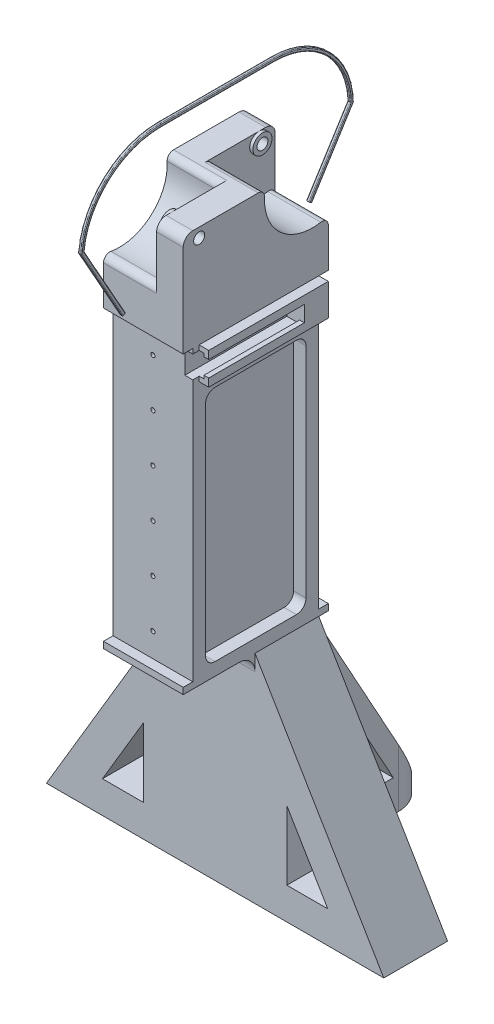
ISO-10303-21;
HEADER;
FILE_DESCRIPTION(('STEP AP214'),'2;1');
FILE_NAME('part.step','',(''),(''),'','','');
FILE_SCHEMA(('AUTOMOTIVE_DESIGN { 1 0 10303 214 1 1 1 1 }'));
ENDSEC;
DATA;
#1=APPLICATION_CONTEXT('core data for automotive mechanical design processes');
#2=APPLICATION_PROTOCOL_DEFINITION('international standard','automotive_design',2000,#1);
#3=PRODUCT_CONTEXT('',#1,'mechanical');
#4=PRODUCT('Part','Part','',(#3));
#5=PRODUCT_RELATED_PRODUCT_CATEGORY('part','',(#4));
#6=PRODUCT_DEFINITION_FORMATION('','',#4);
#7=PRODUCT_DEFINITION_CONTEXT('part definition',#1,'design');
#8=PRODUCT_DEFINITION('design','',#6,#7);
#9=PRODUCT_DEFINITION_SHAPE('','',#8);
#10=(LENGTH_UNIT() NAMED_UNIT(*) SI_UNIT(.MILLI.,.METRE.));
#11=(NAMED_UNIT(*) PLANE_ANGLE_UNIT() SI_UNIT($,.RADIAN.));
#12=(NAMED_UNIT(*) SI_UNIT($,.STERADIAN.) SOLID_ANGLE_UNIT());
#13=UNCERTAINTY_MEASURE_WITH_UNIT(LENGTH_MEASURE(1.E-05),#10,'distance_accuracy_value','');
#14=(GEOMETRIC_REPRESENTATION_CONTEXT(3) GLOBAL_UNCERTAINTY_ASSIGNED_CONTEXT((#13)) GLOBAL_UNIT_ASSIGNED_CONTEXT((#10,
#11,#12)) REPRESENTATION_CONTEXT('',''));
#15=CARTESIAN_POINT('',(0.,0.,0.));
#16=DIRECTION('',(0.,0.,1.));
#17=DIRECTION('',(1.,0.,0.));
#18=AXIS2_PLACEMENT_3D('',#15,#16,#17);
#19=CARTESIAN_POINT('',(-0.5,190.692400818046,-89.6089910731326));
#20=DIRECTION('',(0.,0.531860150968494,0.846832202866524));
#21=DIRECTION('',(0.,-0.846832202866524,0.531860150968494));
#22=AXIS2_PLACEMENT_3D('',#19,#20,#21);
#23=PLANE('',#22);
#24=DIRECTION('',(1.,0.,0.));
#25=VECTOR('',#24,1.);
#26=CARTESIAN_POINT('',(-0.5,169.925229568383,-76.5659929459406));
#27=LINE('',#26,#25);
#28=CARTESIAN_POINT('',(-0.25,169.925229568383,-76.5659929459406));
#29=VERTEX_POINT('',#28);
#30=CARTESIAN_POINT('',(0.25,169.925229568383,-76.5659929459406));
#31=VERTEX_POINT('',#30);
#32=EDGE_CURVE('E311',#29,#31,#27,.T.);
#33=ORIENTED_EDGE('',*,*,#32,.T.);
#34=DIRECTION('',(0.,-0.846832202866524,0.531860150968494));
#35=VECTOR('',#34,1.);
#36=CARTESIAN_POINT('',(0.25,190.692400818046,-89.6089910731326));
#37=LINE('',#36,#35);
#38=CARTESIAN_POINT('',(0.25,190.561027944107,-89.5264812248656));
#39=VERTEX_POINT('',#38);
#40=EDGE_CURVE('E381',#31,#39,#37,.F.);
#41=ORIENTED_EDGE('',*,*,#40,.T.);
#42=DIRECTION('',(1.,0.,0.));
#43=VECTOR('',#42,1.);
#44=CARTESIAN_POINT('',(-0.5,190.561027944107,-89.5264812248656));
#45=LINE('',#44,#43);
#46=CARTESIAN_POINT('',(-0.25,190.561027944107,-89.5264812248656));
#47=VERTEX_POINT('',#46);
#48=EDGE_CURVE('E312',#47,#39,#45,.T.);
#49=ORIENTED_EDGE('',*,*,#48,.F.);
#50=DIRECTION('',(0.,-0.846832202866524,0.531860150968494));
#51=VECTOR('',#50,1.);
#52=CARTESIAN_POINT('',(-0.25,169.925229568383,-76.5659929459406));
#53=LINE('',#52,#51);
#54=EDGE_CURVE('E379',#47,#29,#53,.T.);
#55=ORIENTED_EDGE('',*,*,#54,.T.);
#56=EDGE_LOOP('',(#33,#41,#49,#55));
#57=FACE_BOUND('',#56,.T.);
#58=ADVANCED_FACE('F83',(#57),#23,.T.);
#59=CARTESIAN_POINT('',(-0.5,189.5,-65.4900000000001));
#60=DIRECTION('',(1.,0.,0.));
#61=DIRECTION('',(0.,0.,-1.));
#62=AXIS2_PLACEMENT_3D('',#59,#60,#61);
#63=CYLINDRICAL_SURFACE('',#62,24.0598879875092);
#64=DIRECTION('',(1.,0.,0.));
#65=VECTOR('',#64,1.);
#66=CARTESIAN_POINT('',(-0.5,213.559887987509,-65.4900000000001));
#67=LINE('',#66,#65);
#68=CARTESIAN_POINT('',(-0.25,213.559887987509,-65.4900000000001));
#69=VERTEX_POINT('',#68);
#70=CARTESIAN_POINT('',(0.25,213.559887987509,-65.4900000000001));
#71=VERTEX_POINT('',#70);
#72=EDGE_CURVE('E316',#69,#71,#67,.T.);
#73=ORIENTED_EDGE('',*,*,#72,.F.);
#74=CARTESIAN_POINT('',(-0.25,189.5,-65.4900000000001));
#75=DIRECTION('',(1.,0.,0.));
#76=DIRECTION('',(0.,0.,-1.));
#77=AXIS2_PLACEMENT_3D('',#74,#75,#76);
#78=CIRCLE('',#77,24.0598879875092);
#79=EDGE_CURVE('E413',#69,#47,#78,.F.);
#80=ORIENTED_EDGE('',*,*,#79,.T.);
#81=ORIENTED_EDGE('',*,*,#48,.T.);
#82=CARTESIAN_POINT('',(0.25,189.5,-65.4900000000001));
#83=DIRECTION('',(1.,0.,0.));
#84=DIRECTION('',(0.,0.,-1.));
#85=AXIS2_PLACEMENT_3D('',#82,#83,#84);
#86=CIRCLE('',#85,24.0598879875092);
#87=EDGE_CURVE('E411',#39,#71,#86,.T.);
#88=ORIENTED_EDGE('',*,*,#87,.T.);
#89=EDGE_LOOP('',(#73,#80,#81,#88));
#90=FACE_BOUND('',#89,.T.);
#91=ADVANCED_FACE('F555',(#90),#63,.F.);
#92=CARTESIAN_POINT('',(-0.5,213.559887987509,-29.987));
#93=DIRECTION('',(0.,-1.,0.));
#94=DIRECTION('',(0.,0.,-1.));
#95=AXIS2_PLACEMENT_3D('',#92,#93,#94);
#96=PLANE('',#95);
#97=DIRECTION('',(1.,0.,0.));
#98=VECTOR('',#97,1.);
#99=CARTESIAN_POINT('',(-0.5,213.559887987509,-29.987));
#100=LINE('',#99,#98);
#101=CARTESIAN_POINT('',(-0.25,213.559887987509,-29.987));
#102=VERTEX_POINT('',#101);
#103=CARTESIAN_POINT('',(0.25,213.559887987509,-29.987));
#104=VERTEX_POINT('',#103);
#105=EDGE_CURVE('E319',#102,#104,#100,.T.);
#106=ORIENTED_EDGE('',*,*,#105,.F.);
#107=DIRECTION('',(0.,0.,-1.));
#108=VECTOR('',#107,1.);
#109=CARTESIAN_POINT('',(-0.25,213.559887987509,-65.4900000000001));
#110=LINE('',#109,#108);
#111=EDGE_CURVE('E425',#102,#69,#110,.T.);
#112=ORIENTED_EDGE('',*,*,#111,.T.);
#113=ORIENTED_EDGE('',*,*,#72,.T.);
#114=DIRECTION('',(0.,0.,-1.));
#115=VECTOR('',#114,1.);
#116=CARTESIAN_POINT('',(0.25,213.559887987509,-29.987));
#117=LINE('',#116,#115);
#118=EDGE_CURVE('E423',#71,#104,#117,.F.);
#119=ORIENTED_EDGE('',*,*,#118,.T.);
#120=EDGE_LOOP('',(#106,#112,#113,#119));
#121=FACE_BOUND('',#120,.T.);
#122=ADVANCED_FACE('F561',(#121),#96,.T.);
#123=CARTESIAN_POINT('',(-0.5,189.5,-29.987));
#124=DIRECTION('',(1.,0.,0.));
#125=DIRECTION('',(0.,0.,-1.));
#126=AXIS2_PLACEMENT_3D('',#123,#124,#125);
#127=CYLINDRICAL_SURFACE('',#126,24.0598879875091);
#128=DIRECTION('',(1.,0.,0.));
#129=VECTOR('',#128,1.);
#130=CARTESIAN_POINT('',(-0.5,191.77805132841,-6.03520064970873));
#131=LINE('',#130,#129);
#132=CARTESIAN_POINT('',(0.25,191.77805132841,-6.03520064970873));
#133=VERTEX_POINT('',#132);
#134=CARTESIAN_POINT('',(-0.25,191.77805132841,-6.03520064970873));
#135=VERTEX_POINT('',#134);
#136=EDGE_CURVE('E367',#133,#135,#131,.F.);
#137=ORIENTED_EDGE('',*,*,#136,.T.);
#138=CARTESIAN_POINT('',(-0.25,189.5,-29.987));
#139=DIRECTION('',(1.,0.,0.));
#140=DIRECTION('',(0.,0.,-1.));
#141=AXIS2_PLACEMENT_3D('',#138,#139,#140);
#142=CIRCLE('',#141,24.0598879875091);
#143=EDGE_CURVE('E369',#135,#102,#142,.F.);
#144=ORIENTED_EDGE('',*,*,#143,.T.);
#145=ORIENTED_EDGE('',*,*,#105,.T.);
#146=CARTESIAN_POINT('',(0.25,189.5,-29.987));
#147=DIRECTION('',(1.,0.,0.));
#148=DIRECTION('',(0.,0.,-1.));
#149=AXIS2_PLACEMENT_3D('',#146,#147,#148);
#150=CIRCLE('',#149,24.0598879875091);
#151=EDGE_CURVE('E283',#104,#133,#150,.T.);
#152=ORIENTED_EDGE('',*,*,#151,.T.);
#153=EDGE_LOOP('',(#137,#144,#145,#152));
#154=FACE_BOUND('',#153,.T.);
#155=ADVANCED_FACE('F716',(#154),#127,.F.);
#156=CARTESIAN_POINT('',(-0.5,168.741152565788,-18.9229442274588));
#157=DIRECTION('',(0.,0.489704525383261,-0.871888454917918));
#158=DIRECTION('',(0.,0.871888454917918,0.489704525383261));
#159=AXIS2_PLACEMENT_3D('',#156,#157,#158);
#160=PLANE('',#159);
#161=DIRECTION('',(0.,0.871888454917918,0.489704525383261));
#162=VECTOR('',#161,1.);
#163=CARTESIAN_POINT('',(0.25,168.741152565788,-18.9229442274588));
#164=LINE('',#163,#162);
#165=CARTESIAN_POINT('',(0.25,191.631954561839,-6.06610541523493));
#166=VERTEX_POINT('',#165);
#167=CARTESIAN_POINT('',(0.25,168.959124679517,-18.800518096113));
#168=VERTEX_POINT('',#167);
#169=EDGE_CURVE('E345',#166,#168,#164,.F.);
#170=ORIENTED_EDGE('',*,*,#169,.T.);
#171=DIRECTION('',(1.,0.,0.));
#172=VECTOR('',#171,1.);
#173=CARTESIAN_POINT('',(-0.5,168.959124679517,-18.800518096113));
#174=LINE('',#173,#172);
#175=CARTESIAN_POINT('',(-0.25,168.959124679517,-18.800518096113));
#176=VERTEX_POINT('',#175);
#177=EDGE_CURVE('E269',#168,#176,#174,.F.);
#178=ORIENTED_EDGE('',*,*,#177,.T.);
#179=DIRECTION('',(0.,0.871888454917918,0.489704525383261));
#180=VECTOR('',#179,1.);
#181=CARTESIAN_POINT('',(-0.25,191.699971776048,-6.02790289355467));
#182=LINE('',#181,#180);
#183=CARTESIAN_POINT('',(-0.25,191.631954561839,-6.06610541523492));
#184=VERTEX_POINT('',#183);
#185=EDGE_CURVE('E295',#176,#184,#182,.T.);
#186=ORIENTED_EDGE('',*,*,#185,.T.);
#187=DIRECTION('',(-1.,0.,0.));
#188=VECTOR('',#187,1.);
#189=CARTESIAN_POINT('',(0.5,191.631954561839,-6.06610541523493));
#190=LINE('',#189,#188);
#191=EDGE_CURVE('E343',#184,#166,#190,.F.);
#192=ORIENTED_EDGE('',*,*,#191,.T.);
#193=EDGE_LOOP('',(#170,#178,#186,#192));
#194=FACE_BOUND('',#193,.T.);
#195=ADVANCED_FACE('F671',(#194),#160,.T.);
#196=CARTESIAN_POINT('',(-0.5,168.741152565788,-18.9229442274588));
#197=DIRECTION('',(0.,0.871888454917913,0.48970452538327));
#198=DIRECTION('',(0.,-0.48970452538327,0.871888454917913));
#199=AXIS2_PLACEMENT_3D('',#196,#197,#198);
#200=PLANE('',#199);
#201=DIRECTION('',(0.,-0.48970452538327,0.871888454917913));
#202=VECTOR('',#201,1.);
#203=CARTESIAN_POINT('',(-0.5,168.741152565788,-18.9229442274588));
#204=LINE('',#203,#202);
#205=CARTESIAN_POINT('',(-0.5,168.618726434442,-18.7049721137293));
#206=VERTEX_POINT('',#205);
#207=CARTESIAN_POINT('',(-0.5,168.37387417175,-18.2690278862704));
#208=VERTEX_POINT('',#207);
#209=EDGE_CURVE('E293',#206,#208,#204,.T.);
#210=ORIENTED_EDGE('',*,*,#209,.F.);
#211=DIRECTION('',(1.,0.,0.));
#212=VECTOR('',#211,1.);
#213=CARTESIAN_POINT('',(0.5,168.618726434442,-18.7049721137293));
#214=LINE('',#213,#212);
#215=CARTESIAN_POINT('',(0.5,168.618726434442,-18.7049721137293));
#216=VERTEX_POINT('',#215);
#217=EDGE_CURVE('E267',#206,#216,#214,.T.);
#218=ORIENTED_EDGE('',*,*,#217,.T.);
#219=DIRECTION('',(0.,-0.48970452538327,0.871888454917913));
#220=VECTOR('',#219,1.);
#221=CARTESIAN_POINT('',(0.5,168.741152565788,-18.9229442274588));
#222=LINE('',#221,#220);
#223=CARTESIAN_POINT('',(0.5,168.37387417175,-18.2690278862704));
#224=VERTEX_POINT('',#223);
#225=EDGE_CURVE('E290',#216,#224,#222,.T.);
#226=ORIENTED_EDGE('',*,*,#225,.T.);
#227=CARTESIAN_POINT('',(0.25,168.37387417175,-18.2690278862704));
#228=DIRECTION('',(0.,0.871888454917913,0.48970452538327));
#229=DIRECTION('',(0.,-0.48970452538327,0.871888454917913));
#230=AXIS2_PLACEMENT_3D('',#227,#228,#229);
#231=CIRCLE('',#230,0.25);
#232=CARTESIAN_POINT('',(0.25,168.251448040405,-18.0510557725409));
#233=VERTEX_POINT('',#232);
#234=EDGE_CURVE('E315',#224,#233,#231,.F.);
#235=ORIENTED_EDGE('',*,*,#234,.T.);
#236=DIRECTION('',(1.,0.,0.));
#237=VECTOR('',#236,1.);
#238=CARTESIAN_POINT('',(-0.5,168.251448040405,-18.0510557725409));
#239=LINE('',#238,#237);
#240=CARTESIAN_POINT('',(-0.25,168.251448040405,-18.0510557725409));
#241=VERTEX_POINT('',#240);
#242=EDGE_CURVE('E322',#241,#233,#239,.T.);
#243=ORIENTED_EDGE('',*,*,#242,.F.);
#244=CARTESIAN_POINT('',(-0.25,168.37387417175,-18.2690278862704));
#245=DIRECTION('',(0.,0.871888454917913,0.48970452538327));
#246=DIRECTION('',(0.,-0.48970452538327,0.871888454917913));
#247=AXIS2_PLACEMENT_3D('',#244,#245,#246);
#248=CIRCLE('',#247,0.25);
#249=EDGE_CURVE('E296',#241,#208,#248,.F.);
#250=ORIENTED_EDGE('',*,*,#249,.T.);
#251=EDGE_LOOP('',(#210,#218,#226,#235,#243,#250));
#252=FACE_BOUND('',#251,.T.);
#253=ADVANCED_FACE('F289',(#252),#200,.F.);
#254=CARTESIAN_POINT('',(-0.5,168.251448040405,-18.0510557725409));
#255=DIRECTION('',(0.,0.489704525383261,-0.871888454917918));
#256=DIRECTION('',(0.,0.871888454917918,0.489704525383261));
#257=AXIS2_PLACEMENT_3D('',#254,#255,#256);
#258=PLANE('',#257);
#259=DIRECTION('',(1.,0.,0.));
#260=VECTOR('',#259,1.);
#261=CARTESIAN_POINT('',(-0.5,191.478535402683,-5.00533905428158));
#262=LINE('',#261,#260);
#263=CARTESIAN_POINT('',(-0.25,191.478535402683,-5.00533905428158));
#264=VERTEX_POINT('',#263);
#265=CARTESIAN_POINT('',(0.25,191.478535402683,-5.00533905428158));
#266=VERTEX_POINT('',#265);
#267=EDGE_CURVE('E325',#264,#266,#262,.T.);
#268=ORIENTED_EDGE('',*,*,#267,.F.);
#269=DIRECTION('',(0.,0.871888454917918,0.489704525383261));
#270=VECTOR('',#269,1.);
#271=CARTESIAN_POINT('',(-0.25,168.251448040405,-18.0510557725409));
#272=LINE('',#271,#270);
#273=EDGE_CURVE('E429',#264,#241,#272,.F.);
#274=ORIENTED_EDGE('',*,*,#273,.T.);
#275=ORIENTED_EDGE('',*,*,#242,.T.);
#276=DIRECTION('',(0.,0.871888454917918,0.489704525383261));
#277=VECTOR('',#276,1.);
#278=CARTESIAN_POINT('',(0.25,191.478535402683,-5.00533905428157));
#279=LINE('',#278,#277);
#280=EDGE_CURVE('E427',#233,#266,#279,.T.);
#281=ORIENTED_EDGE('',*,*,#280,.T.);
#282=EDGE_LOOP('',(#268,#274,#275,#281));
#283=FACE_BOUND('',#282,.T.);
#284=ADVANCED_FACE('F656',(#283),#258,.F.);
#285=CARTESIAN_POINT('',(-0.5,189.5,-29.987));
#286=DIRECTION('',(1.,0.,0.));
#287=DIRECTION('',(0.,0.,-1.));
#288=AXIS2_PLACEMENT_3D('',#285,#286,#287);
#289=CYLINDRICAL_SURFACE('',#288,25.0598879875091);
#290=DIRECTION('',(1.,0.,0.));
#291=VECTOR('',#290,1.);
#292=CARTESIAN_POINT('',(-0.5,214.559887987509,-29.987));
#293=LINE('',#292,#291);
#294=CARTESIAN_POINT('',(-0.25,214.559887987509,-29.987));
#295=VERTEX_POINT('',#294);
#296=CARTESIAN_POINT('',(0.25,214.559887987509,-29.987));
#297=VERTEX_POINT('',#296);
#298=EDGE_CURVE('E327',#295,#297,#293,.T.);
#299=ORIENTED_EDGE('',*,*,#298,.F.);
#300=CARTESIAN_POINT('',(-0.25,189.5,-29.987));
#301=DIRECTION('',(1.,0.,0.));
#302=DIRECTION('',(0.,0.,-1.));
#303=AXIS2_PLACEMENT_3D('',#300,#301,#302);
#304=CIRCLE('',#303,25.0598879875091);
#305=EDGE_CURVE('E421',#295,#264,#304,.T.);
#306=ORIENTED_EDGE('',*,*,#305,.T.);
#307=ORIENTED_EDGE('',*,*,#267,.T.);
#308=CARTESIAN_POINT('',(0.25,189.5,-29.987));
#309=DIRECTION('',(1.,0.,0.));
#310=DIRECTION('',(0.,0.,-1.));
#311=AXIS2_PLACEMENT_3D('',#308,#309,#310);
#312=CIRCLE('',#311,25.0598879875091);
#313=EDGE_CURVE('E104',#266,#297,#312,.F.);
#314=ORIENTED_EDGE('',*,*,#313,.T.);
#315=EDGE_LOOP('',(#299,#306,#307,#314));
#316=FACE_BOUND('',#315,.T.);
#317=ADVANCED_FACE('F689',(#316),#289,.T.);
#318=CARTESIAN_POINT('',(-0.5,214.559887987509,-29.987));
#319=DIRECTION('',(0.,-1.,0.));
#320=DIRECTION('',(0.,0.,-1.));
#321=AXIS2_PLACEMENT_3D('',#318,#319,#320);
#322=PLANE('',#321);
#323=DIRECTION('',(1.,0.,0.));
#324=VECTOR('',#323,1.);
#325=CARTESIAN_POINT('',(-0.5,214.559887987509,-65.4900000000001));
#326=LINE('',#325,#324);
#327=CARTESIAN_POINT('',(-0.25,214.559887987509,-65.4900000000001));
#328=VERTEX_POINT('',#327);
#329=CARTESIAN_POINT('',(0.25,214.559887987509,-65.4900000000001));
#330=VERTEX_POINT('',#329);
#331=EDGE_CURVE('E329',#328,#330,#326,.T.);
#332=ORIENTED_EDGE('',*,*,#331,.F.);
#333=DIRECTION('',(0.,0.,-1.));
#334=VECTOR('',#333,1.);
#335=CARTESIAN_POINT('',(-0.25,214.559887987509,-29.987));
#336=LINE('',#335,#334);
#337=EDGE_CURVE('E13',#328,#295,#336,.F.);
#338=ORIENTED_EDGE('',*,*,#337,.T.);
#339=ORIENTED_EDGE('',*,*,#298,.T.);
#340=DIRECTION('',(0.,0.,-1.));
#341=VECTOR('',#340,1.);
#342=CARTESIAN_POINT('',(0.25,214.559887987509,-65.4900000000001));
#343=LINE('',#342,#341);
#344=EDGE_CURVE('E96',#297,#330,#343,.T.);
#345=ORIENTED_EDGE('',*,*,#344,.T.);
#346=EDGE_LOOP('',(#332,#338,#339,#345));
#347=FACE_BOUND('',#346,.T.);
#348=ADVANCED_FACE('F688',(#347),#322,.F.);
#349=CARTESIAN_POINT('',(-0.5,189.5,-65.4900000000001));
#350=DIRECTION('',(1.,0.,0.));
#351=DIRECTION('',(0.,0.,-1.));
#352=AXIS2_PLACEMENT_3D('',#349,#350,#351);
#353=CYLINDRICAL_SURFACE('',#352,25.0598879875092);
#354=DIRECTION('',(1.,0.,0.));
#355=VECTOR('',#354,1.);
#356=CARTESIAN_POINT('',(-0.5,190.290456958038,-90.5374183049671));
#357=LINE('',#356,#355);
#358=CARTESIAN_POINT('',(-0.25,190.290456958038,-90.5374183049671));
#359=VERTEX_POINT('',#358);
#360=CARTESIAN_POINT('',(0.25,190.290456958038,-90.5374183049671));
#361=VERTEX_POINT('',#360);
#362=EDGE_CURVE('E332',#359,#361,#357,.T.);
#363=ORIENTED_EDGE('',*,*,#362,.F.);
#364=CARTESIAN_POINT('',(-0.25,189.5,-65.4900000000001));
#365=DIRECTION('',(1.,0.,0.));
#366=DIRECTION('',(0.,0.,-1.));
#367=AXIS2_PLACEMENT_3D('',#364,#365,#366);
#368=CIRCLE('',#367,25.0598879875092);
#369=EDGE_CURVE('E418',#359,#328,#368,.T.);
#370=ORIENTED_EDGE('',*,*,#369,.T.);
#371=ORIENTED_EDGE('',*,*,#331,.T.);
#372=CARTESIAN_POINT('',(0.25,189.5,-65.4900000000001));
#373=DIRECTION('',(1.,0.,0.));
#374=DIRECTION('',(0.,0.,-1.));
#375=AXIS2_PLACEMENT_3D('',#372,#373,#374);
#376=CIRCLE('',#375,25.0598879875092);
#377=EDGE_CURVE('E415',#330,#361,#376,.F.);
#378=ORIENTED_EDGE('',*,*,#377,.T.);
#379=EDGE_LOOP('',(#363,#370,#371,#378));
#380=FACE_BOUND('',#379,.T.);
#381=ADVANCED_FACE('F638',(#380),#353,.T.);
#382=CARTESIAN_POINT('',(-0.5,190.160540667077,-90.4558232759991));
#383=DIRECTION('',(0.,0.531860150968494,0.846832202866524));
#384=DIRECTION('',(0.,-0.846832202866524,0.531860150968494));
#385=AXIS2_PLACEMENT_3D('',#382,#383,#384);
#386=PLANE('',#385);
#387=DIRECTION('',(1.,0.,0.));
#388=VECTOR('',#387,1.);
#389=CARTESIAN_POINT('',(-0.5,169.393369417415,-77.4128251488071));
#390=LINE('',#389,#388);
#391=CARTESIAN_POINT('',(-0.25,169.393369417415,-77.4128251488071));
#392=VERTEX_POINT('',#391);
#393=CARTESIAN_POINT('',(0.25,169.393369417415,-77.4128251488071));
#394=VERTEX_POINT('',#393);
#395=EDGE_CURVE('E335',#392,#394,#390,.T.);
#396=ORIENTED_EDGE('',*,*,#395,.F.);
#397=DIRECTION('',(0.,-0.846832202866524,0.531860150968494));
#398=VECTOR('',#397,1.);
#399=CARTESIAN_POINT('',(-0.25,190.160540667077,-90.4558232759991));
#400=LINE('',#399,#398);
#401=EDGE_CURVE('E409',#392,#359,#400,.F.);
#402=ORIENTED_EDGE('',*,*,#401,.T.);
#403=ORIENTED_EDGE('',*,*,#362,.T.);
#404=DIRECTION('',(0.,-0.846832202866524,0.531860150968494));
#405=VECTOR('',#404,1.);
#406=CARTESIAN_POINT('',(0.25,169.393369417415,-77.4128251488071));
#407=LINE('',#406,#405);
#408=EDGE_CURVE('E407',#361,#394,#407,.T.);
#409=ORIENTED_EDGE('',*,*,#408,.T.);
#410=EDGE_LOOP('',(#396,#402,#403,#409));
#411=FACE_BOUND('',#410,.T.);
#412=ADVANCED_FACE('F631',(#411),#386,.F.);
#413=CARTESIAN_POINT('',(-0.5,169.393369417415,-77.4128251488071));
#414=DIRECTION('',(0.,0.846832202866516,-0.531860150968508));
#415=DIRECTION('',(0.,0.531860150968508,0.846832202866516));
#416=AXIS2_PLACEMENT_3D('',#413,#414,#415);
#417=PLANE('',#416);
#418=DIRECTION('',(0.,0.531860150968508,0.846832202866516));
#419=VECTOR('',#418,1.);
#420=CARTESIAN_POINT('',(0.5,169.393369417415,-77.4128251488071));
#421=LINE('',#420,#419);
#422=CARTESIAN_POINT('',(0.5,169.526334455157,-77.2011170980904));
#423=VERTEX_POINT('',#422);
#424=CARTESIAN_POINT('',(0.5,169.792264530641,-76.7777009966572));
#425=VERTEX_POINT('',#424);
#426=EDGE_CURVE('E302',#423,#425,#421,.T.);
#427=ORIENTED_EDGE('',*,*,#426,.T.);
#428=CARTESIAN_POINT('',(0.25,169.792264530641,-76.7777009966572));
#429=DIRECTION('',(0.,0.846832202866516,-0.531860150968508));
#430=DIRECTION('',(0.,0.531860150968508,0.846832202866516));
#431=AXIS2_PLACEMENT_3D('',#428,#429,#430);
#432=CIRCLE('',#431,0.25);
#433=EDGE_CURVE('E377',#425,#31,#432,.F.);
#434=ORIENTED_EDGE('',*,*,#433,.T.);
#435=ORIENTED_EDGE('',*,*,#32,.F.);
#436=CARTESIAN_POINT('',(-0.25,169.792264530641,-76.7777009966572));
#437=DIRECTION('',(0.,0.846832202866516,-0.531860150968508));
#438=DIRECTION('',(0.,0.531860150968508,0.846832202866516));
#439=AXIS2_PLACEMENT_3D('',#436,#437,#438);
#440=CIRCLE('',#439,0.25);
#441=CARTESIAN_POINT('',(-0.5,169.792264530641,-76.7777009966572));
#442=VERTEX_POINT('',#441);
#443=EDGE_CURVE('E373',#29,#442,#440,.F.);
#444=ORIENTED_EDGE('',*,*,#443,.T.);
#445=DIRECTION('',(0.,0.531860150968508,0.846832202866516));
#446=VECTOR('',#445,1.);
#447=CARTESIAN_POINT('',(-0.5,169.393369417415,-77.4128251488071));
#448=LINE('',#447,#446);
#449=CARTESIAN_POINT('',(-0.5,169.526334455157,-77.2011170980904));
#450=VERTEX_POINT('',#449);
#451=EDGE_CURVE('E301',#450,#442,#448,.T.);
#452=ORIENTED_EDGE('',*,*,#451,.F.);
#453=CARTESIAN_POINT('',(-0.25,169.526334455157,-77.2011170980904));
#454=DIRECTION('',(0.,0.846832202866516,-0.531860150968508));
#455=DIRECTION('',(0.,0.531860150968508,0.846832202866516));
#456=AXIS2_PLACEMENT_3D('',#453,#454,#455);
#457=CIRCLE('',#456,0.25);
#458=EDGE_CURVE('E375',#450,#392,#457,.F.);
#459=ORIENTED_EDGE('',*,*,#458,.T.);
#460=ORIENTED_EDGE('',*,*,#395,.T.);
#461=CARTESIAN_POINT('',(0.25,169.526334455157,-77.2011170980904));
#462=DIRECTION('',(0.,0.846832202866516,-0.531860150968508));
#463=DIRECTION('',(0.,0.531860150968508,0.846832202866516));
#464=AXIS2_PLACEMENT_3D('',#461,#462,#463);
#465=CIRCLE('',#464,0.25);
#466=EDGE_CURVE('E371',#394,#423,#465,.F.);
#467=ORIENTED_EDGE('',*,*,#466,.T.);
#468=EDGE_LOOP('',(#427,#434,#435,#444,#452,#459,#460,#467));
#469=FACE_BOUND('',#468,.T.);
#470=ADVANCED_FACE('F566',(#469),#417,.F.);
#471=CARTESIAN_POINT('',(-0.5,189.5,-65.4900000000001));
#472=DIRECTION('',(1.,0.,0.));
#473=DIRECTION('',(0.,0.,-1.));
#474=AXIS2_PLACEMENT_3D('',#471,#472,#473);
#475=PLANE('',#474);
#476=ORIENTED_EDGE('',*,*,#451,.T.);
#477=DIRECTION('',(0.,-0.846832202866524,0.531860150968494));
#478=VECTOR('',#477,1.);
#479=CARTESIAN_POINT('',(-0.5,190.428062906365,-89.7381892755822));
#480=LINE('',#479,#478);
#481=CARTESIAN_POINT('',(-0.5,190.493934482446,-89.779560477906));
#482=VERTEX_POINT('',#481);
#483=EDGE_CURVE('E405',#442,#482,#480,.F.);
#484=ORIENTED_EDGE('',*,*,#483,.T.);
#485=CARTESIAN_POINT('',(-0.5,189.5,-65.4900000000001));
#486=DIRECTION('',(1.,0.,0.));
#487=DIRECTION('',(0.,0.,-1.));
#488=AXIS2_PLACEMENT_3D('',#485,#486,#487);
#489=CIRCLE('',#488,24.3098879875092);
#490=CARTESIAN_POINT('',(-0.5,213.809887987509,-65.4900000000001));
#491=VERTEX_POINT('',#490);
#492=EDGE_CURVE('E403',#482,#491,#489,.T.);
#493=ORIENTED_EDGE('',*,*,#492,.T.);
#494=DIRECTION('',(0.,0.,-1.));
#495=VECTOR('',#494,1.);
#496=CARTESIAN_POINT('',(-0.5,213.809887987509,-29.987));
#497=LINE('',#496,#495);
#498=CARTESIAN_POINT('',(-0.5,213.809887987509,-29.987));
#499=VERTEX_POINT('',#498);
#500=EDGE_CURVE('E401',#491,#499,#497,.F.);
#501=ORIENTED_EDGE('',*,*,#500,.T.);
#502=CARTESIAN_POINT('',(-0.5,189.5,-29.987));
#503=DIRECTION('',(1.,0.,0.));
#504=DIRECTION('',(0.,0.,-1.));
#505=AXIS2_PLACEMENT_3D('',#502,#503,#504);
#506=CIRCLE('',#505,24.3098879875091);
#507=CARTESIAN_POINT('',(-0.5,191.801721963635,-5.78632377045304));
#508=VERTEX_POINT('',#507);
#509=EDGE_CURVE('E399',#499,#508,#506,.T.);
#510=ORIENTED_EDGE('',*,*,#509,.T.);
#511=CARTESIAN_POINT('',(-0.5,191.754380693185,-6.28407752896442));
#512=DIRECTION('',(1.,0.,0.));
#513=DIRECTION('',(0.,0.,-1.));
#514=AXIS2_PLACEMENT_3D('',#511,#512,#513);
#515=CIRCLE('',#514,0.5);
#516=CARTESIAN_POINT('',(-0.5,191.509528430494,-5.84813330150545));
#517=VERTEX_POINT('',#516);
#518=EDGE_CURVE('E396',#517,#508,#515,.F.);
#519=ORIENTED_EDGE('',*,*,#518,.F.);
#520=DIRECTION('',(0.,0.871888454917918,0.489704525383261));
#521=VECTOR('',#520,1.);
#522=CARTESIAN_POINT('',(-0.5,168.618726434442,-18.7049721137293));
#523=LINE('',#522,#521);
#524=EDGE_CURVE('E394',#517,#206,#523,.F.);
#525=ORIENTED_EDGE('',*,*,#524,.T.);
#526=ORIENTED_EDGE('',*,*,#209,.T.);
#527=DIRECTION('',(0.,0.871888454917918,0.489704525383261));
#528=VECTOR('',#527,1.);
#529=CARTESIAN_POINT('',(-0.5,164.271901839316,-20.5729400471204));
#530=LINE('',#529,#528);
#531=CARTESIAN_POINT('',(-0.5,191.534451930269,-5.26066692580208));
#532=VERTEX_POINT('',#531);
#533=EDGE_CURVE('E392',#208,#532,#530,.T.);
#534=ORIENTED_EDGE('',*,*,#533,.T.);
#535=CARTESIAN_POINT('',(-0.5,189.5,-29.987));
#536=DIRECTION('',(1.,0.,0.));
#537=DIRECTION('',(0.,0.,-1.));
#538=AXIS2_PLACEMENT_3D('',#535,#536,#537);
#539=CIRCLE('',#538,24.8098879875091);
#540=CARTESIAN_POINT('',(-0.5,214.309887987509,-29.987));
#541=VERTEX_POINT('',#540);
#542=EDGE_CURVE('E385',#532,#541,#539,.F.);
#543=ORIENTED_EDGE('',*,*,#542,.T.);
#544=DIRECTION('',(0.,0.,-1.));
#545=VECTOR('',#544,1.);
#546=CARTESIAN_POINT('',(-0.5,214.309887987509,-65.4900000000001));
#547=LINE('',#546,#545);
#548=CARTESIAN_POINT('',(-0.5,214.309887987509,-65.4900000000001));
#549=VERTEX_POINT('',#548);
#550=EDGE_CURVE('E383',#541,#549,#547,.T.);
#551=ORIENTED_EDGE('',*,*,#550,.T.);
#552=CARTESIAN_POINT('',(-0.5,189.5,-65.4900000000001));
#553=DIRECTION('',(1.,0.,0.));
#554=DIRECTION('',(0.,0.,-1.));
#555=AXIS2_PLACEMENT_3D('',#552,#553,#554);
#556=CIRCLE('',#555,24.8098879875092);
#557=CARTESIAN_POINT('',(-0.5,190.358642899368,-90.2850251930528));
#558=VERTEX_POINT('',#557);
#559=EDGE_CURVE('E387',#549,#558,#556,.F.);
#560=ORIENTED_EDGE('',*,*,#559,.T.);
#561=DIRECTION('',(0.,-0.846832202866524,0.531860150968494));
#562=VECTOR('',#561,1.);
#563=CARTESIAN_POINT('',(-0.5,178.575301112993,-82.8843973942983));
#564=LINE('',#563,#562);
#565=EDGE_CURVE('E389',#558,#450,#564,.T.);
#566=ORIENTED_EDGE('',*,*,#565,.T.);
#567=EDGE_LOOP('',(#476,#484,#493,#501,#510,#519,#525,#526,#534,#543,#551,#560,#566));
#568=FACE_BOUND('',#567,.T.);
#569=ADVANCED_FACE('F622',(#568),#475,.F.);
#570=CARTESIAN_POINT('',(0.5,189.5,-65.4900000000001));
#571=DIRECTION('',(1.,0.,0.));
#572=DIRECTION('',(0.,0.,-1.));
#573=AXIS2_PLACEMENT_3D('',#570,#571,#572);
#574=PLANE('',#573);
#575=ORIENTED_EDGE('',*,*,#225,.F.);
#576=DIRECTION('',(0.,0.871888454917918,0.489704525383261));
#577=VECTOR('',#576,1.);
#578=CARTESIAN_POINT('',(0.5,164.516754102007,-21.0088842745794));
#579=LINE('',#578,#577);
#580=CARTESIAN_POINT('',(0.5,191.509528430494,-5.84813330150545));
#581=VERTEX_POINT('',#580);
#582=EDGE_CURVE('E276',#216,#581,#579,.T.);
#583=ORIENTED_EDGE('',*,*,#582,.T.);
#584=CARTESIAN_POINT('',(0.5,191.754380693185,-6.28407752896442));
#585=DIRECTION('',(1.,0.,0.));
#586=DIRECTION('',(0.,0.,-1.));
#587=AXIS2_PLACEMENT_3D('',#584,#585,#586);
#588=CIRCLE('',#587,0.5);
#589=CARTESIAN_POINT('',(0.5,191.801721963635,-5.78632377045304));
#590=VERTEX_POINT('',#589);
#591=EDGE_CURVE('E284',#590,#581,#588,.T.);
#592=ORIENTED_EDGE('',*,*,#591,.F.);
#593=CARTESIAN_POINT('',(0.5,189.5,-29.987));
#594=DIRECTION('',(1.,0.,0.));
#595=DIRECTION('',(0.,0.,-1.));
#596=AXIS2_PLACEMENT_3D('',#593,#594,#595);
#597=CIRCLE('',#596,24.3098879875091);
#598=CARTESIAN_POINT('',(0.5,213.809887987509,-29.987));
#599=VERTEX_POINT('',#598);
#600=EDGE_CURVE('E359',#590,#599,#597,.F.);
#601=ORIENTED_EDGE('',*,*,#600,.T.);
#602=DIRECTION('',(0.,0.,-1.));
#603=VECTOR('',#602,1.);
#604=CARTESIAN_POINT('',(0.5,213.809887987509,-65.4900000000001));
#605=LINE('',#604,#603);
#606=CARTESIAN_POINT('',(0.5,213.809887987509,-65.4900000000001));
#607=VERTEX_POINT('',#606);
#608=EDGE_CURVE('E357',#599,#607,#605,.T.);
#609=ORIENTED_EDGE('',*,*,#608,.T.);
#610=CARTESIAN_POINT('',(0.5,189.5,-65.4900000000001));
#611=DIRECTION('',(1.,0.,0.));
#612=DIRECTION('',(0.,0.,-1.));
#613=AXIS2_PLACEMENT_3D('',#610,#611,#612);
#614=CIRCLE('',#613,24.3098879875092);
#615=CARTESIAN_POINT('',(0.5,190.493934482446,-89.779560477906));
#616=VERTEX_POINT('',#615);
#617=EDGE_CURVE('E361',#607,#616,#614,.F.);
#618=ORIENTED_EDGE('',*,*,#617,.T.);
#619=DIRECTION('',(0.,-0.846832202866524,0.531860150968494));
#620=VECTOR('',#619,1.);
#621=CARTESIAN_POINT('',(0.5,178.841231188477,-82.460981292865));
#622=LINE('',#621,#620);
#623=EDGE_CURVE('E363',#616,#425,#622,.T.);
#624=ORIENTED_EDGE('',*,*,#623,.T.);
#625=ORIENTED_EDGE('',*,*,#426,.F.);
#626=DIRECTION('',(0.,-0.846832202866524,0.531860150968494));
#627=VECTOR('',#626,1.);
#628=CARTESIAN_POINT('',(0.5,190.423421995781,-90.3257102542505));
#629=LINE('',#628,#627);
#630=CARTESIAN_POINT('',(0.5,190.358642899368,-90.2850251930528));
#631=VERTEX_POINT('',#630);
#632=EDGE_CURVE('E355',#423,#631,#629,.F.);
#633=ORIENTED_EDGE('',*,*,#632,.T.);
#634=CARTESIAN_POINT('',(0.5,189.5,-65.4900000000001));
#635=DIRECTION('',(1.,0.,0.));
#636=DIRECTION('',(0.,0.,-1.));
#637=AXIS2_PLACEMENT_3D('',#634,#635,#636);
#638=CIRCLE('',#637,24.8098879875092);
#639=CARTESIAN_POINT('',(0.5,214.309887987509,-65.4900000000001));
#640=VERTEX_POINT('',#639);
#641=EDGE_CURVE('E353',#631,#640,#638,.T.);
#642=ORIENTED_EDGE('',*,*,#641,.T.);
#643=DIRECTION('',(0.,0.,-1.));
#644=VECTOR('',#643,1.);
#645=CARTESIAN_POINT('',(0.5,214.309887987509,-29.987));
#646=LINE('',#645,#644);
#647=CARTESIAN_POINT('',(0.5,214.309887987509,-29.987));
#648=VERTEX_POINT('',#647);
#649=EDGE_CURVE('E351',#640,#648,#646,.F.);
#650=ORIENTED_EDGE('',*,*,#649,.T.);
#651=CARTESIAN_POINT('',(0.5,189.5,-29.987));
#652=DIRECTION('',(1.,0.,0.));
#653=DIRECTION('',(0.,0.,-1.));
#654=AXIS2_PLACEMENT_3D('',#651,#652,#653);
#655=CIRCLE('',#654,24.8098879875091);
#656=CARTESIAN_POINT('',(0.5,191.534451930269,-5.26066692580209));
#657=VERTEX_POINT('',#656);
#658=EDGE_CURVE('E349',#648,#657,#655,.T.);
#659=ORIENTED_EDGE('',*,*,#658,.T.);
#660=DIRECTION('',(0.,0.871888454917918,0.489704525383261));
#661=VECTOR('',#660,1.);
#662=CARTESIAN_POINT('',(0.5,168.37387417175,-18.2690278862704));
#663=LINE('',#662,#661);
#664=EDGE_CURVE('E300',#657,#224,#663,.F.);
#665=ORIENTED_EDGE('',*,*,#664,.T.);
#666=EDGE_LOOP('',(#575,#583,#592,#601,#609,#618,#624,#625,#633,#642,#650,#659,#665));
#667=FACE_BOUND('',#666,.T.);
#668=ADVANCED_FACE('F298',(#667),#574,.T.);
#669=CARTESIAN_POINT('',(-0.25,190.559435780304,-89.8206991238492));
#670=DIRECTION('',(0.,0.846832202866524,-0.531860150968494));
#671=DIRECTION('',(0.,0.531860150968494,0.846832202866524));
#672=AXIS2_PLACEMENT_3D('',#669,#670,#671);
#673=CYLINDRICAL_SURFACE('',#672,0.25);
#674=ORIENTED_EDGE('',*,*,#443,.F.);
#675=ORIENTED_EDGE('',*,*,#54,.F.);
#676=CARTESIAN_POINT('',(-0.25,190.561027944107,-89.5264812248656));
#677=CARTESIAN_POINT('',(-0.263604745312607,190.561031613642,-89.5264671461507));
#678=CARTESIAN_POINT('',(-0.277202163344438,190.560730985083,-89.5276050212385));
#679=CARTESIAN_POINT('',(-0.303978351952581,190.559549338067,-89.5320765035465));
#680=CARTESIAN_POINT('',(-0.31715790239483,190.558669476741,-89.5354057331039));
#681=CARTESIAN_POINT('',(-0.342751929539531,190.556357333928,-89.5441526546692));
#682=CARTESIAN_POINT('',(-0.355166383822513,190.554925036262,-89.5495704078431));
#683=CARTESIAN_POINT('',(-0.378903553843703,190.551557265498,-89.5623055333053));
#684=CARTESIAN_POINT('',(-0.390226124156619,190.5496217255,-89.569623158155));
#685=CARTESIAN_POINT('',(-0.411706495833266,190.545266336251,-89.5860836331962));
#686=CARTESIAN_POINT('',(-0.421837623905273,190.542837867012,-89.595258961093));
#687=CARTESIAN_POINT('',(-0.440444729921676,190.537593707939,-89.6150644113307));
#688=CARTESIAN_POINT('',(-0.448920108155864,190.53477787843,-89.6256950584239));
#689=CARTESIAN_POINT('',(-0.464360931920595,190.528709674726,-89.6485939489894));
#690=CARTESIAN_POINT('',(-0.471245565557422,190.525443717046,-89.6609130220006));
#691=CARTESIAN_POINT('',(-0.482872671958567,190.518667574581,-89.6864592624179));
#692=CARTESIAN_POINT('',(-0.487615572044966,190.515157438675,-89.6996862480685));
#693=CARTESIAN_POINT('',(-0.49397737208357,190.508870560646,-89.7233640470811));
#694=CARTESIAN_POINT('',(-0.496077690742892,190.506125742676,-89.7336976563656));
#695=CARTESIAN_POINT('',(-0.498988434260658,190.500592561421,-89.7545204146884));
#696=CARTESIAN_POINT('',(-0.499801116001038,190.497804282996,-89.7650092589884));
#697=CARTESIAN_POINT('',(-0.499989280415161,190.494654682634,-89.7768525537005));
#698=CARTESIAN_POINT('',(-0.500000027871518,190.494294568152,-89.778206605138));
#699=CARTESIAN_POINT('',(-0.5,190.493934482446,-89.779560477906));
#700=B_SPLINE_CURVE_WITH_KNOTS('',3,(#676,#677,#678,#679,#680,#681,#682,#683,#684,#685,#686,
#687,#688,#689,#690,#691,#692,#693,#694,#695,#696,#697,#698,#699),.UNSPECIFIED.,.F.,.F.,(4,2,2,
2,2,2,2,2,2,2,2,4),(0.,0.0407522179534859,0.0814232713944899,0.122095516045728,
0.162773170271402,0.204235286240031,0.245712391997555,0.288976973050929,0.332232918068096,
0.364851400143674,0.397412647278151,0.401615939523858),.UNSPECIFIED.);
#701=EDGE_CURVE('E307',#482,#47,#700,.F.);
#702=ORIENTED_EDGE('',*,*,#701,.F.);
#703=ORIENTED_EDGE('',*,*,#483,.F.);
#704=EDGE_LOOP('',(#674,#675,#702,#703));
#705=FACE_BOUND('',#704,.T.);
#706=ADVANCED_FACE('F487',(#705),#673,.T.);
#707=CARTESIAN_POINT('',(0.25,178.841231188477,-82.460981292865));
#708=DIRECTION('',(0.,-0.846832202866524,0.531860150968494));
#709=DIRECTION('',(0.,-0.531860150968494,-0.846832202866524));
#710=AXIS2_PLACEMENT_3D('',#707,#708,#709);
#711=CYLINDRICAL_SURFACE('',#710,0.25);
#712=ORIENTED_EDGE('',*,*,#433,.F.);
#713=ORIENTED_EDGE('',*,*,#623,.F.);
#714=CARTESIAN_POINT('',(0.25,190.561027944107,-89.5264812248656));
#715=CARTESIAN_POINT('',(0.263604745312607,190.561031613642,-89.5264671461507));
#716=CARTESIAN_POINT('',(0.277202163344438,190.560730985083,-89.5276050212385));
#717=CARTESIAN_POINT('',(0.303978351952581,190.559549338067,-89.5320765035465));
#718=CARTESIAN_POINT('',(0.31715790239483,190.558669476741,-89.5354057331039));
#719=CARTESIAN_POINT('',(0.342751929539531,190.556357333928,-89.5441526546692));
#720=CARTESIAN_POINT('',(0.355166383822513,190.554925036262,-89.5495704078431));
#721=CARTESIAN_POINT('',(0.378903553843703,190.551557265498,-89.5623055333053));
#722=CARTESIAN_POINT('',(0.390226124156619,190.5496217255,-89.569623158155));
#723=CARTESIAN_POINT('',(0.411706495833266,190.545266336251,-89.5860836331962));
#724=CARTESIAN_POINT('',(0.421837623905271,190.542837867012,-89.595258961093));
#725=CARTESIAN_POINT('',(0.440444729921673,190.537593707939,-89.6150644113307));
#726=CARTESIAN_POINT('',(0.448920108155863,190.53477787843,-89.6256950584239));
#727=CARTESIAN_POINT('',(0.464360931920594,190.528709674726,-89.6485939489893));
#728=CARTESIAN_POINT('',(0.471245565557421,190.525443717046,-89.6609130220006));
#729=CARTESIAN_POINT('',(0.482872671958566,190.518667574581,-89.6864592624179));
#730=CARTESIAN_POINT('',(0.487615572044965,190.515157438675,-89.6996862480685));
#731=CARTESIAN_POINT('',(0.493977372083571,190.508870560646,-89.7233640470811));
#732=CARTESIAN_POINT('',(0.496077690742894,190.506125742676,-89.7336976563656));
#733=CARTESIAN_POINT('',(0.498988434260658,190.500592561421,-89.7545204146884));
#734=CARTESIAN_POINT('',(0.499801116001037,190.497804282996,-89.7650092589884));
#735=CARTESIAN_POINT('',(0.499989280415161,190.494654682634,-89.7768525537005));
#736=CARTESIAN_POINT('',(0.500000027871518,190.494294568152,-89.778206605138));
#737=CARTESIAN_POINT('',(0.5,190.493934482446,-89.779560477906));
#738=B_SPLINE_CURVE_WITH_KNOTS('',3,(#714,#715,#716,#717,#718,#719,#720,#721,#722,#723,#724,
#725,#726,#727,#728,#729,#730,#731,#732,#733,#734,#735,#736,#737),.UNSPECIFIED.,.F.,.F.,(4,2,2,
2,2,2,2,2,2,2,2,4),(0.,0.0407522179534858,0.0814232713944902,0.122095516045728,
0.162773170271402,0.204235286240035,0.245712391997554,0.288976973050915,0.332232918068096,
0.364851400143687,0.39741264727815,0.401615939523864),.UNSPECIFIED.);
#739=EDGE_CURVE('E461',#39,#616,#738,.T.);
#740=ORIENTED_EDGE('',*,*,#739,.F.);
#741=ORIENTED_EDGE('',*,*,#40,.F.);
#742=EDGE_LOOP('',(#712,#713,#740,#741));
#743=FACE_BOUND('',#742,.T.);
#744=ADVANCED_FACE('F475',(#743),#711,.T.);
#745=CARTESIAN_POINT('',(-0.25,189.5,-65.4900000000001));
#746=DIRECTION('',(1.,0.,0.));
#747=DIRECTION('',(0.,0.,-1.));
#748=AXIS2_PLACEMENT_3D('',#745,#746,#747);
#749=TOROIDAL_SURFACE('',#748,24.3098879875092,0.25);
#750=ORIENTED_EDGE('',*,*,#701,.T.);
#751=ORIENTED_EDGE('',*,*,#79,.F.);
#752=CARTESIAN_POINT('',(-0.25,213.809887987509,-65.4900000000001));
#753=DIRECTION('',(0.,0.,1.));
#754=DIRECTION('',(1.,0.,0.));
#755=AXIS2_PLACEMENT_3D('',#752,#753,#754);
#756=CIRCLE('',#755,0.25);
#757=EDGE_CURVE('E458',#491,#69,#756,.T.);
#758=ORIENTED_EDGE('',*,*,#757,.F.);
#759=ORIENTED_EDGE('',*,*,#492,.F.);
#760=EDGE_LOOP('',(#750,#751,#758,#759));
#761=FACE_BOUND('',#760,.T.);
#762=ADVANCED_FACE('F482',(#761),#749,.T.);
#763=CARTESIAN_POINT('',(0.25,189.5,-65.4900000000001));
#764=DIRECTION('',(1.,0.,0.));
#765=DIRECTION('',(0.,0.,-1.));
#766=AXIS2_PLACEMENT_3D('',#763,#764,#765);
#767=TOROIDAL_SURFACE('',#766,24.3098879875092,0.25);
#768=ORIENTED_EDGE('',*,*,#739,.T.);
#769=ORIENTED_EDGE('',*,*,#617,.F.);
#770=CARTESIAN_POINT('',(0.25,213.809887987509,-65.4900000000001));
#771=DIRECTION('',(0.,0.,1.));
#772=DIRECTION('',(1.,0.,0.));
#773=AXIS2_PLACEMENT_3D('',#770,#771,#772);
#774=CIRCLE('',#773,0.25);
#775=EDGE_CURVE('E455',#71,#607,#774,.T.);
#776=ORIENTED_EDGE('',*,*,#775,.F.);
#777=ORIENTED_EDGE('',*,*,#87,.F.);
#778=EDGE_LOOP('',(#768,#769,#776,#777));
#779=FACE_BOUND('',#778,.T.);
#780=ADVANCED_FACE('F478',(#779),#767,.T.);
#781=CARTESIAN_POINT('',(-0.25,213.809887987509,-29.987));
#782=DIRECTION('',(0.,0.,1.));
#783=DIRECTION('',(1.,0.,0.));
#784=AXIS2_PLACEMENT_3D('',#781,#782,#783);
#785=CYLINDRICAL_SURFACE('',#784,0.25);
#786=ORIENTED_EDGE('',*,*,#757,.T.);
#787=ORIENTED_EDGE('',*,*,#111,.F.);
#788=CARTESIAN_POINT('',(-0.25,213.809887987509,-29.987));
#789=DIRECTION('',(0.,0.,1.));
#790=DIRECTION('',(1.,0.,0.));
#791=AXIS2_PLACEMENT_3D('',#788,#789,#790);
#792=CIRCLE('',#791,0.25);
#793=EDGE_CURVE('E452',#499,#102,#792,.T.);
#794=ORIENTED_EDGE('',*,*,#793,.F.);
#795=ORIENTED_EDGE('',*,*,#500,.F.);
#796=EDGE_LOOP('',(#786,#787,#794,#795));
#797=FACE_BOUND('',#796,.T.);
#798=ADVANCED_FACE('F481',(#797),#785,.T.);
#799=CARTESIAN_POINT('',(0.25,213.809887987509,-65.4900000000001));
#800=DIRECTION('',(0.,0.,-1.));
#801=DIRECTION('',(-1.,0.,0.));
#802=AXIS2_PLACEMENT_3D('',#799,#800,#801);
#803=CYLINDRICAL_SURFACE('',#802,0.25);
#804=ORIENTED_EDGE('',*,*,#775,.T.);
#805=ORIENTED_EDGE('',*,*,#608,.F.);
#806=CARTESIAN_POINT('',(0.25,213.809887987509,-29.987));
#807=DIRECTION('',(0.,0.,1.));
#808=DIRECTION('',(1.,0.,0.));
#809=AXIS2_PLACEMENT_3D('',#806,#807,#808);
#810=CIRCLE('',#809,0.25);
#811=EDGE_CURVE('E449',#104,#599,#810,.T.);
#812=ORIENTED_EDGE('',*,*,#811,.F.);
#813=ORIENTED_EDGE('',*,*,#118,.F.);
#814=EDGE_LOOP('',(#804,#805,#812,#813));
#815=FACE_BOUND('',#814,.T.);
#816=ADVANCED_FACE('F595',(#815),#803,.T.);
#817=CARTESIAN_POINT('',(-0.25,189.5,-29.987));
#818=DIRECTION('',(1.,0.,0.));
#819=DIRECTION('',(0.,0.,-1.));
#820=AXIS2_PLACEMENT_3D('',#817,#818,#819);
#821=TOROIDAL_SURFACE('',#820,24.3098879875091,0.25);
#822=ORIENTED_EDGE('',*,*,#793,.T.);
#823=ORIENTED_EDGE('',*,*,#143,.F.);
#824=CARTESIAN_POINT('',(-0.25,191.801721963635,-5.78632377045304));
#825=DIRECTION('',(0.,-0.995507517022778,0.0946825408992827));
#826=DIRECTION('',(0.,-0.0946825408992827,-0.995507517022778));
#827=AXIS2_PLACEMENT_3D('',#824,#825,#826);
#828=CIRCLE('',#827,0.25);
#829=EDGE_CURVE('E443',#508,#135,#828,.T.);
#830=ORIENTED_EDGE('',*,*,#829,.F.);
#831=ORIENTED_EDGE('',*,*,#509,.F.);
#832=EDGE_LOOP('',(#822,#823,#830,#831));
#833=FACE_BOUND('',#832,.T.);
#834=ADVANCED_FACE('F591',(#833),#821,.T.);
#835=CARTESIAN_POINT('',(0.25,189.5,-29.987));
#836=DIRECTION('',(1.,0.,0.));
#837=DIRECTION('',(0.,0.,-1.));
#838=AXIS2_PLACEMENT_3D('',#835,#836,#837);
#839=TOROIDAL_SURFACE('',#838,24.3098879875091,0.25);
#840=ORIENTED_EDGE('',*,*,#811,.T.);
#841=ORIENTED_EDGE('',*,*,#600,.F.);
#842=CARTESIAN_POINT('',(0.25,191.801721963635,-5.78632377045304));
#843=DIRECTION('',(0.,-0.995507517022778,0.0946825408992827));
#844=DIRECTION('',(0.,-0.0946825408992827,-0.995507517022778));
#845=AXIS2_PLACEMENT_3D('',#842,#843,#844);
#846=CIRCLE('',#845,0.25);
#847=EDGE_CURVE('E440',#133,#590,#846,.T.);
#848=ORIENTED_EDGE('',*,*,#847,.F.);
#849=ORIENTED_EDGE('',*,*,#151,.F.);
#850=EDGE_LOOP('',(#840,#841,#848,#849));
#851=FACE_BOUND('',#850,.T.);
#852=ADVANCED_FACE('F587',(#851),#839,.T.);
#853=CARTESIAN_POINT('',(-0.5,191.754380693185,-6.28407752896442));
#854=DIRECTION('',(1.,0.,0.));
#855=DIRECTION('',(0.,0.,-1.));
#856=AXIS2_PLACEMENT_3D('',#853,#854,#855);
#857=CYLINDRICAL_SURFACE('',#856,0.25);
#858=CARTESIAN_POINT('',(-0.25,191.754380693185,-6.28407752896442));
#859=DIRECTION('',(1.,0.,0.));
#860=DIRECTION('',(0.,0.,-1.));
#861=AXIS2_PLACEMENT_3D('',#858,#859,#860);
#862=CIRCLE('',#861,0.25);
#863=EDGE_CURVE('E446',#135,#184,#862,.T.);
#864=ORIENTED_EDGE('',*,*,#863,.F.);
#865=ORIENTED_EDGE('',*,*,#136,.F.);
#866=CARTESIAN_POINT('',(0.25,191.754380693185,-6.28407752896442));
#867=DIRECTION('',(1.,0.,0.));
#868=DIRECTION('',(0.,0.,-1.));
#869=AXIS2_PLACEMENT_3D('',#866,#867,#868);
#870=CIRCLE('',#869,0.25);
#871=EDGE_CURVE('E437',#166,#133,#870,.F.);
#872=ORIENTED_EDGE('',*,*,#871,.F.);
#873=ORIENTED_EDGE('',*,*,#191,.F.);
#874=EDGE_LOOP('',(#864,#865,#872,#873));
#875=FACE_BOUND('',#874,.T.);
#876=ADVANCED_FACE('F583',(#875),#857,.F.);
#877=CARTESIAN_POINT('',(-0.25,191.754380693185,-6.28407752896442));
#878=DIRECTION('',(1.,0.,0.));
#879=DIRECTION('',(0.,0.,-1.));
#880=AXIS2_PLACEMENT_3D('',#877,#878,#879);
#881=TOROIDAL_SURFACE('',#880,0.5,0.25);
#882=ORIENTED_EDGE('',*,*,#829,.T.);
#883=ORIENTED_EDGE('',*,*,#863,.T.);
#884=CARTESIAN_POINT('',(-0.25,191.509528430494,-5.84813330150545));
#885=DIRECTION('',(0.,0.871888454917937,0.489704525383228));
#886=DIRECTION('',(0.,-0.489704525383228,0.871888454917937));
#887=AXIS2_PLACEMENT_3D('',#884,#885,#886);
#888=CIRCLE('',#887,0.25);
#889=EDGE_CURVE('E434',#517,#184,#888,.F.);
#890=ORIENTED_EDGE('',*,*,#889,.F.);
#891=ORIENTED_EDGE('',*,*,#518,.T.);
#892=EDGE_LOOP('',(#882,#883,#890,#891));
#893=FACE_BOUND('',#892,.T.);
#894=ADVANCED_FACE('F579',(#893),#881,.T.);
#895=CARTESIAN_POINT('',(0.25,191.754380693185,-6.28407752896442));
#896=DIRECTION('',(1.,0.,0.));
#897=DIRECTION('',(0.,0.,-1.));
#898=AXIS2_PLACEMENT_3D('',#895,#896,#897);
#899=TOROIDAL_SURFACE('',#898,0.5,0.25);
#900=ORIENTED_EDGE('',*,*,#847,.T.);
#901=ORIENTED_EDGE('',*,*,#591,.T.);
#902=CARTESIAN_POINT('',(0.25,191.509528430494,-5.84813330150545));
#903=DIRECTION('',(0.,0.871888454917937,0.489704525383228));
#904=DIRECTION('',(0.,-0.489704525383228,0.871888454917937));
#905=AXIS2_PLACEMENT_3D('',#902,#903,#904);
#906=CIRCLE('',#905,0.25);
#907=EDGE_CURVE('E279',#166,#581,#906,.F.);
#908=ORIENTED_EDGE('',*,*,#907,.F.);
#909=ORIENTED_EDGE('',*,*,#871,.T.);
#910=EDGE_LOOP('',(#900,#901,#908,#909));
#911=FACE_BOUND('',#910,.T.);
#912=ADVANCED_FACE('F575',(#911),#899,.T.);
#913=CARTESIAN_POINT('',(-0.25,168.618726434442,-18.7049721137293));
#914=DIRECTION('',(0.,-0.871888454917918,-0.489704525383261));
#915=DIRECTION('',(0.,0.489704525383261,-0.871888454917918));
#916=AXIS2_PLACEMENT_3D('',#913,#914,#915);
#917=CYLINDRICAL_SURFACE('',#916,0.25);
#918=ORIENTED_EDGE('',*,*,#889,.T.);
#919=ORIENTED_EDGE('',*,*,#185,.F.);
#920=CARTESIAN_POINT('',(-0.25,168.836698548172,-18.5825459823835));
#921=DIRECTION('',(0.707106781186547,-0.616518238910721,-0.346273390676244));
#922=DIRECTION('',(-0.707106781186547,-0.616518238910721,-0.346273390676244));
#923=AXIS2_PLACEMENT_3D('',#920,#921,#922);
#924=ELLIPSE('',#923,0.353553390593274,0.25);
#925=EDGE_CURVE('E272',#206,#176,#924,.T.);
#926=ORIENTED_EDGE('',*,*,#925,.F.);
#927=ORIENTED_EDGE('',*,*,#524,.F.);
#928=EDGE_LOOP('',(#918,#919,#926,#927));
#929=FACE_BOUND('',#928,.T.);
#930=ADVANCED_FACE('F572',(#929),#917,.T.);
#931=CARTESIAN_POINT('',(0.25,164.516754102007,-21.0088842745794));
#932=DIRECTION('',(0.,0.871888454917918,0.489704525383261));
#933=DIRECTION('',(0.,-0.489704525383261,0.871888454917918));
#934=AXIS2_PLACEMENT_3D('',#931,#932,#933);
#935=CYLINDRICAL_SURFACE('',#934,0.25);
#936=ORIENTED_EDGE('',*,*,#907,.T.);
#937=ORIENTED_EDGE('',*,*,#582,.F.);
#938=CARTESIAN_POINT('',(0.25,168.836698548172,-18.5825459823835));
#939=DIRECTION('',(0.707106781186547,0.616518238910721,0.346273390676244));
#940=DIRECTION('',(-0.707106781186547,0.616518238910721,0.346273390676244));
#941=AXIS2_PLACEMENT_3D('',#938,#939,#940);
#942=ELLIPSE('',#941,0.353553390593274,0.25);
#943=EDGE_CURVE('E263',#168,#216,#942,.F.);
#944=ORIENTED_EDGE('',*,*,#943,.F.);
#945=ORIENTED_EDGE('',*,*,#169,.F.);
#946=EDGE_LOOP('',(#936,#937,#944,#945));
#947=FACE_BOUND('',#946,.T.);
#948=ADVANCED_FACE('F277',(#947),#935,.T.);
#949=CARTESIAN_POINT('',(-0.5,168.836698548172,-18.5825459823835));
#950=DIRECTION('',(-1.,0.,0.));
#951=DIRECTION('',(0.,0.,1.));
#952=AXIS2_PLACEMENT_3D('',#949,#950,#951);
#953=CYLINDRICAL_SURFACE('',#952,0.25);
#954=ORIENTED_EDGE('',*,*,#925,.T.);
#955=ORIENTED_EDGE('',*,*,#177,.F.);
#956=ORIENTED_EDGE('',*,*,#943,.T.);
#957=ORIENTED_EDGE('',*,*,#217,.F.);
#958=EDGE_LOOP('',(#954,#955,#956,#957));
#959=FACE_BOUND('',#958,.T.);
#960=ADVANCED_FACE('F265',(#959),#953,.T.);
#961=CARTESIAN_POINT('',(-0.25,164.271901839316,-20.5729400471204));
#962=DIRECTION('',(0.,0.871888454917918,0.489704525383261));
#963=DIRECTION('',(0.,-0.489704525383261,0.871888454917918));
#964=AXIS2_PLACEMENT_3D('',#961,#962,#963);
#965=CYLINDRICAL_SURFACE('',#964,0.25);
#966=ORIENTED_EDGE('',*,*,#249,.F.);
#967=ORIENTED_EDGE('',*,*,#273,.F.);
#968=CARTESIAN_POINT('',(-0.25,191.478535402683,-5.00533905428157));
#969=CARTESIAN_POINT('',(-0.263624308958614,191.478532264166,-5.00532499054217));
#970=CARTESIAN_POINT('',(-0.277241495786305,191.478785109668,-5.00647512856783));
#971=CARTESIAN_POINT('',(-0.30405789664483,191.479778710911,-5.0109959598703));
#972=CARTESIAN_POINT('',(-0.317257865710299,191.480518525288,-5.01436236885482));
#973=CARTESIAN_POINT('',(-0.342892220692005,191.482462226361,-5.0232088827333));
#974=CARTESIAN_POINT('',(-0.35532656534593,191.483666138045,-5.02868910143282));
#975=CARTESIAN_POINT('',(-0.379100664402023,191.486495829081,-5.04157401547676));
#976=CARTESIAN_POINT('',(-0.390440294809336,191.488121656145,-5.04897892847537));
#977=CARTESIAN_POINT('',(-0.411939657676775,191.491776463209,-5.06563146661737));
#978=CARTESIAN_POINT('',(-0.422073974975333,191.493812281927,-5.07491035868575));
#979=CARTESIAN_POINT('',(-0.440682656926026,191.498205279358,-5.0949421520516));
#980=CARTESIAN_POINT('',(-0.449156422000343,191.500562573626,-5.10569558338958));
#981=CARTESIAN_POINT('',(-0.464572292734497,191.505633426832,-5.128839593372));
#982=CARTESIAN_POINT('',(-0.471436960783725,191.50835765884,-5.14127935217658));
#983=CARTESIAN_POINT('',(-0.483022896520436,191.51400368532,-5.16707599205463));
#984=CARTESIAN_POINT('',(-0.487744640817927,191.516925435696,-5.1804326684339));
#985=CARTESIAN_POINT('',(-0.494049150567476,191.522136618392,-5.20426981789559));
#986=CARTESIAN_POINT('',(-0.496122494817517,191.524400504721,-5.2146298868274));
#987=CARTESIAN_POINT('',(-0.498997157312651,191.528960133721,-5.23550537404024));
#988=CARTESIAN_POINT('',(-0.499800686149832,191.531255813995,-5.24602049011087));
#989=CARTESIAN_POINT('',(-0.499989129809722,191.533851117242,-5.25791345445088));
#990=CARTESIAN_POINT('',(-0.500000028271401,191.534151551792,-5.25929027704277));
#991=CARTESIAN_POINT('',(-0.5,191.534451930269,-5.26066692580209));
#992=B_SPLINE_CURVE_WITH_KNOTS('',3,(#968,#969,#970,#971,#972,#973,#974,#975,#976,#977,#978,
#979,#980,#981,#982,#983,#984,#985,#986,#987,#988,#989,#990,#991),.UNSPECIFIED.,.F.,.F.,(4,2,2,
2,2,2,2,2,2,2,2,4),(0.,0.040811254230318,0.081543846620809,0.122278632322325,0.163018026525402,
0.204503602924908,0.246004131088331,0.289213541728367,0.332413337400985,0.364760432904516,
0.397051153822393,0.401278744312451),.UNSPECIFIED.);
#993=EDGE_CURVE('E273',#532,#264,#992,.F.);
#994=ORIENTED_EDGE('',*,*,#993,.F.);
#995=ORIENTED_EDGE('',*,*,#533,.F.);
#996=EDGE_LOOP('',(#966,#967,#994,#995));
#997=FACE_BOUND('',#996,.T.);
#998=ADVANCED_FACE('F527',(#997),#965,.T.);
#999=CARTESIAN_POINT('',(-0.25,189.5,-29.987));
#1000=DIRECTION('',(1.,0.,0.));
#1001=DIRECTION('',(0.,0.,-1.));
#1002=AXIS2_PLACEMENT_3D('',#999,#1000,#1001);
#1003=TOROIDAL_SURFACE('',#1002,24.8098879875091,0.25);
#1004=ORIENTED_EDGE('',*,*,#993,.T.);
#1005=ORIENTED_EDGE('',*,*,#305,.F.);
#1006=CARTESIAN_POINT('',(-0.25,214.309887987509,-29.987));
#1007=DIRECTION('',(0.,0.,-1.));
#1008=DIRECTION('',(-1.,0.,0.));
#1009=AXIS2_PLACEMENT_3D('',#1006,#1007,#1008);
#1010=CIRCLE('',#1009,0.25);
#1011=EDGE_CURVE('E510',#541,#295,#1010,.T.);
#1012=ORIENTED_EDGE('',*,*,#1011,.F.);
#1013=ORIENTED_EDGE('',*,*,#542,.F.);
#1014=EDGE_LOOP('',(#1004,#1005,#1012,#1013));
#1015=FACE_BOUND('',#1014,.T.);
#1016=ADVANCED_FACE('F529',(#1015),#1003,.T.);
#1017=CARTESIAN_POINT('',(-0.25,214.309887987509,-65.4900000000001));
#1018=DIRECTION('',(0.,0.,-1.));
#1019=DIRECTION('',(-1.,0.,0.));
#1020=AXIS2_PLACEMENT_3D('',#1017,#1018,#1019);
#1021=CYLINDRICAL_SURFACE('',#1020,0.25);
#1022=ORIENTED_EDGE('',*,*,#1011,.T.);
#1023=ORIENTED_EDGE('',*,*,#337,.F.);
#1024=CARTESIAN_POINT('',(-0.25,214.309887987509,-65.4900000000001));
#1025=DIRECTION('',(0.,0.,-1.));
#1026=DIRECTION('',(-1.,0.,0.));
#1027=AXIS2_PLACEMENT_3D('',#1024,#1025,#1026);
#1028=CIRCLE('',#1027,0.25);
#1029=EDGE_CURVE('E507',#549,#328,#1028,.T.);
#1030=ORIENTED_EDGE('',*,*,#1029,.F.);
#1031=ORIENTED_EDGE('',*,*,#550,.F.);
#1032=EDGE_LOOP('',(#1022,#1023,#1030,#1031));
#1033=FACE_BOUND('',#1032,.T.);
#1034=ADVANCED_FACE('F497',(#1033),#1021,.T.);
#1035=CARTESIAN_POINT('',(-0.25,189.5,-65.4900000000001));
#1036=DIRECTION('',(1.,0.,0.));
#1037=DIRECTION('',(0.,0.,-1.));
#1038=AXIS2_PLACEMENT_3D('',#1035,#1036,#1037);
#1039=TOROIDAL_SURFACE('',#1038,24.8098879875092,0.25);
#1040=ORIENTED_EDGE('',*,*,#1029,.T.);
#1041=ORIENTED_EDGE('',*,*,#369,.F.);
#1042=CARTESIAN_POINT('',(-0.25,190.290456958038,-90.5374183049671));
#1043=CARTESIAN_POINT('',(-0.263622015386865,190.290453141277,-90.5374322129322));
#1044=CARTESIAN_POINT('',(-0.277236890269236,190.290761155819,-90.536295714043));
#1045=CARTESIAN_POINT('',(-0.304048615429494,190.291971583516,-90.5318285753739));
#1046=CARTESIAN_POINT('',(-0.317246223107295,190.292872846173,-90.5285021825));
#1047=CARTESIAN_POINT('',(-0.342875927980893,190.295240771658,-90.5197609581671));
#1048=CARTESIAN_POINT('',(-0.35530798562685,190.296707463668,-90.5143460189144));
#1049=CARTESIAN_POINT('',(-0.379077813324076,190.300154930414,-90.5016147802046));
#1050=CARTESIAN_POINT('',(-0.390415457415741,190.302135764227,-90.4942982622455));
#1051=CARTESIAN_POINT('',(-0.411912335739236,190.30658904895,-90.4778439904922));
#1052=CARTESIAN_POINT('',(-0.422046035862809,190.309069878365,-90.4686751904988));
#1053=CARTESIAN_POINT('',(-0.44065404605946,190.314423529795,-90.4488811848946));
#1054=CARTESIAN_POINT('',(-0.449127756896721,190.317296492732,-90.4382554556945));
#1055=CARTESIAN_POINT('',(-0.464546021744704,190.323477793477,-90.4153839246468));
#1056=CARTESIAN_POINT('',(-0.471412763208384,190.326799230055,-90.4030892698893));
#1057=CARTESIAN_POINT('',(-0.483003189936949,190.333683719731,-90.37759326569));
#1058=CARTESIAN_POINT('',(-0.487727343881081,190.337246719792,-90.3643921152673));
#1059=CARTESIAN_POINT('',(-0.494039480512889,190.343605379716,-90.3408210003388));
#1060=CARTESIAN_POINT('',(-0.496116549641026,190.346369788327,-90.330569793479));
#1061=CARTESIAN_POINT('',(-0.49899612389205,190.351938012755,-90.3099133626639));
#1062=CARTESIAN_POINT('',(-0.499800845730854,190.35474175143,-90.2995084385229));
#1063=CARTESIAN_POINT('',(-0.499989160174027,190.357910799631,-90.2877433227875));
#1064=CARTESIAN_POINT('',(-0.500000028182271,190.35827688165,-90.2863841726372));
#1065=CARTESIAN_POINT('',(-0.5,190.358642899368,-90.2850251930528));
#1066=B_SPLINE_CURVE_WITH_KNOTS('',3,(#1042,#1043,#1044,#1045,#1046,#1047,#1048,#1049,#1050,
#1051,#1052,#1053,#1054,#1055,#1056,#1057,#1058,#1059,#1060,#1061,#1062,#1063,#1064,#1065),
.UNSPECIFIED.,.F.,.F.,(4,2,2,2,2,2,2,2,2,2,2,4),(0.,0.0408043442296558,0.0815297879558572,
0.122257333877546,0.162989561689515,0.204471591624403,0.245968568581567,0.289183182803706,
0.332388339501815,0.364775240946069,0.397105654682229,0.401328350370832),.UNSPECIFIED.);
#1067=EDGE_CURVE('E501',#558,#359,#1066,.F.);
#1068=ORIENTED_EDGE('',*,*,#1067,.F.);
#1069=ORIENTED_EDGE('',*,*,#559,.F.);
#1070=EDGE_LOOP('',(#1040,#1041,#1068,#1069));
#1071=FACE_BOUND('',#1070,.T.);
#1072=ADVANCED_FACE('F492',(#1071),#1039,.T.);
#1073=CARTESIAN_POINT('',(-0.25,178.575301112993,-82.8843973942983));
#1074=DIRECTION('',(0.,-0.846832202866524,0.531860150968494));
#1075=DIRECTION('',(0.,-0.531860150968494,-0.846832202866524));
#1076=AXIS2_PLACEMENT_3D('',#1073,#1074,#1075);
#1077=CYLINDRICAL_SURFACE('',#1076,0.25);
#1078=ORIENTED_EDGE('',*,*,#1067,.T.);
#1079=ORIENTED_EDGE('',*,*,#401,.F.);
#1080=ORIENTED_EDGE('',*,*,#458,.F.);
#1081=ORIENTED_EDGE('',*,*,#565,.F.);
#1082=EDGE_LOOP('',(#1078,#1079,#1080,#1081));
#1083=FACE_BOUND('',#1082,.T.);
#1084=ADVANCED_FACE('F496',(#1083),#1077,.T.);
#1085=CARTESIAN_POINT('',(0.25,168.37387417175,-18.2690278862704));
#1086=DIRECTION('',(0.,-0.871888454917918,-0.489704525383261));
#1087=DIRECTION('',(0.,0.489704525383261,-0.871888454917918));
#1088=AXIS2_PLACEMENT_3D('',#1085,#1086,#1087);
#1089=CYLINDRICAL_SURFACE('',#1088,0.25);
#1090=ORIENTED_EDGE('',*,*,#234,.F.);
#1091=ORIENTED_EDGE('',*,*,#664,.F.);
#1092=CARTESIAN_POINT('',(0.25,191.478535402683,-5.00533905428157));
#1093=CARTESIAN_POINT('',(0.263624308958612,191.478532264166,-5.00532499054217));
#1094=CARTESIAN_POINT('',(0.277241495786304,191.478785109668,-5.00647512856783));
#1095=CARTESIAN_POINT('',(0.30405789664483,191.479778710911,-5.0109959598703));
#1096=CARTESIAN_POINT('',(0.317257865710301,191.480518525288,-5.01436236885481));
#1097=CARTESIAN_POINT('',(0.342892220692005,191.482462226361,-5.0232088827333));
#1098=CARTESIAN_POINT('',(0.355326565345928,191.483666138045,-5.02868910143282));
#1099=CARTESIAN_POINT('',(0.379100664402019,191.486495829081,-5.04157401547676));
#1100=CARTESIAN_POINT('',(0.390440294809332,191.488121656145,-5.04897892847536));
#1101=CARTESIAN_POINT('',(0.411939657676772,191.491776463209,-5.06563146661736));
#1102=CARTESIAN_POINT('',(0.422073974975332,191.493812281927,-5.07491035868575));
#1103=CARTESIAN_POINT('',(0.440682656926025,191.498205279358,-5.09494215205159));
#1104=CARTESIAN_POINT('',(0.449156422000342,191.500562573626,-5.10569558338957));
#1105=CARTESIAN_POINT('',(0.464572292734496,191.505633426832,-5.12883959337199));
#1106=CARTESIAN_POINT('',(0.471436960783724,191.50835765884,-5.14127935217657));
#1107=CARTESIAN_POINT('',(0.483022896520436,191.51400368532,-5.16707599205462));
#1108=CARTESIAN_POINT('',(0.487744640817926,191.516925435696,-5.18043266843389));
#1109=CARTESIAN_POINT('',(0.494049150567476,191.522136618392,-5.20426981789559));
#1110=CARTESIAN_POINT('',(0.496122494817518,191.524400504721,-5.2146298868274));
#1111=CARTESIAN_POINT('',(0.498997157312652,191.528960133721,-5.23550537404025));
#1112=CARTESIAN_POINT('',(0.499800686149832,191.531255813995,-5.24602049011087));
#1113=CARTESIAN_POINT('',(0.499989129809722,191.533851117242,-5.25791345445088));
#1114=CARTESIAN_POINT('',(0.500000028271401,191.534151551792,-5.25929027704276));
#1115=CARTESIAN_POINT('',(0.5,191.534451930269,-5.26066692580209));
#1116=B_SPLINE_CURVE_WITH_KNOTS('',3,(#1092,#1093,#1094,#1095,#1096,#1097,#1098,#1099,#1100,
#1101,#1102,#1103,#1104,#1105,#1106,#1107,#1108,#1109,#1110,#1111,#1112,#1113,#1114,#1115),
.UNSPECIFIED.,.F.,.F.,(4,2,2,2,2,2,2,2,2,2,2,4),(0.,0.0408112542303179,0.0815438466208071,
0.122278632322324,0.163018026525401,0.204503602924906,0.246004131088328,0.289213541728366,
0.332413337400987,0.36476043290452,0.397051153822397,0.401278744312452),.UNSPECIFIED.);
#1117=EDGE_CURVE('E88',#266,#657,#1116,.T.);
#1118=ORIENTED_EDGE('',*,*,#1117,.F.);
#1119=ORIENTED_EDGE('',*,*,#280,.F.);
#1120=EDGE_LOOP('',(#1090,#1091,#1118,#1119));
#1121=FACE_BOUND('',#1120,.T.);
#1122=ADVANCED_FACE('F85',(#1121),#1089,.T.);
#1123=CARTESIAN_POINT('',(0.25,189.5,-29.987));
#1124=DIRECTION('',(1.,0.,0.));
#1125=DIRECTION('',(0.,0.,-1.));
#1126=AXIS2_PLACEMENT_3D('',#1123,#1124,#1125);
#1127=TOROIDAL_SURFACE('',#1126,24.8098879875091,0.25);
#1128=ORIENTED_EDGE('',*,*,#1117,.T.);
#1129=ORIENTED_EDGE('',*,*,#658,.F.);
#1130=CARTESIAN_POINT('',(0.25,214.309887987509,-29.987));
#1131=DIRECTION('',(0.,0.,-1.));
#1132=DIRECTION('',(-1.,0.,0.));
#1133=AXIS2_PLACEMENT_3D('',#1130,#1131,#1132);
#1134=CIRCLE('',#1133,0.25);
#1135=EDGE_CURVE('E644',#297,#648,#1134,.T.);
#1136=ORIENTED_EDGE('',*,*,#1135,.F.);
#1137=ORIENTED_EDGE('',*,*,#313,.F.);
#1138=EDGE_LOOP('',(#1128,#1129,#1136,#1137));
#1139=FACE_BOUND('',#1138,.T.);
#1140=ADVANCED_FACE('F544',(#1139),#1127,.T.);
#1141=CARTESIAN_POINT('',(0.25,214.309887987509,-29.987));
#1142=DIRECTION('',(0.,0.,1.));
#1143=DIRECTION('',(1.,0.,0.));
#1144=AXIS2_PLACEMENT_3D('',#1141,#1142,#1143);
#1145=CYLINDRICAL_SURFACE('',#1144,0.25);
#1146=ORIENTED_EDGE('',*,*,#1135,.T.);
#1147=ORIENTED_EDGE('',*,*,#649,.F.);
#1148=CARTESIAN_POINT('',(0.25,214.309887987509,-65.4900000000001));
#1149=DIRECTION('',(0.,0.,-1.));
#1150=DIRECTION('',(-1.,0.,0.));
#1151=AXIS2_PLACEMENT_3D('',#1148,#1149,#1150);
#1152=CIRCLE('',#1151,0.25);
#1153=EDGE_CURVE('E643',#330,#640,#1152,.T.);
#1154=ORIENTED_EDGE('',*,*,#1153,.F.);
#1155=ORIENTED_EDGE('',*,*,#344,.F.);
#1156=EDGE_LOOP('',(#1146,#1147,#1154,#1155));
#1157=FACE_BOUND('',#1156,.T.);
#1158=ADVANCED_FACE('F537',(#1157),#1145,.T.);
#1159=CARTESIAN_POINT('',(0.25,190.293505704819,-90.2441152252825));
#1160=DIRECTION('',(0.,0.846832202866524,-0.531860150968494));
#1161=DIRECTION('',(0.,0.531860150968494,0.846832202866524));
#1162=AXIS2_PLACEMENT_3D('',#1159,#1160,#1161);
#1163=CYLINDRICAL_SURFACE('',#1162,0.25);
#1164=ORIENTED_EDGE('',*,*,#466,.F.);
#1165=ORIENTED_EDGE('',*,*,#408,.F.);
#1166=CARTESIAN_POINT('',(0.25,190.290456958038,-90.5374183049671));
#1167=CARTESIAN_POINT('',(0.263622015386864,190.290453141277,-90.5374322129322));
#1168=CARTESIAN_POINT('',(0.277236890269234,190.290761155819,-90.536295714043));
#1169=CARTESIAN_POINT('',(0.304048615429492,190.291971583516,-90.5318285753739));
#1170=CARTESIAN_POINT('',(0.317246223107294,190.292872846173,-90.5285021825));
#1171=CARTESIAN_POINT('',(0.342875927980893,190.295240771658,-90.5197609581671));
#1172=CARTESIAN_POINT('',(0.35530798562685,190.296707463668,-90.5143460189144));
#1173=CARTESIAN_POINT('',(0.379077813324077,190.300154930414,-90.5016147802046));
#1174=CARTESIAN_POINT('',(0.390415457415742,190.302135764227,-90.4942982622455));
#1175=CARTESIAN_POINT('',(0.411912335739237,190.30658904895,-90.4778439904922));
#1176=CARTESIAN_POINT('',(0.422046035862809,190.309069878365,-90.4686751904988));
#1177=CARTESIAN_POINT('',(0.440654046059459,190.314423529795,-90.4488811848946));
#1178=CARTESIAN_POINT('',(0.449127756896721,190.317296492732,-90.4382554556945));
#1179=CARTESIAN_POINT('',(0.464546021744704,190.323477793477,-90.4153839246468));
#1180=CARTESIAN_POINT('',(0.471412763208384,190.326799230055,-90.4030892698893));
#1181=CARTESIAN_POINT('',(0.483003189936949,190.333683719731,-90.37759326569));
#1182=CARTESIAN_POINT('',(0.487727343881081,190.337246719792,-90.3643921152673));
#1183=CARTESIAN_POINT('',(0.494039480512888,190.343605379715,-90.3408210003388));
#1184=CARTESIAN_POINT('',(0.496116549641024,190.346369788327,-90.330569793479));
#1185=CARTESIAN_POINT('',(0.498996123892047,190.351938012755,-90.3099133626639));
#1186=CARTESIAN_POINT('',(0.499800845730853,190.35474175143,-90.2995084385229));
#1187=CARTESIAN_POINT('',(0.499989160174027,190.357910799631,-90.2877433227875));
#1188=CARTESIAN_POINT('',(0.500000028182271,190.35827688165,-90.2863841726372));
#1189=CARTESIAN_POINT('',(0.5,190.358642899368,-90.2850251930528));
#1190=B_SPLINE_CURVE_WITH_KNOTS('',3,(#1166,#1167,#1168,#1169,#1170,#1171,#1172,#1173,#1174,
#1175,#1176,#1177,#1178,#1179,#1180,#1181,#1182,#1183,#1184,#1185,#1186,#1187,#1188,#1189),
.UNSPECIFIED.,.F.,.F.,(4,2,2,2,2,2,2,2,2,2,2,4),(0.,0.0408043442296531,0.0815297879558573,
0.122257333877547,0.162989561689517,0.204471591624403,0.245968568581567,0.289183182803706,
0.332388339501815,0.364775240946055,0.397105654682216,0.401328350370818),.UNSPECIFIED.);
#1191=EDGE_CURVE('E520',#631,#361,#1190,.F.);
#1192=ORIENTED_EDGE('',*,*,#1191,.F.);
#1193=ORIENTED_EDGE('',*,*,#632,.F.);
#1194=EDGE_LOOP('',(#1164,#1165,#1192,#1193));
#1195=FACE_BOUND('',#1194,.T.);
#1196=ADVANCED_FACE('F533',(#1195),#1163,.T.);
#1197=CARTESIAN_POINT('',(0.25,189.5,-65.4900000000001));
#1198=DIRECTION('',(1.,0.,0.));
#1199=DIRECTION('',(0.,0.,-1.));
#1200=AXIS2_PLACEMENT_3D('',#1197,#1198,#1199);
#1201=TOROIDAL_SURFACE('',#1200,24.8098879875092,0.25);
#1202=ORIENTED_EDGE('',*,*,#1153,.T.);
#1203=ORIENTED_EDGE('',*,*,#641,.F.);
#1204=ORIENTED_EDGE('',*,*,#1191,.T.);
#1205=ORIENTED_EDGE('',*,*,#377,.F.);
#1206=EDGE_LOOP('',(#1202,#1203,#1204,#1205));
#1207=FACE_BOUND('',#1206,.T.);
#1208=ADVANCED_FACE('F536',(#1207),#1201,.T.);
#1209=CLOSED_SHELL('',(#58,#91,#122,#155,#195,#253,#284,#317,#348,#381,#412,#470,#569,#668,#706,
#744,#762,#780,#798,#816,#834,#852,#876,#894,#912,#930,#948,#960,#998,#1016,#1034,#1072,#1084,
#1122,#1140,#1158,#1196,#1208));
#1210=MANIFOLD_SOLID_BREP('B2_NOT_SHOWN',#1209);
#1211=CARTESIAN_POINT('',(0.,0.,0.));
#1212=DIRECTION('',(0.,1.,0.));
#1213=DIRECTION('',(0.,0.,1.));
#1214=AXIS2_PLACEMENT_3D('',#1211,#1212,#1213);
#1215=PLANE('',#1214);
#1216=CARTESIAN_POINT('',(0.,0.,-57.49));
#1217=DIRECTION('',(0.,-1.,0.));
#1218=DIRECTION('',(0.,0.,-1.));
#1219=AXIS2_PLACEMENT_3D('',#1216,#1217,#1218);
#1220=CIRCLE('',#1219,1.72719999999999);
#1221=CARTESIAN_POINT('',(0.,0.,-59.2172));
#1222=VERTEX_POINT('',#1221);
#1223=EDGE_CURVE('E1449',#1222,#1222,#1220,.T.);
#1224=ORIENTED_EDGE('',*,*,#1223,.F.);
#1225=EDGE_LOOP('',(#1224));
#1226=FACE_BOUND('',#1225,.T.);
#1227=CARTESIAN_POINT('',(-30.,0.,-57.49));
#1228=DIRECTION('',(0.,-1.,0.));
#1229=DIRECTION('',(0.,0.,-1.));
#1230=AXIS2_PLACEMENT_3D('',#1227,#1228,#1229);
#1231=CIRCLE('',#1230,1.7272);
#1232=CARTESIAN_POINT('',(-30.,0.,-59.2172));
#1233=VERTEX_POINT('',#1232);
#1234=EDGE_CURVE('E1448',#1233,#1233,#1231,.T.);
#1235=ORIENTED_EDGE('',*,*,#1234,.F.);
#1236=EDGE_LOOP('',(#1235));
#1237=FACE_BOUND('',#1236,.T.);
#1238=DIRECTION('',(-1.,0.,0.));
#1239=VECTOR('',#1238,1.);
#1240=CARTESIAN_POINT('',(12.5,0.,-67.49));
#1241=LINE('',#1240,#1239);
#1242=CARTESIAN_POINT('',(52.9002554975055,0.,-67.49));
#1243=VERTEX_POINT('',#1242);
#1244=CARTESIAN_POINT('',(9.99999999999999,0.,-67.49));
#1245=VERTEX_POINT('',#1244);
#1246=EDGE_CURVE('E1892',#1243,#1245,#1241,.T.);
#1247=ORIENTED_EDGE('',*,*,#1246,.F.);
#1248=DIRECTION('',(0.,0.,-1.));
#1249=VECTOR('',#1248,1.);
#1250=CARTESIAN_POINT('',(52.9002554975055,0.,-47.49));
#1251=LINE('',#1250,#1249);
#1252=CARTESIAN_POINT('',(52.9002554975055,0.,-47.49));
#1253=VERTEX_POINT('',#1252);
#1254=EDGE_CURVE('E1757',#1253,#1243,#1251,.T.);
#1255=ORIENTED_EDGE('',*,*,#1254,.F.);
#1256=DIRECTION('',(-1.,0.,0.));
#1257=VECTOR('',#1256,1.);
#1258=CARTESIAN_POINT('',(12.5,0.,-47.49));
#1259=LINE('',#1258,#1257);
#1260=CARTESIAN_POINT('',(-52.9002554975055,0.,-47.49));
#1261=VERTEX_POINT('',#1260);
#1262=EDGE_CURVE('E1938',#1253,#1261,#1259,.T.);
#1263=ORIENTED_EDGE('',*,*,#1262,.T.);
#1264=DIRECTION('',(0.,0.,-1.));
#1265=VECTOR('',#1264,1.);
#1266=CARTESIAN_POINT('',(-52.9002554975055,0.,-47.49));
#1267=LINE('',#1266,#1265);
#1268=CARTESIAN_POINT('',(-52.9002554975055,0.,-67.49));
#1269=VERTEX_POINT('',#1268);
#1270=EDGE_CURVE('E1720',#1261,#1269,#1267,.T.);
#1271=ORIENTED_EDGE('',*,*,#1270,.T.);
#1272=CARTESIAN_POINT('',(-10.,0.,-67.49));
#1273=VERTEX_POINT('',#1272);
#1274=EDGE_CURVE('E1891',#1273,#1269,#1241,.T.);
#1275=ORIENTED_EDGE('',*,*,#1274,.F.);
#1276=DIRECTION('',(0.,0.,1.));
#1277=VECTOR('',#1276,1.);
#1278=CARTESIAN_POINT('',(-10.,0.,-110.49));
#1279=LINE('',#1278,#1277);
#1280=CARTESIAN_POINT('',(-10.,0.,-94.9904896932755));
#1281=VERTEX_POINT('',#1280);
#1282=EDGE_CURVE('E1682',#1281,#1273,#1279,.T.);
#1283=ORIENTED_EDGE('',*,*,#1282,.F.);
#1284=CARTESIAN_POINT('',(0.,0.,-94.9904896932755));
#1285=DIRECTION('',(0.,1.,0.));
#1286=DIRECTION('',(0.,0.,1.));
#1287=AXIS2_PLACEMENT_3D('',#1284,#1285,#1286);
#1288=CIRCLE('',#1287,10.);
#1289=CARTESIAN_POINT('',(-0.515778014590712,0.,-104.977179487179));
#1290=VERTEX_POINT('',#1289);
#1291=EDGE_CURVE('E1471',#1281,#1290,#1288,.F.);
#1292=ORIENTED_EDGE('',*,*,#1291,.T.);
#1293=DIRECTION('',(1.,0.,0.));
#1294=VECTOR('',#1293,1.);
#1295=CARTESIAN_POINT('',(-33.,0.,-104.977179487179));
#1296=LINE('',#1295,#1294);
#1297=CARTESIAN_POINT('',(0.515778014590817,0.,-104.977179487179));
#1298=VERTEX_POINT('',#1297);
#1299=EDGE_CURVE('E1673',#1290,#1298,#1296,.T.);
#1300=ORIENTED_EDGE('',*,*,#1299,.T.);
#1301=CARTESIAN_POINT('',(0.,0.,-94.9904896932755));
#1302=DIRECTION('',(0.,1.,0.));
#1303=DIRECTION('',(0.,0.,1.));
#1304=AXIS2_PLACEMENT_3D('',#1301,#1302,#1303);
#1305=CIRCLE('',#1304,10.);
#1306=CARTESIAN_POINT('',(9.99999999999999,0.,-94.9904896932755));
#1307=VERTEX_POINT('',#1306);
#1308=EDGE_CURVE('E81',#1298,#1307,#1305,.F.);
#1309=ORIENTED_EDGE('',*,*,#1308,.T.);
#1310=DIRECTION('',(0.,0.,1.));
#1311=VECTOR('',#1310,1.);
#1312=CARTESIAN_POINT('',(9.99999999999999,0.,-110.49));
#1313=LINE('',#1312,#1311);
#1314=EDGE_CURVE('E1685',#1307,#1245,#1313,.T.);
#1315=ORIENTED_EDGE('',*,*,#1314,.T.);
#1316=EDGE_LOOP('',(#1247,#1255,#1263,#1271,#1275,#1283,#1292,#1300,#1309,#1315));
#1317=FACE_BOUND('',#1316,.T.);
#1318=CARTESIAN_POINT('',(30.,0.,-57.49));
#1319=DIRECTION('',(0.,-1.,0.));
#1320=DIRECTION('',(0.,0.,-1.));
#1321=AXIS2_PLACEMENT_3D('',#1318,#1319,#1320);
#1322=CIRCLE('',#1321,1.7272);
#1323=CARTESIAN_POINT('',(30.,0.,-59.2172));
#1324=VERTEX_POINT('',#1323);
#1325=EDGE_CURVE('E1465',#1324,#1324,#1322,.T.);
#1326=ORIENTED_EDGE('',*,*,#1325,.F.);
#1327=EDGE_LOOP('',(#1326));
#1328=FACE_BOUND('',#1327,.T.);
#1329=CARTESIAN_POINT('',(0.,0.,-87.49));
#1330=DIRECTION('',(0.,-1.,0.));
#1331=DIRECTION('',(0.,0.,-1.));
#1332=AXIS2_PLACEMENT_3D('',#1329,#1330,#1331);
#1333=CIRCLE('',#1332,1.7272);
#1334=CARTESIAN_POINT('',(0.,0.,-89.2172));
#1335=VERTEX_POINT('',#1334);
#1336=EDGE_CURVE('E1459',#1335,#1335,#1333,.T.);
#1337=ORIENTED_EDGE('',*,*,#1336,.F.);
#1338=EDGE_LOOP('',(#1337));
#1339=FACE_BOUND('',#1338,.T.);
#1340=ADVANCED_FACE('F948',(#1226,#1237,#1317,#1328,#1339),#1215,.F.);
#1341=CARTESIAN_POINT('',(-12.5,0.,0.));
#1342=DIRECTION('',(1.,0.,0.));
#1343=DIRECTION('',(0.,0.,-1.));
#1344=AXIS2_PLACEMENT_3D('',#1341,#1342,#1343);
#1345=PLANE('',#1344);
#1346=CARTESIAN_POINT('',(-12.5,189.5,-29.987));
#1347=DIRECTION('',(-1.,0.,0.));
#1348=DIRECTION('',(0.,0.,1.));
#1349=AXIS2_PLACEMENT_3D('',#1346,#1347,#1348);
#1350=CIRCLE('',#1349,15.);
#1351=CARTESIAN_POINT('',(-12.5,190.382352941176,-44.9610259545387));
#1352=VERTEX_POINT('',#1351);
#1353=CARTESIAN_POINT('',(-12.5,174.735411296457,-27.3399411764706));
#1354=VERTEX_POINT('',#1353);
#1355=EDGE_CURVE('E1628',#1352,#1354,#1350,.T.);
#1356=ORIENTED_EDGE('',*,*,#1355,.F.);
#1357=CARTESIAN_POINT('',(-12.5,190.5,-46.9575627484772));
#1358=DIRECTION('',(1.,0.,0.));
#1359=DIRECTION('',(0.,0.,-1.));
#1360=AXIS2_PLACEMENT_3D('',#1357,#1358,#1359);
#1361=CIRCLE('',#1360,2.);
#1362=CARTESIAN_POINT('',(-12.5,192.5,-46.9575627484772));
#1363=VERTEX_POINT('',#1362);
#1364=EDGE_CURVE('E2020',#1352,#1363,#1361,.F.);
#1365=ORIENTED_EDGE('',*,*,#1364,.T.);
#1366=DIRECTION('',(0.,0.,1.));
#1367=VECTOR('',#1366,1.);
#1368=CARTESIAN_POINT('',(-12.5,192.5,-67.49));
#1369=LINE('',#1368,#1367);
#1370=CARTESIAN_POINT('',(-12.5,192.5,-67.49));
#1371=VERTEX_POINT('',#1370);
#1372=EDGE_CURVE('E1648',#1371,#1363,#1369,.T.);
#1373=ORIENTED_EDGE('',*,*,#1372,.F.);
#1374=CARTESIAN_POINT('',(-12.5,189.5,-67.49));
#1375=DIRECTION('',(1.,0.,0.));
#1376=DIRECTION('',(0.,0.,-1.));
#1377=AXIS2_PLACEMENT_3D('',#1374,#1375,#1376);
#1378=CIRCLE('',#1377,3.);
#1379=CARTESIAN_POINT('',(-12.5,189.5,-70.49));
#1380=VERTEX_POINT('',#1379);
#1381=EDGE_CURVE('E1990',#1371,#1380,#1378,.F.);
#1382=ORIENTED_EDGE('',*,*,#1381,.T.);
#1383=DIRECTION('',(0.,1.,0.));
#1384=VECTOR('',#1383,1.);
#1385=CARTESIAN_POINT('',(-12.5,162.5,-70.49));
#1386=LINE('',#1385,#1384);
#1387=CARTESIAN_POINT('',(-12.5,160.5,-70.49));
#1388=VERTEX_POINT('',#1387);
#1389=EDGE_CURVE('E1830',#1388,#1380,#1386,.T.);
#1390=ORIENTED_EDGE('',*,*,#1389,.F.);
#1391=DIRECTION('',(0.,0.,1.));
#1392=VECTOR('',#1391,1.);
#1393=CARTESIAN_POINT('',(-12.5,160.5,-70.49));
#1394=LINE('',#1393,#1392);
#1395=CARTESIAN_POINT('',(-12.5,160.5,-67.49));
#1396=VERTEX_POINT('',#1395);
#1397=EDGE_CURVE('E1833',#1388,#1396,#1394,.T.);
#1398=ORIENTED_EDGE('',*,*,#1397,.T.);
#1399=DIRECTION('',(0.,1.,0.));
#1400=VECTOR('',#1399,1.);
#1401=CARTESIAN_POINT('',(-12.5,-10.,-67.49));
#1402=LINE('',#1401,#1400);
#1403=CARTESIAN_POINT('',(-12.5,70.,-67.49));
#1404=VERTEX_POINT('',#1403);
#1405=EDGE_CURVE('E1931',#1404,#1396,#1402,.T.);
#1406=ORIENTED_EDGE('',*,*,#1405,.F.);
#1407=DIRECTION('',(0.,0.,1.));
#1408=VECTOR('',#1407,1.);
#1409=CARTESIAN_POINT('',(-12.5,70.,-70.49));
#1410=LINE('',#1409,#1408);
#1411=CARTESIAN_POINT('',(-12.5,70.,-70.49));
#1412=VERTEX_POINT('',#1411);
#1413=EDGE_CURVE('E1816',#1412,#1404,#1410,.T.);
#1414=ORIENTED_EDGE('',*,*,#1413,.F.);
#1415=DIRECTION('',(0.,1.,0.));
#1416=VECTOR('',#1415,1.);
#1417=CARTESIAN_POINT('',(-12.5,70.,-70.49));
#1418=LINE('',#1417,#1416);
#1419=CARTESIAN_POINT('',(-12.5,68.,-70.49));
#1420=VERTEX_POINT('',#1419);
#1421=EDGE_CURVE('E1804',#1420,#1412,#1418,.T.);
#1422=ORIENTED_EDGE('',*,*,#1421,.F.);
#1423=DIRECTION('',(0.,0.,1.));
#1424=VECTOR('',#1423,1.);
#1425=CARTESIAN_POINT('',(-12.5,68.,-70.49));
#1426=LINE('',#1425,#1424);
#1427=CARTESIAN_POINT('',(-12.5,68.,-67.49));
#1428=VERTEX_POINT('',#1427);
#1429=EDGE_CURVE('E1819',#1420,#1428,#1426,.T.);
#1430=ORIENTED_EDGE('',*,*,#1429,.T.);
#1431=DIRECTION('',(0.,0.,-1.));
#1432=VECTOR('',#1431,1.);
#1433=CARTESIAN_POINT('',(-12.5,68.,-47.49));
#1434=LINE('',#1433,#1432);
#1435=CARTESIAN_POINT('',(-12.5,68.,-47.49));
#1436=VERTEX_POINT('',#1435);
#1437=EDGE_CURVE('E1717',#1436,#1428,#1434,.T.);
#1438=ORIENTED_EDGE('',*,*,#1437,.F.);
#1439=DIRECTION('',(0.,-1.,0.));
#1440=VECTOR('',#1439,1.);
#1441=CARTESIAN_POINT('',(-12.5,0.,-47.49));
#1442=LINE('',#1441,#1440);
#1443=CARTESIAN_POINT('',(-12.5,63.,-47.49));
#1444=VERTEX_POINT('',#1443);
#1445=EDGE_CURVE('E1715',#1436,#1444,#1442,.T.);
#1446=ORIENTED_EDGE('',*,*,#1445,.T.);
#1447=CARTESIAN_POINT('',(-12.5,63.,-42.49));
#1448=DIRECTION('',(1.,0.,0.));
#1449=DIRECTION('',(0.,0.,-1.));
#1450=AXIS2_PLACEMENT_3D('',#1447,#1448,#1449);
#1451=CIRCLE('',#1450,5.);
#1452=CARTESIAN_POINT('',(-12.5,68.,-42.49));
#1453=VERTEX_POINT('',#1452);
#1454=EDGE_CURVE('E1956',#1444,#1453,#1451,.T.);
#1455=ORIENTED_EDGE('',*,*,#1454,.T.);
#1456=DIRECTION('',(0.,0.,-1.));
#1457=VECTOR('',#1456,1.);
#1458=CARTESIAN_POINT('',(-12.5,68.,-47.49));
#1459=LINE('',#1458,#1457);
#1460=CARTESIAN_POINT('',(-12.5,68.,-24.987));
#1461=VERTEX_POINT('',#1460);
#1462=EDGE_CURVE('E1877',#1461,#1453,#1459,.T.);
#1463=ORIENTED_EDGE('',*,*,#1462,.F.);
#1464=DIRECTION('',(0.,1.,0.));
#1465=VECTOR('',#1464,1.);
#1466=CARTESIAN_POINT('',(-12.5,68.,-24.987));
#1467=LINE('',#1466,#1465);
#1468=CARTESIAN_POINT('',(-12.5,70.,-24.987));
#1469=VERTEX_POINT('',#1468);
#1470=EDGE_CURVE('E1880',#1461,#1469,#1467,.T.);
#1471=ORIENTED_EDGE('',*,*,#1470,.T.);
#1472=DIRECTION('',(0.,0.,-1.));
#1473=VECTOR('',#1472,1.);
#1474=CARTESIAN_POINT('',(-12.5,70.,-47.49));
#1475=LINE('',#1474,#1473);
#1476=CARTESIAN_POINT('',(-12.5,70.,-27.987));
#1477=VERTEX_POINT('',#1476);
#1478=EDGE_CURVE('E1875',#1469,#1477,#1475,.T.);
#1479=ORIENTED_EDGE('',*,*,#1478,.T.);
#1480=DIRECTION('',(0.,-1.,0.));
#1481=VECTOR('',#1480,1.);
#1482=CARTESIAN_POINT('',(-12.5,160.5,-27.987));
#1483=LINE('',#1482,#1481);
#1484=CARTESIAN_POINT('',(-12.5,160.5,-27.987));
#1485=VERTEX_POINT('',#1484);
#1486=EDGE_CURVE('E1936',#1485,#1477,#1483,.T.);
#1487=ORIENTED_EDGE('',*,*,#1486,.F.);
#1488=DIRECTION('',(0.,0.,1.));
#1489=VECTOR('',#1488,1.);
#1490=CARTESIAN_POINT('',(-12.5,160.5,-67.49));
#1491=LINE('',#1490,#1489);
#1492=CARTESIAN_POINT('',(-12.5,160.5,-24.987));
#1493=VERTEX_POINT('',#1492);
#1494=EDGE_CURVE('E1858',#1485,#1493,#1491,.T.);
#1495=ORIENTED_EDGE('',*,*,#1494,.T.);
#1496=DIRECTION('',(0.,-1.,0.));
#1497=VECTOR('',#1496,1.);
#1498=CARTESIAN_POINT('',(-12.5,162.5,-24.987));
#1499=LINE('',#1498,#1497);
#1500=CARTESIAN_POINT('',(-12.5,172.766799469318,-24.987));
#1501=VERTEX_POINT('',#1500);
#1502=EDGE_CURVE('E1869',#1501,#1493,#1499,.T.);
#1503=ORIENTED_EDGE('',*,*,#1502,.F.);
#1504=CARTESIAN_POINT('',(-12.5,172.766799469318,-26.987));
#1505=DIRECTION('',(1.,0.,0.));
#1506=DIRECTION('',(0.,0.,-1.));
#1507=AXIS2_PLACEMENT_3D('',#1504,#1505,#1506);
#1508=CIRCLE('',#1507,2.);
#1509=EDGE_CURVE('E2018',#1501,#1354,#1508,.F.);
#1510=ORIENTED_EDGE('',*,*,#1509,.T.);
#1511=EDGE_LOOP('',(#1356,#1365,#1373,#1382,#1390,#1398,#1406,#1414,#1422,#1430,#1438,#1446,
#1455,#1463,#1471,#1479,#1487,#1495,#1503,#1510));
#1512=FACE_BOUND('',#1511,.T.);
#1513=CARTESIAN_POINT('',(-12.5,189.5,-65.49));
#1514=DIRECTION('',(1.,0.,0.));
#1515=DIRECTION('',(0.,0.,-1.));
#1516=AXIS2_PLACEMENT_3D('',#1513,#1514,#1515);
#1517=CIRCLE('',#1516,1.72719999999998);
#1518=CARTESIAN_POINT('',(-12.5,189.5,-67.2172));
#1519=VERTEX_POINT('',#1518);
#1520=EDGE_CURVE('E1603',#1519,#1519,#1517,.T.);
#1521=ORIENTED_EDGE('',*,*,#1520,.T.);
#1522=EDGE_LOOP('',(#1521));
#1523=FACE_BOUND('',#1522,.T.);
#1524=DIRECTION('',(0.,0.,1.));
#1525=VECTOR('',#1524,1.);
#1526=CARTESIAN_POINT('',(-12.5,146.5,-31.987));
#1527=LINE('',#1526,#1525);
#1528=CARTESIAN_POINT('',(-12.5,146.5,-60.49));
#1529=VERTEX_POINT('',#1528);
#1530=CARTESIAN_POINT('',(-12.5,146.5,-34.987));
#1531=VERTEX_POINT('',#1530);
#1532=EDGE_CURVE('E1490',#1529,#1531,#1527,.T.);
#1533=ORIENTED_EDGE('',*,*,#1532,.T.);
#1534=CARTESIAN_POINT('',(-12.5,143.5,-34.987));
#1535=DIRECTION('',(1.,0.,0.));
#1536=DIRECTION('',(0.,0.,-1.));
#1537=AXIS2_PLACEMENT_3D('',#1534,#1535,#1536);
#1538=CIRCLE('',#1537,3.);
#1539=CARTESIAN_POINT('',(-12.5,143.5,-31.987));
#1540=VERTEX_POINT('',#1539);
#1541=EDGE_CURVE('E2101',#1531,#1540,#1538,.T.);
#1542=ORIENTED_EDGE('',*,*,#1541,.T.);
#1543=DIRECTION('',(0.,-1.,0.));
#1544=VECTOR('',#1543,1.);
#1545=CARTESIAN_POINT('',(-12.5,146.5,-31.987));
#1546=LINE('',#1545,#1544);
#1547=CARTESIAN_POINT('',(-12.5,75.,-31.987));
#1548=VERTEX_POINT('',#1547);
#1549=EDGE_CURVE('E1473',#1540,#1548,#1546,.T.);
#1550=ORIENTED_EDGE('',*,*,#1549,.T.);
#1551=CARTESIAN_POINT('',(-12.5,75.,-34.987));
#1552=DIRECTION('',(1.,0.,0.));
#1553=DIRECTION('',(0.,0.,-1.));
#1554=AXIS2_PLACEMENT_3D('',#1551,#1552,#1553);
#1555=CIRCLE('',#1554,3.);
#1556=CARTESIAN_POINT('',(-12.5,72.,-34.987));
#1557=VERTEX_POINT('',#1556);
#1558=EDGE_CURVE('E2105',#1548,#1557,#1555,.T.);
#1559=ORIENTED_EDGE('',*,*,#1558,.T.);
#1560=DIRECTION('',(0.,0.,-1.));
#1561=VECTOR('',#1560,1.);
#1562=CARTESIAN_POINT('',(-12.5,72.,-31.987));
#1563=LINE('',#1562,#1561);
#1564=CARTESIAN_POINT('',(-12.5,72.,-60.49));
#1565=VERTEX_POINT('',#1564);
#1566=EDGE_CURVE('E1478',#1557,#1565,#1563,.T.);
#1567=ORIENTED_EDGE('',*,*,#1566,.T.);
#1568=CARTESIAN_POINT('',(-12.5,75.,-60.49));
#1569=DIRECTION('',(1.,0.,0.));
#1570=DIRECTION('',(0.,0.,-1.));
#1571=AXIS2_PLACEMENT_3D('',#1568,#1569,#1570);
#1572=CIRCLE('',#1571,3.);
#1573=CARTESIAN_POINT('',(-12.5,75.,-63.49));
#1574=VERTEX_POINT('',#1573);
#1575=EDGE_CURVE('E2107',#1565,#1574,#1572,.T.);
#1576=ORIENTED_EDGE('',*,*,#1575,.T.);
#1577=DIRECTION('',(0.,1.,0.));
#1578=VECTOR('',#1577,1.);
#1579=CARTESIAN_POINT('',(-12.5,146.5,-63.49));
#1580=LINE('',#1579,#1578);
#1581=CARTESIAN_POINT('',(-12.5,143.5,-63.49));
#1582=VERTEX_POINT('',#1581);
#1583=EDGE_CURVE('E1493',#1574,#1582,#1580,.T.);
#1584=ORIENTED_EDGE('',*,*,#1583,.T.);
#1585=CARTESIAN_POINT('',(-12.5,143.5,-60.49));
#1586=DIRECTION('',(1.,0.,0.));
#1587=DIRECTION('',(0.,0.,-1.));
#1588=AXIS2_PLACEMENT_3D('',#1585,#1586,#1587);
#1589=CIRCLE('',#1588,3.);
#1590=EDGE_CURVE('E2103',#1582,#1529,#1589,.T.);
#1591=ORIENTED_EDGE('',*,*,#1590,.T.);
#1592=EDGE_LOOP('',(#1533,#1542,#1550,#1559,#1567,#1576,#1584,#1591));
#1593=FACE_BOUND('',#1592,.T.);
#1594=ADVANCED_FACE('F2156',(#1512,#1523,#1593),#1345,.F.);
#1595=CARTESIAN_POINT('',(-4.15,189.5,-65.49));
#1596=DIRECTION('',(1.,0.,0.));
#1597=DIRECTION('',(0.,0.,-1.));
#1598=AXIS2_PLACEMENT_3D('',#1595,#1596,#1597);
#1599=PLANE('',#1598);
#1600=DIRECTION('',(0.,0.,1.));
#1601=VECTOR('',#1600,1.);
#1602=CARTESIAN_POINT('',(-4.15,192.5,0.));
#1603=LINE('',#1602,#1601);
#1604=CARTESIAN_POINT('',(-4.15,192.5,-67.49));
#1605=VERTEX_POINT('',#1604);
#1606=CARTESIAN_POINT('',(-4.15,192.5,-65.49));
#1607=VERTEX_POINT('',#1606);
#1608=EDGE_CURVE('E1977',#1605,#1607,#1603,.T.);
#1609=ORIENTED_EDGE('',*,*,#1608,.T.);
#1610=CARTESIAN_POINT('',(-4.15,189.5,-65.49));
#1611=DIRECTION('',(1.,0.,0.));
#1612=DIRECTION('',(0.,0.,-1.));
#1613=AXIS2_PLACEMENT_3D('',#1610,#1611,#1612);
#1614=CIRCLE('',#1613,3.00000000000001);
#1615=EDGE_CURVE('E1511',#1607,#1607,#1614,.T.);
#1616=ORIENTED_EDGE('',*,*,#1615,.F.);
#1617=CARTESIAN_POINT('',(-4.15,192.5,-48.5194372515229));
#1618=VERTEX_POINT('',#1617);
#1619=EDGE_CURVE('E1976',#1607,#1618,#1603,.T.);
#1620=ORIENTED_EDGE('',*,*,#1619,.T.);
#1621=CARTESIAN_POINT('',(-4.15,190.5,-48.5194372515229));
#1622=DIRECTION('',(1.,0.,0.));
#1623=DIRECTION('',(0.,0.,-1.));
#1624=AXIS2_PLACEMENT_3D('',#1621,#1622,#1623);
#1625=CIRCLE('',#1624,2.);
#1626=CARTESIAN_POINT('',(-4.15,190.382352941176,-50.5159740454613));
#1627=VERTEX_POINT('',#1626);
#1628=EDGE_CURVE('E2041',#1618,#1627,#1625,.F.);
#1629=ORIENTED_EDGE('',*,*,#1628,.T.);
#1630=CARTESIAN_POINT('',(-4.15,189.5,-65.49));
#1631=DIRECTION('',(1.,0.,0.));
#1632=DIRECTION('',(0.,0.,-1.));
#1633=AXIS2_PLACEMENT_3D('',#1630,#1631,#1632);
#1634=CIRCLE('',#1633,15.);
#1635=CARTESIAN_POINT('',(-4.15,174.735411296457,-68.1370588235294));
#1636=VERTEX_POINT('',#1635);
#1637=EDGE_CURVE('E1638',#1627,#1636,#1634,.T.);
#1638=ORIENTED_EDGE('',*,*,#1637,.T.);
#1639=CARTESIAN_POINT('',(-4.15,172.766799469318,-68.49));
#1640=DIRECTION('',(1.,0.,0.));
#1641=DIRECTION('',(0.,0.,-1.));
#1642=AXIS2_PLACEMENT_3D('',#1639,#1640,#1641);
#1643=CIRCLE('',#1642,2.);
#1644=CARTESIAN_POINT('',(-4.15,172.766799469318,-70.49));
#1645=VERTEX_POINT('',#1644);
#1646=EDGE_CURVE('E2043',#1636,#1645,#1643,.F.);
#1647=ORIENTED_EDGE('',*,*,#1646,.T.);
#1648=DIRECTION('',(0.,-1.,0.));
#1649=VECTOR('',#1648,1.);
#1650=CARTESIAN_POINT('',(-4.15,0.,-70.49));
#1651=LINE('',#1650,#1649);
#1652=CARTESIAN_POINT('',(-4.15,189.5,-70.49));
#1653=VERTEX_POINT('',#1652);
#1654=EDGE_CURVE('E1641',#1653,#1645,#1651,.T.);
#1655=ORIENTED_EDGE('',*,*,#1654,.F.);
#1656=CARTESIAN_POINT('',(-4.15,189.5,-67.49));
#1657=DIRECTION('',(1.,0.,0.));
#1658=DIRECTION('',(0.,0.,-1.));
#1659=AXIS2_PLACEMENT_3D('',#1656,#1657,#1658);
#1660=CIRCLE('',#1659,3.);
#1661=EDGE_CURVE('E1994',#1653,#1605,#1660,.T.);
#1662=ORIENTED_EDGE('',*,*,#1661,.T.);
#1663=EDGE_LOOP('',(#1609,#1616,#1620,#1629,#1638,#1647,#1655,#1662));
#1664=FACE_BOUND('',#1663,.T.);
#1665=ADVANCED_FACE('F2162',(#1664),#1599,.T.);
#1666=CARTESIAN_POINT('',(4.15,189.5,-29.987));
#1667=DIRECTION('',(-1.,0.,0.));
#1668=DIRECTION('',(0.,0.,1.));
#1669=AXIS2_PLACEMENT_3D('',#1666,#1667,#1668);
#1670=PLANE('',#1669);
#1671=DIRECTION('',(0.,0.,-1.));
#1672=VECTOR('',#1671,1.);
#1673=CARTESIAN_POINT('',(4.15,192.5,0.));
#1674=LINE('',#1673,#1672);
#1675=CARTESIAN_POINT('',(4.15,192.5,-27.987));
#1676=VERTEX_POINT('',#1675);
#1677=CARTESIAN_POINT('',(4.15,192.5,-29.987));
#1678=VERTEX_POINT('',#1677);
#1679=EDGE_CURVE('E1981',#1676,#1678,#1674,.T.);
#1680=ORIENTED_EDGE('',*,*,#1679,.T.);
#1681=CARTESIAN_POINT('',(4.15,189.5,-29.987));
#1682=DIRECTION('',(-1.,0.,0.));
#1683=DIRECTION('',(0.,0.,1.));
#1684=AXIS2_PLACEMENT_3D('',#1681,#1682,#1683);
#1685=CIRCLE('',#1684,3.);
#1686=EDGE_CURVE('E1531',#1678,#1678,#1685,.T.);
#1687=ORIENTED_EDGE('',*,*,#1686,.F.);
#1688=CARTESIAN_POINT('',(4.15,192.5,-46.9575627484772));
#1689=VERTEX_POINT('',#1688);
#1690=EDGE_CURVE('E1980',#1678,#1689,#1674,.T.);
#1691=ORIENTED_EDGE('',*,*,#1690,.T.);
#1692=CARTESIAN_POINT('',(4.15,190.5,-46.9575627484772));
#1693=DIRECTION('',(-1.,0.,0.));
#1694=DIRECTION('',(0.,0.,1.));
#1695=AXIS2_PLACEMENT_3D('',#1692,#1693,#1694);
#1696=CIRCLE('',#1695,2.);
#1697=CARTESIAN_POINT('',(4.15,190.382352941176,-44.9610259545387));
#1698=VERTEX_POINT('',#1697);
#1699=EDGE_CURVE('E2036',#1689,#1698,#1696,.F.);
#1700=ORIENTED_EDGE('',*,*,#1699,.T.);
#1701=CARTESIAN_POINT('',(4.15,189.5,-29.987));
#1702=DIRECTION('',(-1.,0.,0.));
#1703=DIRECTION('',(0.,0.,1.));
#1704=AXIS2_PLACEMENT_3D('',#1701,#1702,#1703);
#1705=CIRCLE('',#1704,15.);
#1706=CARTESIAN_POINT('',(4.15,174.735411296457,-27.3399411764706));
#1707=VERTEX_POINT('',#1706);
#1708=EDGE_CURVE('E1629',#1698,#1707,#1705,.T.);
#1709=ORIENTED_EDGE('',*,*,#1708,.T.);
#1710=CARTESIAN_POINT('',(4.15,172.766799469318,-26.987));
#1711=DIRECTION('',(-1.,0.,0.));
#1712=DIRECTION('',(0.,0.,1.));
#1713=AXIS2_PLACEMENT_3D('',#1710,#1711,#1712);
#1714=CIRCLE('',#1713,2.);
#1715=CARTESIAN_POINT('',(4.15,172.766799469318,-24.987));
#1716=VERTEX_POINT('',#1715);
#1717=EDGE_CURVE('E2038',#1707,#1716,#1714,.F.);
#1718=ORIENTED_EDGE('',*,*,#1717,.T.);
#1719=DIRECTION('',(0.,1.,0.));
#1720=VECTOR('',#1719,1.);
#1721=CARTESIAN_POINT('',(4.15,162.5,-24.987));
#1722=LINE('',#1721,#1720);
#1723=CARTESIAN_POINT('',(4.15,189.5,-24.987));
#1724=VERTEX_POINT('',#1723);
#1725=EDGE_CURVE('E1632',#1716,#1724,#1722,.T.);
#1726=ORIENTED_EDGE('',*,*,#1725,.T.);
#1727=CARTESIAN_POINT('',(4.15,189.5,-27.987));
#1728=DIRECTION('',(-1.,0.,0.));
#1729=DIRECTION('',(0.,0.,1.));
#1730=AXIS2_PLACEMENT_3D('',#1727,#1728,#1729);
#1731=CIRCLE('',#1730,3.);
#1732=EDGE_CURVE('E2000',#1724,#1676,#1731,.T.);
#1733=ORIENTED_EDGE('',*,*,#1732,.T.);
#1734=EDGE_LOOP('',(#1680,#1687,#1691,#1700,#1709,#1718,#1726,#1733));
#1735=FACE_BOUND('',#1734,.T.);
#1736=ADVANCED_FACE('F2268',(#1735),#1670,.T.);
#1737=CARTESIAN_POINT('',(-33.,0.,-98.8967743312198));
#1738=DIRECTION('',(0.,0.482780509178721,-0.875741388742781));
#1739=DIRECTION('',(0.,0.875741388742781,0.482780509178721));
#1740=AXIS2_PLACEMENT_3D('',#1737,#1738,#1739);
#1741=PLANE('',#1740);
#1742=DIRECTION('',(1.,0.,0.));
#1743=VECTOR('',#1742,1.);
#1744=CARTESIAN_POINT('',(9.99999999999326,10.,-93.3839538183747));
#1745=LINE('',#1744,#1743);
#1746=CARTESIAN_POINT('',(-10.,9.99999999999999,-93.3839538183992));
#1747=VERTEX_POINT('',#1746);
#1748=CARTESIAN_POINT('',(10.,10.,-93.3839538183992));
#1749=VERTEX_POINT('',#1748);
#1750=EDGE_CURVE('E1651',#1747,#1749,#1745,.T.);
#1751=ORIENTED_EDGE('',*,*,#1750,.T.);
#1752=DIRECTION('',(0.,0.875741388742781,0.482780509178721));
#1753=VECTOR('',#1752,1.);
#1754=CARTESIAN_POINT('',(9.99999999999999,0.,-98.8967743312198));
#1755=LINE('',#1754,#1753);
#1756=CARTESIAN_POINT('',(10.,47.90066041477,-72.49));
#1757=VERTEX_POINT('',#1756);
#1758=EDGE_CURVE('E1655',#1749,#1757,#1755,.T.);
#1759=ORIENTED_EDGE('',*,*,#1758,.T.);
#1760=DIRECTION('',(1.,0.,0.));
#1761=VECTOR('',#1760,1.);
#1762=CARTESIAN_POINT('',(-33.,47.90066041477,-72.49));
#1763=LINE('',#1762,#1761);
#1764=CARTESIAN_POINT('',(-10.,47.90066041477,-72.49));
#1765=VERTEX_POINT('',#1764);
#1766=EDGE_CURVE('E1666',#1765,#1757,#1763,.T.);
#1767=ORIENTED_EDGE('',*,*,#1766,.F.);
#1768=DIRECTION('',(0.,0.875741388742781,0.482780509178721));
#1769=VECTOR('',#1768,1.);
#1770=CARTESIAN_POINT('',(-10.,47.2492526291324,-72.8491094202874));
#1771=LINE('',#1770,#1769);
#1772=EDGE_CURVE('E1964',#1747,#1765,#1771,.T.);
#1773=ORIENTED_EDGE('',*,*,#1772,.F.);
#1774=EDGE_LOOP('',(#1751,#1759,#1767,#1773));
#1775=FACE_BOUND('',#1774,.T.);
#1776=ADVANCED_FACE('F2271',(#1775),#1741,.F.);
#1777=CARTESIAN_POINT('',(-33.,47.90066041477,-72.49));
#1778=DIRECTION('',(0.,0.,1.));
#1779=DIRECTION('',(1.,0.,0.));
#1780=AXIS2_PLACEMENT_3D('',#1777,#1778,#1779);
#1781=PLANE('',#1780);
#1782=DIRECTION('',(1.,0.,0.));
#1783=VECTOR('',#1782,1.);
#1784=CARTESIAN_POINT('',(10.,10.,-72.49));
#1785=LINE('',#1784,#1783);
#1786=CARTESIAN_POINT('',(-10.,10.,-72.49));
#1787=VERTEX_POINT('',#1786);
#1788=CARTESIAN_POINT('',(10.,10.,-72.49));
#1789=VERTEX_POINT('',#1788);
#1790=EDGE_CURVE('E1652',#1787,#1789,#1785,.T.);
#1791=ORIENTED_EDGE('',*,*,#1790,.F.);
#1792=DIRECTION('',(0.,-1.,0.));
#1793=VECTOR('',#1792,1.);
#1794=CARTESIAN_POINT('',(-10.,68.,-72.49));
#1795=LINE('',#1794,#1793);
#1796=EDGE_CURVE('E1961',#1765,#1787,#1795,.T.);
#1797=ORIENTED_EDGE('',*,*,#1796,.F.);
#1798=ORIENTED_EDGE('',*,*,#1766,.T.);
#1799=DIRECTION('',(0.,-1.,0.));
#1800=VECTOR('',#1799,1.);
#1801=CARTESIAN_POINT('',(10.,47.90066041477,-72.49));
#1802=LINE('',#1801,#1800);
#1803=EDGE_CURVE('E1664',#1757,#1789,#1802,.T.);
#1804=ORIENTED_EDGE('',*,*,#1803,.T.);
#1805=EDGE_LOOP('',(#1791,#1797,#1798,#1804));
#1806=FACE_BOUND('',#1805,.T.);
#1807=ADVANCED_FACE('F2294',(#1806),#1781,.F.);
#1808=CARTESIAN_POINT('',(12.5,-10.,-67.49));
#1809=DIRECTION('',(0.,0.,1.));
#1810=DIRECTION('',(1.,0.,0.));
#1811=AXIS2_PLACEMENT_3D('',#1808,#1809,#1810);
#1812=PLANE('',#1811);
#1813=DIRECTION('',(0.510774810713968,-0.859714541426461,0.));
#1814=VECTOR('',#1813,1.);
#1815=CARTESIAN_POINT('',(30.5019144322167,18.1218402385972,-67.49));
#1816=LINE('',#1815,#1814);
#1817=CARTESIAN_POINT('',(22.5,31.5903239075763,-67.49));
#1818=VERTEX_POINT('',#1817);
#1819=CARTESIAN_POINT('',(35.3272735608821,10.,-67.49));
#1820=VERTEX_POINT('',#1819);
#1821=EDGE_CURVE('E1737',#1818,#1820,#1816,.T.);
#1822=ORIENTED_EDGE('',*,*,#1821,.F.);
#1823=DIRECTION('',(0.,1.,0.));
#1824=VECTOR('',#1823,1.);
#1825=CARTESIAN_POINT('',(22.5,0.,-67.49));
#1826=LINE('',#1825,#1824);
#1827=CARTESIAN_POINT('',(22.5,10.,-67.49));
#1828=VERTEX_POINT('',#1827);
#1829=EDGE_CURVE('E1722',#1828,#1818,#1826,.T.);
#1830=ORIENTED_EDGE('',*,*,#1829,.F.);
#1831=DIRECTION('',(-1.,0.,0.));
#1832=VECTOR('',#1831,1.);
#1833=CARTESIAN_POINT('',(0.,10.,-67.49));
#1834=LINE('',#1833,#1832);
#1835=EDGE_CURVE('E1729',#1820,#1828,#1834,.T.);
#1836=ORIENTED_EDGE('',*,*,#1835,.F.);
#1837=EDGE_LOOP('',(#1822,#1830,#1836));
#1838=FACE_BOUND('',#1837,.T.);
#1839=DIRECTION('',(0.,-1.,0.));
#1840=VECTOR('',#1839,1.);
#1841=CARTESIAN_POINT('',(10.,68.,-67.49));
#1842=LINE('',#1841,#1840);
#1843=CARTESIAN_POINT('',(10.,68.,-67.49));
#1844=VERTEX_POINT('',#1843);
#1845=EDGE_CURVE('E1675',#1844,#1245,#1842,.T.);
#1846=ORIENTED_EDGE('',*,*,#1845,.F.);
#1847=DIRECTION('',(-1.,0.,0.));
#1848=VECTOR('',#1847,1.);
#1849=CARTESIAN_POINT('',(12.5,68.,-67.49));
#1850=LINE('',#1849,#1848);
#1851=CARTESIAN_POINT('',(12.5,68.,-67.49));
#1852=VERTEX_POINT('',#1851);
#1853=EDGE_CURVE('E1809',#1852,#1844,#1850,.T.);
#1854=ORIENTED_EDGE('',*,*,#1853,.F.);
#1855=DIRECTION('',(0.510774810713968,-0.859714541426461,0.));
#1856=VECTOR('',#1855,1.);
#1857=CARTESIAN_POINT('',(12.5,68.,-67.49));
#1858=LINE('',#1857,#1856);
#1859=EDGE_CURVE('E1744',#1852,#1243,#1858,.T.);
#1860=ORIENTED_EDGE('',*,*,#1859,.T.);
#1861=ORIENTED_EDGE('',*,*,#1246,.T.);
#1862=EDGE_LOOP('',(#1846,#1854,#1860,#1861));
#1863=FACE_BOUND('',#1862,.T.);
#1864=ADVANCED_FACE('F2297',(#1838,#1863),#1812,.F.);
#1865=DIRECTION('',(0.,-1.,0.));
#1866=VECTOR('',#1865,1.);
#1867=CARTESIAN_POINT('',(-22.5,0.,-67.49));
#1868=LINE('',#1867,#1866);
#1869=CARTESIAN_POINT('',(-22.5,31.5903239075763,-67.49));
#1870=VERTEX_POINT('',#1869);
#1871=CARTESIAN_POINT('',(-22.5,10.,-67.49));
#1872=VERTEX_POINT('',#1871);
#1873=EDGE_CURVE('E1700',#1870,#1872,#1868,.T.);
#1874=ORIENTED_EDGE('',*,*,#1873,.F.);
#1875=DIRECTION('',(0.510774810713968,0.859714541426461,0.));
#1876=VECTOR('',#1875,1.);
#1877=CARTESIAN_POINT('',(-30.5019144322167,18.1218402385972,-67.49));
#1878=LINE('',#1877,#1876);
#1879=CARTESIAN_POINT('',(-35.3272735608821,10.,-67.49));
#1880=VERTEX_POINT('',#1879);
#1881=EDGE_CURVE('E1687',#1880,#1870,#1878,.T.);
#1882=ORIENTED_EDGE('',*,*,#1881,.F.);
#1883=DIRECTION('',(-1.,0.,0.));
#1884=VECTOR('',#1883,1.);
#1885=CARTESIAN_POINT('',(0.,10.,-67.49));
#1886=LINE('',#1885,#1884);
#1887=EDGE_CURVE('E1692',#1872,#1880,#1886,.T.);
#1888=ORIENTED_EDGE('',*,*,#1887,.F.);
#1889=EDGE_LOOP('',(#1874,#1882,#1888));
#1890=FACE_BOUND('',#1889,.T.);
#1891=DIRECTION('',(0.,1.,0.));
#1892=VECTOR('',#1891,1.);
#1893=CARTESIAN_POINT('',(-10.,68.,-67.49));
#1894=LINE('',#1893,#1892);
#1895=CARTESIAN_POINT('',(-10.,68.,-67.49));
#1896=VERTEX_POINT('',#1895);
#1897=EDGE_CURVE('E1679',#1273,#1896,#1894,.T.);
#1898=ORIENTED_EDGE('',*,*,#1897,.F.);
#1899=ORIENTED_EDGE('',*,*,#1274,.T.);
#1900=DIRECTION('',(0.510774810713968,0.859714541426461,0.));
#1901=VECTOR('',#1900,1.);
#1902=CARTESIAN_POINT('',(-12.5,68.,-67.49));
#1903=LINE('',#1902,#1901);
#1904=EDGE_CURVE('E1707',#1269,#1428,#1903,.T.);
#1905=ORIENTED_EDGE('',*,*,#1904,.T.);
#1906=EDGE_CURVE('E1797',#1896,#1428,#1850,.T.);
#1907=ORIENTED_EDGE('',*,*,#1906,.F.);
#1908=EDGE_LOOP('',(#1898,#1899,#1905,#1907));
#1909=FACE_BOUND('',#1908,.T.);
#1910=ADVANCED_FACE('F2406',(#1890,#1909),#1812,.F.);
#1911=CARTESIAN_POINT('',(12.5,68.,-70.49));
#1912=DIRECTION('',(0.,1.,0.));
#1913=DIRECTION('',(0.,0.,1.));
#1914=AXIS2_PLACEMENT_3D('',#1911,#1912,#1913);
#1915=PLANE('',#1914);
#1916=ORIENTED_EDGE('',*,*,#1429,.F.);
#1917=DIRECTION('',(-1.,0.,0.));
#1918=VECTOR('',#1917,1.);
#1919=CARTESIAN_POINT('',(12.5,68.,-70.49));
#1920=LINE('',#1919,#1918);
#1921=CARTESIAN_POINT('',(12.5,68.,-70.49));
#1922=VERTEX_POINT('',#1921);
#1923=EDGE_CURVE('E1801',#1922,#1420,#1920,.T.);
#1924=ORIENTED_EDGE('',*,*,#1923,.F.);
#1925=DIRECTION('',(0.,0.,1.));
#1926=VECTOR('',#1925,1.);
#1927=CARTESIAN_POINT('',(12.5,68.,-70.49));
#1928=LINE('',#1927,#1926);
#1929=EDGE_CURVE('E1822',#1922,#1852,#1928,.T.);
#1930=ORIENTED_EDGE('',*,*,#1929,.T.);
#1931=ORIENTED_EDGE('',*,*,#1853,.T.);
#1932=DIRECTION('',(1.,0.,0.));
#1933=VECTOR('',#1932,1.);
#1934=CARTESIAN_POINT('',(-33.,68.,-67.49));
#1935=LINE('',#1934,#1933);
#1936=EDGE_CURVE('E1672',#1896,#1844,#1935,.T.);
#1937=ORIENTED_EDGE('',*,*,#1936,.F.);
#1938=ORIENTED_EDGE('',*,*,#1906,.T.);
#1939=EDGE_LOOP('',(#1916,#1924,#1930,#1931,#1937,#1938));
#1940=FACE_BOUND('',#1939,.T.);
#1941=ADVANCED_FACE('F2402',(#1940),#1915,.F.);
#1942=CARTESIAN_POINT('',(0.,77.5,-67.49));
#1943=DIRECTION('',(0.,0.,-1.));
#1944=DIRECTION('',(-1.,0.,0.));
#1945=AXIS2_PLACEMENT_3D('',#1942,#1943,#1944);
#1946=CIRCLE('',#1945,0.66039999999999);
#1947=CARTESIAN_POINT('',(-0.66039999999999,77.5,-67.49));
#1948=VERTEX_POINT('',#1947);
#1949=EDGE_CURVE('E1760',#1948,#1948,#1946,.T.);
#1950=ORIENTED_EDGE('',*,*,#1949,.F.);
#1951=EDGE_LOOP('',(#1950));
#1952=FACE_BOUND('',#1951,.T.);
#1953=CARTESIAN_POINT('',(0.,92.5,-67.49));
#1954=DIRECTION('',(0.,0.,-1.));
#1955=DIRECTION('',(-1.,0.,0.));
#1956=AXIS2_PLACEMENT_3D('',#1953,#1954,#1955);
#1957=CIRCLE('',#1956,0.66039999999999);
#1958=CARTESIAN_POINT('',(-0.66039999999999,92.5,-67.49));
#1959=VERTEX_POINT('',#1958);
#1960=EDGE_CURVE('E1767',#1959,#1959,#1957,.T.);
#1961=ORIENTED_EDGE('',*,*,#1960,.F.);
#1962=EDGE_LOOP('',(#1961));
#1963=FACE_BOUND('',#1962,.T.);
#1964=CARTESIAN_POINT('',(0.,107.5,-67.49));
#1965=DIRECTION('',(0.,0.,-1.));
#1966=DIRECTION('',(-1.,0.,0.));
#1967=AXIS2_PLACEMENT_3D('',#1964,#1965,#1966);
#1968=CIRCLE('',#1967,0.66039999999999);
#1969=CARTESIAN_POINT('',(-0.66039999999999,107.5,-67.49));
#1970=VERTEX_POINT('',#1969);
#1971=EDGE_CURVE('E1773',#1970,#1970,#1968,.T.);
#1972=ORIENTED_EDGE('',*,*,#1971,.F.);
#1973=EDGE_LOOP('',(#1972));
#1974=FACE_BOUND('',#1973,.T.);
#1975=CARTESIAN_POINT('',(0.,122.5,-67.49));
#1976=DIRECTION('',(0.,0.,-1.));
#1977=DIRECTION('',(-1.,0.,0.));
#1978=AXIS2_PLACEMENT_3D('',#1975,#1976,#1977);
#1979=CIRCLE('',#1978,0.66039999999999);
#1980=CARTESIAN_POINT('',(-0.66039999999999,122.5,-67.49));
#1981=VERTEX_POINT('',#1980);
#1982=EDGE_CURVE('E1779',#1981,#1981,#1979,.T.);
#1983=ORIENTED_EDGE('',*,*,#1982,.F.);
#1984=EDGE_LOOP('',(#1983));
#1985=FACE_BOUND('',#1984,.T.);
#1986=CARTESIAN_POINT('',(0.,137.5,-67.49));
#1987=DIRECTION('',(0.,0.,-1.));
#1988=DIRECTION('',(-1.,0.,0.));
#1989=AXIS2_PLACEMENT_3D('',#1986,#1987,#1988);
#1990=CIRCLE('',#1989,0.66039999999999);
#1991=CARTESIAN_POINT('',(-0.66039999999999,137.5,-67.49));
#1992=VERTEX_POINT('',#1991);
#1993=EDGE_CURVE('E1785',#1992,#1992,#1990,.T.);
#1994=ORIENTED_EDGE('',*,*,#1993,.F.);
#1995=EDGE_LOOP('',(#1994));
#1996=FACE_BOUND('',#1995,.T.);
#1997=CARTESIAN_POINT('',(0.,152.5,-67.49));
#1998=DIRECTION('',(0.,0.,-1.));
#1999=DIRECTION('',(-1.,0.,0.));
#2000=AXIS2_PLACEMENT_3D('',#1997,#1998,#1999);
#2001=CIRCLE('',#2000,0.66039999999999);
#2002=CARTESIAN_POINT('',(-0.66039999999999,152.5,-67.49));
#2003=VERTEX_POINT('',#2002);
#2004=EDGE_CURVE('E1791',#2003,#2003,#2001,.T.);
#2005=ORIENTED_EDGE('',*,*,#2004,.F.);
#2006=EDGE_LOOP('',(#2005));
#2007=FACE_BOUND('',#2006,.T.);
#2008=DIRECTION('',(1.,0.,0.));
#2009=VECTOR('',#2008,1.);
#2010=CARTESIAN_POINT('',(12.5,70.,-67.49));
#2011=LINE('',#2010,#2009);
#2012=CARTESIAN_POINT('',(12.5,70.,-67.49));
#2013=VERTEX_POINT('',#2012);
#2014=EDGE_CURVE('E1802',#1404,#2013,#2011,.T.);
#2015=ORIENTED_EDGE('',*,*,#2014,.F.);
#2016=ORIENTED_EDGE('',*,*,#1405,.T.);
#2017=DIRECTION('',(-1.,0.,0.));
#2018=VECTOR('',#2017,1.);
#2019=CARTESIAN_POINT('',(12.5,160.5,-67.49));
#2020=LINE('',#2019,#2018);
#2021=CARTESIAN_POINT('',(12.5,160.5,-67.49));
#2022=VERTEX_POINT('',#2021);
#2023=EDGE_CURVE('E1825',#2022,#1396,#2020,.T.);
#2024=ORIENTED_EDGE('',*,*,#2023,.F.);
#2025=DIRECTION('',(-1.,0.,0.));
#2026=VECTOR('',#2025,1.);
#2027=CARTESIAN_POINT('',(15.5,160.5,-67.49));
#2028=LINE('',#2027,#2026);
#2029=CARTESIAN_POINT('',(15.5,160.5,-67.49));
#2030=VERTEX_POINT('',#2029);
#2031=EDGE_CURVE('E1849',#2030,#2022,#2028,.T.);
#2032=ORIENTED_EDGE('',*,*,#2031,.F.);
#2033=DIRECTION('',(0.,1.,0.));
#2034=VECTOR('',#2033,1.);
#2035=CARTESIAN_POINT('',(15.5,160.5,-67.49));
#2036=LINE('',#2035,#2034);
#2037=CARTESIAN_POINT('',(15.5,150.5,-67.49));
#2038=VERTEX_POINT('',#2037);
#2039=EDGE_CURVE('E1843',#2038,#2030,#2036,.T.);
#2040=ORIENTED_EDGE('',*,*,#2039,.F.);
#2041=DIRECTION('',(-1.,0.,0.));
#2042=VECTOR('',#2041,1.);
#2043=CARTESIAN_POINT('',(15.5,150.5,-67.49));
#2044=LINE('',#2043,#2042);
#2045=CARTESIAN_POINT('',(12.5,150.5,-67.49));
#2046=VERTEX_POINT('',#2045);
#2047=EDGE_CURVE('E1855',#2038,#2046,#2044,.T.);
#2048=ORIENTED_EDGE('',*,*,#2047,.T.);
#2049=DIRECTION('',(0.,1.,0.));
#2050=VECTOR('',#2049,1.);
#2051=CARTESIAN_POINT('',(12.5,-10.,-67.49));
#2052=LINE('',#2051,#2050);
#2053=EDGE_CURVE('E1932',#2013,#2046,#2052,.T.);
#2054=ORIENTED_EDGE('',*,*,#2053,.F.);
#2055=EDGE_LOOP('',(#2015,#2016,#2024,#2032,#2040,#2048,#2054));
#2056=FACE_BOUND('',#2055,.T.);
#2057=ADVANCED_FACE('F2405',(#1952,#1963,#1974,#1985,#1996,#2007,#2056),#1812,.F.);
#2058=CARTESIAN_POINT('',(12.5,0.,0.));
#2059=DIRECTION('',(1.,0.,0.));
#2060=DIRECTION('',(0.,0.,-1.));
#2061=AXIS2_PLACEMENT_3D('',#2058,#2059,#2060);
#2062=PLANE('',#2061);
#2063=DIRECTION('',(0.,-1.,0.));
#2064=VECTOR('',#2063,1.);
#2065=CARTESIAN_POINT('',(12.5,146.5,-31.987));
#2066=LINE('',#2065,#2064);
#2067=CARTESIAN_POINT('',(12.5,143.5,-31.987));
#2068=VERTEX_POINT('',#2067);
#2069=CARTESIAN_POINT('',(12.5,75.,-31.987));
#2070=VERTEX_POINT('',#2069);
#2071=EDGE_CURVE('E1487',#2068,#2070,#2066,.T.);
#2072=ORIENTED_EDGE('',*,*,#2071,.F.);
#2073=CARTESIAN_POINT('',(12.5,143.5,-34.987));
#2074=DIRECTION('',(1.,0.,0.));
#2075=DIRECTION('',(0.,0.,-1.));
#2076=AXIS2_PLACEMENT_3D('',#2073,#2074,#2075);
#2077=CIRCLE('',#2076,3.);
#2078=CARTESIAN_POINT('',(12.5,146.5,-34.987));
#2079=VERTEX_POINT('',#2078);
#2080=EDGE_CURVE('E956',#2068,#2079,#2077,.F.);
#2081=ORIENTED_EDGE('',*,*,#2080,.T.);
#2082=DIRECTION('',(0.,0.,1.));
#2083=VECTOR('',#2082,1.);
#2084=CARTESIAN_POINT('',(12.5,146.5,-31.987));
#2085=LINE('',#2084,#2083);
#2086=CARTESIAN_POINT('',(12.5,146.5,-60.49));
#2087=VERTEX_POINT('',#2086);
#2088=EDGE_CURVE('E1502',#2087,#2079,#2085,.T.);
#2089=ORIENTED_EDGE('',*,*,#2088,.F.);
#2090=CARTESIAN_POINT('',(12.5,143.5,-60.49));
#2091=DIRECTION('',(1.,0.,0.));
#2092=DIRECTION('',(0.,0.,-1.));
#2093=AXIS2_PLACEMENT_3D('',#2090,#2091,#2092);
#2094=CIRCLE('',#2093,3.);
#2095=CARTESIAN_POINT('',(12.5,143.5,-63.49));
#2096=VERTEX_POINT('',#2095);
#2097=EDGE_CURVE('E970',#2087,#2096,#2094,.F.);
#2098=ORIENTED_EDGE('',*,*,#2097,.T.);
#2099=DIRECTION('',(0.,1.,0.));
#2100=VECTOR('',#2099,1.);
#2101=CARTESIAN_POINT('',(12.5,146.5,-63.49));
#2102=LINE('',#2101,#2100);
#2103=CARTESIAN_POINT('',(12.5,75.,-63.49));
#2104=VERTEX_POINT('',#2103);
#2105=EDGE_CURVE('E1517',#2104,#2096,#2102,.T.);
#2106=ORIENTED_EDGE('',*,*,#2105,.F.);
#2107=CARTESIAN_POINT('',(12.5,75.,-60.49));
#2108=DIRECTION('',(1.,0.,0.));
#2109=DIRECTION('',(0.,0.,-1.));
#2110=AXIS2_PLACEMENT_3D('',#2107,#2108,#2109);
#2111=CIRCLE('',#2110,3.);
#2112=CARTESIAN_POINT('',(12.5,72.,-60.49));
#2113=VERTEX_POINT('',#2112);
#2114=EDGE_CURVE('E2111',#2104,#2113,#2111,.F.);
#2115=ORIENTED_EDGE('',*,*,#2114,.T.);
#2116=DIRECTION('',(0.,0.,-1.));
#2117=VECTOR('',#2116,1.);
#2118=CARTESIAN_POINT('',(12.5,72.,-31.987));
#2119=LINE('',#2118,#2117);
#2120=CARTESIAN_POINT('',(12.5,72.,-34.987));
#2121=VERTEX_POINT('',#2120);
#2122=EDGE_CURVE('E1514',#2121,#2113,#2119,.T.);
#2123=ORIENTED_EDGE('',*,*,#2122,.F.);
#2124=CARTESIAN_POINT('',(12.5,75.,-34.987));
#2125=DIRECTION('',(1.,0.,0.));
#2126=DIRECTION('',(0.,0.,-1.));
#2127=AXIS2_PLACEMENT_3D('',#2124,#2125,#2126);
#2128=CIRCLE('',#2127,3.);
#2129=EDGE_CURVE('E2109',#2121,#2070,#2128,.F.);
#2130=ORIENTED_EDGE('',*,*,#2129,.T.);
#2131=EDGE_LOOP('',(#2072,#2081,#2089,#2098,#2106,#2115,#2123,#2130));
#2132=FACE_BOUND('',#2131,.T.);
#2133=DIRECTION('',(0.,0.,-1.));
#2134=VECTOR('',#2133,1.);
#2135=CARTESIAN_POINT('',(12.5,68.,-47.49));
#2136=LINE('',#2135,#2134);
#2137=CARTESIAN_POINT('',(12.5,68.,-47.49));
#2138=VERTEX_POINT('',#2137);
#2139=EDGE_CURVE('E1754',#2138,#1852,#2136,.T.);
#2140=ORIENTED_EDGE('',*,*,#2139,.T.);
#2141=ORIENTED_EDGE('',*,*,#1929,.F.);
#2142=DIRECTION('',(0.,-1.,0.));
#2143=VECTOR('',#2142,1.);
#2144=CARTESIAN_POINT('',(12.5,70.,-70.49));
#2145=LINE('',#2144,#2143);
#2146=CARTESIAN_POINT('',(12.5,70.,-70.49));
#2147=VERTEX_POINT('',#2146);
#2148=EDGE_CURVE('E1798',#2147,#1922,#2145,.T.);
#2149=ORIENTED_EDGE('',*,*,#2148,.F.);
#2150=DIRECTION('',(0.,0.,1.));
#2151=VECTOR('',#2150,1.);
#2152=CARTESIAN_POINT('',(12.5,70.,-70.49));
#2153=LINE('',#2152,#2151);
#2154=EDGE_CURVE('E1808',#2147,#2013,#2153,.T.);
#2155=ORIENTED_EDGE('',*,*,#2154,.T.);
#2156=ORIENTED_EDGE('',*,*,#2053,.T.);
#2157=DIRECTION('',(0.,0.,-1.));
#2158=VECTOR('',#2157,1.);
#2159=CARTESIAN_POINT('',(12.5,150.5,-27.987));
#2160=LINE('',#2159,#2158);
#2161=CARTESIAN_POINT('',(12.5,150.5,-29.987));
#2162=VERTEX_POINT('',#2161);
#2163=EDGE_CURVE('E1840',#2162,#2046,#2160,.T.);
#2164=ORIENTED_EDGE('',*,*,#2163,.F.);
#2165=DIRECTION('',(0.,1.,0.));
#2166=VECTOR('',#2165,1.);
#2167=CARTESIAN_POINT('',(12.5,146.894448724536,-29.987));
#2168=LINE('',#2167,#2166);
#2169=CARTESIAN_POINT('',(12.5,152.,-29.987));
#2170=VERTEX_POINT('',#2169);
#2171=EDGE_CURVE('E1540',#2162,#2170,#2168,.T.);
#2172=ORIENTED_EDGE('',*,*,#2171,.T.);
#2173=DIRECTION('',(0.,0.,-1.));
#2174=VECTOR('',#2173,1.);
#2175=CARTESIAN_POINT('',(12.5,152.,-59.987));
#2176=LINE('',#2175,#2174);
#2177=CARTESIAN_POINT('',(12.5,152.,-27.987));
#2178=VERTEX_POINT('',#2177);
#2179=EDGE_CURVE('E1565',#2178,#2170,#2176,.T.);
#2180=ORIENTED_EDGE('',*,*,#2179,.F.);
#2181=DIRECTION('',(0.,-1.,0.));
#2182=VECTOR('',#2181,1.);
#2183=CARTESIAN_POINT('',(12.5,160.5,-27.987));
#2184=LINE('',#2183,#2182);
#2185=CARTESIAN_POINT('',(12.5,70.,-27.987));
#2186=VERTEX_POINT('',#2185);
#2187=EDGE_CURVE('E1935',#2178,#2186,#2184,.T.);
#2188=ORIENTED_EDGE('',*,*,#2187,.T.);
#2189=DIRECTION('',(0.,0.,1.));
#2190=VECTOR('',#2189,1.);
#2191=CARTESIAN_POINT('',(12.5,70.,-47.49));
#2192=LINE('',#2191,#2190);
#2193=CARTESIAN_POINT('',(12.5,70.,-24.987));
#2194=VERTEX_POINT('',#2193);
#2195=EDGE_CURVE('E1871',#2186,#2194,#2192,.T.);
#2196=ORIENTED_EDGE('',*,*,#2195,.T.);
#2197=DIRECTION('',(0.,1.,0.));
#2198=VECTOR('',#2197,1.);
#2199=CARTESIAN_POINT('',(12.5,68.,-24.987));
#2200=LINE('',#2199,#2198);
#2201=CARTESIAN_POINT('',(12.5,68.,-24.987));
#2202=VERTEX_POINT('',#2201);
#2203=EDGE_CURVE('E1888',#2202,#2194,#2200,.T.);
#2204=ORIENTED_EDGE('',*,*,#2203,.F.);
#2205=DIRECTION('',(0.,0.,1.));
#2206=VECTOR('',#2205,1.);
#2207=CARTESIAN_POINT('',(12.5,68.,-47.49));
#2208=LINE('',#2207,#2206);
#2209=CARTESIAN_POINT('',(12.5,68.,-42.49));
#2210=VERTEX_POINT('',#2209);
#2211=EDGE_CURVE('E1872',#2210,#2202,#2208,.T.);
#2212=ORIENTED_EDGE('',*,*,#2211,.F.);
#2213=CARTESIAN_POINT('',(12.5,63.,-42.49));
#2214=DIRECTION('',(1.,0.,0.));
#2215=DIRECTION('',(0.,0.,-1.));
#2216=AXIS2_PLACEMENT_3D('',#2213,#2214,#2215);
#2217=CIRCLE('',#2216,5.);
#2218=CARTESIAN_POINT('',(12.5,63.,-47.49));
#2219=VERTEX_POINT('',#2218);
#2220=EDGE_CURVE('E1954',#2210,#2219,#2217,.F.);
#2221=ORIENTED_EDGE('',*,*,#2220,.T.);
#2222=DIRECTION('',(0.,1.,0.));
#2223=VECTOR('',#2222,1.);
#2224=CARTESIAN_POINT('',(12.5,0.,-47.49));
#2225=LINE('',#2224,#2223);
#2226=EDGE_CURVE('E1749',#2219,#2138,#2225,.T.);
#2227=ORIENTED_EDGE('',*,*,#2226,.T.);
#2228=EDGE_LOOP('',(#2140,#2141,#2149,#2155,#2156,#2164,#2172,#2180,#2188,#2196,#2204,#2212,
#2221,#2227));
#2229=FACE_BOUND('',#2228,.T.);
#2230=ADVANCED_FACE('F2114',(#2132,#2229),#2062,.T.);
#2231=CARTESIAN_POINT('',(12.5,189.5,-29.987));
#2232=DIRECTION('',(1.,0.,0.));
#2233=DIRECTION('',(0.,0.,-1.));
#2234=AXIS2_PLACEMENT_3D('',#2231,#2232,#2233);
#2235=CIRCLE('',#2234,1.72719999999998);
#2236=CARTESIAN_POINT('',(12.5,189.5,-31.7142));
#2237=VERTEX_POINT('',#2236);
#2238=EDGE_CURVE('E1625',#2237,#2237,#2235,.T.);
#2239=ORIENTED_EDGE('',*,*,#2238,.F.);
#2240=EDGE_LOOP('',(#2239));
#2241=FACE_BOUND('',#2240,.T.);
#2242=CARTESIAN_POINT('',(12.5,189.5,-65.49));
#2243=DIRECTION('',(1.,0.,0.));
#2244=DIRECTION('',(0.,0.,-1.));
#2245=AXIS2_PLACEMENT_3D('',#2242,#2243,#2244);
#2246=CIRCLE('',#2245,15.);
#2247=CARTESIAN_POINT('',(12.5,190.382352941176,-50.5159740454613));
#2248=VERTEX_POINT('',#2247);
#2249=CARTESIAN_POINT('',(12.5,174.735411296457,-68.1370588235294));
#2250=VERTEX_POINT('',#2249);
#2251=EDGE_CURVE('E1637',#2248,#2250,#2246,.T.);
#2252=ORIENTED_EDGE('',*,*,#2251,.F.);
#2253=CARTESIAN_POINT('',(12.5,190.5,-48.5194372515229));
#2254=DIRECTION('',(1.,0.,0.));
#2255=DIRECTION('',(0.,0.,-1.));
#2256=AXIS2_PLACEMENT_3D('',#2253,#2254,#2255);
#2257=CIRCLE('',#2256,2.);
#2258=CARTESIAN_POINT('',(12.5,192.5,-48.5194372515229));
#2259=VERTEX_POINT('',#2258);
#2260=EDGE_CURVE('E2032',#2248,#2259,#2257,.T.);
#2261=ORIENTED_EDGE('',*,*,#2260,.T.);
#2262=DIRECTION('',(0.,0.,-1.));
#2263=VECTOR('',#2262,1.);
#2264=CARTESIAN_POINT('',(12.5,192.5,-24.987));
#2265=LINE('',#2264,#2263);
#2266=CARTESIAN_POINT('',(12.5,192.5,-27.987));
#2267=VERTEX_POINT('',#2266);
#2268=EDGE_CURVE('E1645',#2267,#2259,#2265,.T.);
#2269=ORIENTED_EDGE('',*,*,#2268,.F.);
#2270=CARTESIAN_POINT('',(12.5,189.5,-27.987));
#2271=DIRECTION('',(1.,0.,0.));
#2272=DIRECTION('',(0.,0.,-1.));
#2273=AXIS2_PLACEMENT_3D('',#2270,#2271,#2272);
#2274=CIRCLE('',#2273,3.);
#2275=CARTESIAN_POINT('',(12.5,189.5,-24.987));
#2276=VERTEX_POINT('',#2275);
#2277=EDGE_CURVE('E1996',#2267,#2276,#2274,.T.);
#2278=ORIENTED_EDGE('',*,*,#2277,.T.);
#2279=DIRECTION('',(0.,-1.,0.));
#2280=VECTOR('',#2279,1.);
#2281=CARTESIAN_POINT('',(12.5,162.5,-24.987));
#2282=LINE('',#2281,#2280);
#2283=CARTESIAN_POINT('',(12.5,160.5,-24.987));
#2284=VERTEX_POINT('',#2283);
#2285=EDGE_CURVE('E1867',#2276,#2284,#2282,.T.);
#2286=ORIENTED_EDGE('',*,*,#2285,.T.);
#2287=DIRECTION('',(0.,0.,-1.));
#2288=VECTOR('',#2287,1.);
#2289=CARTESIAN_POINT('',(12.5,160.5,-24.987));
#2290=LINE('',#2289,#2288);
#2291=CARTESIAN_POINT('',(12.5,160.5,-27.987));
#2292=VERTEX_POINT('',#2291);
#2293=EDGE_CURVE('E1864',#2284,#2292,#2290,.T.);
#2294=ORIENTED_EDGE('',*,*,#2293,.T.);
#2295=DIRECTION('',(0.,1.,0.));
#2296=VECTOR('',#2295,1.);
#2297=CARTESIAN_POINT('',(12.5,146.894448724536,-27.987));
#2298=LINE('',#2297,#2296);
#2299=CARTESIAN_POINT('',(12.5,159.,-27.987));
#2300=VERTEX_POINT('',#2299);
#2301=EDGE_CURVE('E1543',#2300,#2292,#2298,.T.);
#2302=ORIENTED_EDGE('',*,*,#2301,.F.);
#2303=DIRECTION('',(0.,0.,1.));
#2304=VECTOR('',#2303,1.);
#2305=CARTESIAN_POINT('',(12.5,159.,-59.987));
#2306=LINE('',#2305,#2304);
#2307=CARTESIAN_POINT('',(12.5,159.,-29.987));
#2308=VERTEX_POINT('',#2307);
#2309=EDGE_CURVE('E2005',#2308,#2300,#2306,.T.);
#2310=ORIENTED_EDGE('',*,*,#2309,.F.);
#2311=CARTESIAN_POINT('',(12.5,160.5,-29.987));
#2312=VERTEX_POINT('',#2311);
#2313=EDGE_CURVE('E1546',#2308,#2312,#2168,.T.);
#2314=ORIENTED_EDGE('',*,*,#2313,.T.);
#2315=DIRECTION('',(0.,0.,1.));
#2316=VECTOR('',#2315,1.);
#2317=CARTESIAN_POINT('',(12.5,160.5,-27.987));
#2318=LINE('',#2317,#2316);
#2319=EDGE_CURVE('E1844',#2022,#2312,#2318,.T.);
#2320=ORIENTED_EDGE('',*,*,#2319,.F.);
#2321=DIRECTION('',(0.,0.,1.));
#2322=VECTOR('',#2321,1.);
#2323=CARTESIAN_POINT('',(12.5,160.5,-70.49));
#2324=LINE('',#2323,#2322);
#2325=CARTESIAN_POINT('',(12.5,160.5,-70.49));
#2326=VERTEX_POINT('',#2325);
#2327=EDGE_CURVE('E1838',#2326,#2022,#2324,.T.);
#2328=ORIENTED_EDGE('',*,*,#2327,.F.);
#2329=DIRECTION('',(0.,-1.,0.));
#2330=VECTOR('',#2329,1.);
#2331=CARTESIAN_POINT('',(12.5,162.5,-70.49));
#2332=LINE('',#2331,#2330);
#2333=CARTESIAN_POINT('',(12.5,172.766799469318,-70.49));
#2334=VERTEX_POINT('',#2333);
#2335=EDGE_CURVE('E1826',#2334,#2326,#2332,.T.);
#2336=ORIENTED_EDGE('',*,*,#2335,.F.);
#2337=CARTESIAN_POINT('',(12.5,172.766799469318,-68.49));
#2338=DIRECTION('',(1.,0.,0.));
#2339=DIRECTION('',(0.,0.,-1.));
#2340=AXIS2_PLACEMENT_3D('',#2337,#2338,#2339);
#2341=CIRCLE('',#2340,2.);
#2342=EDGE_CURVE('E2030',#2334,#2250,#2341,.T.);
#2343=ORIENTED_EDGE('',*,*,#2342,.T.);
#2344=EDGE_LOOP('',(#2252,#2261,#2269,#2278,#2286,#2294,#2302,#2310,#2314,#2320,#2328,#2336,#2343));
#2345=FACE_BOUND('',#2344,.T.);
#2346=ADVANCED_FACE('F2498',(#2241,#2345),#2062,.T.);
#2347=CARTESIAN_POINT('',(12.5,70.,-47.49));
#2348=DIRECTION('',(0.,0.,-1.));
#2349=DIRECTION('',(0.,1.,0.));
#2350=AXIS2_PLACEMENT_3D('',#2347,#2348,#2349);
#2351=PLANE('',#2350);
#2352=ORIENTED_EDGE('',*,*,#1262,.F.);
#2353=DIRECTION('',(0.510774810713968,-0.859714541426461,0.));
#2354=VECTOR('',#2353,1.);
#2355=CARTESIAN_POINT('',(12.5,68.,-47.49));
#2356=LINE('',#2355,#2354);
#2357=EDGE_CURVE('E1751',#2138,#1253,#2356,.T.);
#2358=ORIENTED_EDGE('',*,*,#2357,.F.);
#2359=ORIENTED_EDGE('',*,*,#2226,.F.);
#2360=DIRECTION('',(1.,0.,0.));
#2361=VECTOR('',#2360,1.);
#2362=CARTESIAN_POINT('',(-12.5,63.,-47.49));
#2363=LINE('',#2362,#2361);
#2364=EDGE_CURVE('E1951',#2219,#1444,#2363,.F.);
#2365=ORIENTED_EDGE('',*,*,#2364,.T.);
#2366=ORIENTED_EDGE('',*,*,#1445,.F.);
#2367=DIRECTION('',(0.510774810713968,0.859714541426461,0.));
#2368=VECTOR('',#2367,1.);
#2369=CARTESIAN_POINT('',(-12.5,68.,-47.49));
#2370=LINE('',#2369,#2368);
#2371=EDGE_CURVE('E1712',#1261,#1436,#2370,.T.);
#2372=ORIENTED_EDGE('',*,*,#2371,.F.);
#2373=EDGE_LOOP('',(#2352,#2358,#2359,#2365,#2366,#2372));
#2374=FACE_BOUND('',#2373,.T.);
#2375=DIRECTION('',(0.,1.,0.));
#2376=VECTOR('',#2375,1.);
#2377=CARTESIAN_POINT('',(22.5,0.,-47.49));
#2378=LINE('',#2377,#2376);
#2379=CARTESIAN_POINT('',(22.5,10.,-47.49));
#2380=VERTEX_POINT('',#2379);
#2381=CARTESIAN_POINT('',(22.5,31.5903239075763,-47.49));
#2382=VERTEX_POINT('',#2381);
#2383=EDGE_CURVE('E1725',#2380,#2382,#2378,.T.);
#2384=ORIENTED_EDGE('',*,*,#2383,.T.);
#2385=DIRECTION('',(0.510774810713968,-0.859714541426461,0.));
#2386=VECTOR('',#2385,1.);
#2387=CARTESIAN_POINT('',(30.5019144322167,18.1218402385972,-47.49));
#2388=LINE('',#2387,#2386);
#2389=CARTESIAN_POINT('',(35.3272735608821,10.,-47.49));
#2390=VERTEX_POINT('',#2389);
#2391=EDGE_CURVE('E1728',#2382,#2390,#2388,.T.);
#2392=ORIENTED_EDGE('',*,*,#2391,.T.);
#2393=DIRECTION('',(-1.,0.,0.));
#2394=VECTOR('',#2393,1.);
#2395=CARTESIAN_POINT('',(0.,10.,-47.49));
#2396=LINE('',#2395,#2394);
#2397=EDGE_CURVE('E1732',#2390,#2380,#2396,.T.);
#2398=ORIENTED_EDGE('',*,*,#2397,.T.);
#2399=EDGE_LOOP('',(#2384,#2392,#2398));
#2400=FACE_BOUND('',#2399,.T.);
#2401=DIRECTION('',(0.510774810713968,0.859714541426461,0.));
#2402=VECTOR('',#2401,1.);
#2403=CARTESIAN_POINT('',(-30.5019144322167,18.1218402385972,-47.49));
#2404=LINE('',#2403,#2402);
#2405=CARTESIAN_POINT('',(-35.3272735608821,10.,-47.49));
#2406=VERTEX_POINT('',#2405);
#2407=CARTESIAN_POINT('',(-22.5,31.5903239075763,-47.49));
#2408=VERTEX_POINT('',#2407);
#2409=EDGE_CURVE('E1688',#2406,#2408,#2404,.T.);
#2410=ORIENTED_EDGE('',*,*,#2409,.T.);
#2411=DIRECTION('',(0.,-1.,0.));
#2412=VECTOR('',#2411,1.);
#2413=CARTESIAN_POINT('',(-22.5,0.,-47.49));
#2414=LINE('',#2413,#2412);
#2415=CARTESIAN_POINT('',(-22.5,10.,-47.49));
#2416=VERTEX_POINT('',#2415);
#2417=EDGE_CURVE('E1691',#2408,#2416,#2414,.T.);
#2418=ORIENTED_EDGE('',*,*,#2417,.T.);
#2419=DIRECTION('',(-1.,0.,0.));
#2420=VECTOR('',#2419,1.);
#2421=CARTESIAN_POINT('',(0.,10.,-47.49));
#2422=LINE('',#2421,#2420);
#2423=EDGE_CURVE('E1695',#2416,#2406,#2422,.T.);
#2424=ORIENTED_EDGE('',*,*,#2423,.T.);
#2425=EDGE_LOOP('',(#2410,#2418,#2424));
#2426=FACE_BOUND('',#2425,.T.);
#2427=ADVANCED_FACE('F2500',(#2374,#2400,#2426),#2351,.F.);
#2428=CARTESIAN_POINT('',(12.5,160.5,-27.987));
#2429=DIRECTION('',(0.,0.,-1.));
#2430=DIRECTION('',(0.,1.,0.));
#2431=AXIS2_PLACEMENT_3D('',#2428,#2429,#2430);
#2432=PLANE('',#2431);
#2433=CARTESIAN_POINT('',(0.,77.5,-27.987));
#2434=DIRECTION('',(0.,0.,1.));
#2435=DIRECTION('',(1.,0.,0.));
#2436=AXIS2_PLACEMENT_3D('',#2433,#2434,#2435);
#2437=CIRCLE('',#2436,0.660399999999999);
#2438=CARTESIAN_POINT('',(0.660399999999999,77.5,-27.987));
#2439=VERTEX_POINT('',#2438);
#2440=EDGE_CURVE('E1895',#2439,#2439,#2437,.T.);
#2441=ORIENTED_EDGE('',*,*,#2440,.F.);
#2442=EDGE_LOOP('',(#2441));
#2443=FACE_BOUND('',#2442,.T.);
#2444=CARTESIAN_POINT('',(0.,92.5,-27.987));
#2445=DIRECTION('',(0.,0.,1.));
#2446=DIRECTION('',(1.,0.,0.));
#2447=AXIS2_PLACEMENT_3D('',#2444,#2445,#2446);
#2448=CIRCLE('',#2447,0.660399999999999);
#2449=CARTESIAN_POINT('',(0.660399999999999,92.5,-27.987));
#2450=VERTEX_POINT('',#2449);
#2451=EDGE_CURVE('E1901',#2450,#2450,#2448,.T.);
#2452=ORIENTED_EDGE('',*,*,#2451,.F.);
#2453=EDGE_LOOP('',(#2452));
#2454=FACE_BOUND('',#2453,.T.);
#2455=CARTESIAN_POINT('',(0.,107.5,-27.987));
#2456=DIRECTION('',(0.,0.,1.));
#2457=DIRECTION('',(1.,0.,0.));
#2458=AXIS2_PLACEMENT_3D('',#2455,#2456,#2457);
#2459=CIRCLE('',#2458,0.660399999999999);
#2460=CARTESIAN_POINT('',(0.660399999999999,107.5,-27.987));
#2461=VERTEX_POINT('',#2460);
#2462=EDGE_CURVE('E1907',#2461,#2461,#2459,.T.);
#2463=ORIENTED_EDGE('',*,*,#2462,.F.);
#2464=EDGE_LOOP('',(#2463));
#2465=FACE_BOUND('',#2464,.T.);
#2466=CARTESIAN_POINT('',(0.,122.5,-27.987));
#2467=DIRECTION('',(0.,0.,1.));
#2468=DIRECTION('',(1.,0.,0.));
#2469=AXIS2_PLACEMENT_3D('',#2466,#2467,#2468);
#2470=CIRCLE('',#2469,0.660399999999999);
#2471=CARTESIAN_POINT('',(0.660399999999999,122.5,-27.987));
#2472=VERTEX_POINT('',#2471);
#2473=EDGE_CURVE('E1913',#2472,#2472,#2470,.T.);
#2474=ORIENTED_EDGE('',*,*,#2473,.F.);
#2475=EDGE_LOOP('',(#2474));
#2476=FACE_BOUND('',#2475,.T.);
#2477=CARTESIAN_POINT('',(0.,137.5,-27.987));
#2478=DIRECTION('',(0.,0.,1.));
#2479=DIRECTION('',(1.,0.,0.));
#2480=AXIS2_PLACEMENT_3D('',#2477,#2478,#2479);
#2481=CIRCLE('',#2480,0.660399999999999);
#2482=CARTESIAN_POINT('',(0.660399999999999,137.5,-27.987));
#2483=VERTEX_POINT('',#2482);
#2484=EDGE_CURVE('E1919',#2483,#2483,#2481,.T.);
#2485=ORIENTED_EDGE('',*,*,#2484,.F.);
#2486=EDGE_LOOP('',(#2485));
#2487=FACE_BOUND('',#2486,.T.);
#2488=CARTESIAN_POINT('',(0.,152.5,-27.987));
#2489=DIRECTION('',(0.,0.,1.));
#2490=DIRECTION('',(1.,0.,0.));
#2491=AXIS2_PLACEMENT_3D('',#2488,#2489,#2490);
#2492=CIRCLE('',#2491,0.660399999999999);
#2493=CARTESIAN_POINT('',(0.660399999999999,152.5,-27.987));
#2494=VERTEX_POINT('',#2493);
#2495=EDGE_CURVE('E1925',#2494,#2494,#2492,.T.);
#2496=ORIENTED_EDGE('',*,*,#2495,.F.);
#2497=EDGE_LOOP('',(#2496));
#2498=FACE_BOUND('',#2497,.T.);
#2499=ORIENTED_EDGE('',*,*,#2187,.F.);
#2500=DIRECTION('',(1.,0.,0.));
#2501=VECTOR('',#2500,1.);
#2502=CARTESIAN_POINT('',(10.,152.,-27.987));
#2503=LINE('',#2502,#2501);
#2504=CARTESIAN_POINT('',(10.,152.,-27.987));
#2505=VERTEX_POINT('',#2504);
#2506=EDGE_CURVE('E1573',#2505,#2178,#2503,.T.);
#2507=ORIENTED_EDGE('',*,*,#2506,.F.);
#2508=DIRECTION('',(0.,-1.,0.));
#2509=VECTOR('',#2508,1.);
#2510=CARTESIAN_POINT('',(10.,159.,-27.987));
#2511=LINE('',#2510,#2509);
#2512=CARTESIAN_POINT('',(10.,159.,-27.987));
#2513=VERTEX_POINT('',#2512);
#2514=EDGE_CURVE('E1595',#2513,#2505,#2511,.T.);
#2515=ORIENTED_EDGE('',*,*,#2514,.F.);
#2516=DIRECTION('',(-1.,0.,0.));
#2517=VECTOR('',#2516,1.);
#2518=CARTESIAN_POINT('',(14.,159.,-27.987));
#2519=LINE('',#2518,#2517);
#2520=EDGE_CURVE('E1568',#2300,#2513,#2519,.T.);
#2521=ORIENTED_EDGE('',*,*,#2520,.F.);
#2522=ORIENTED_EDGE('',*,*,#2301,.T.);
#2523=DIRECTION('',(-1.,0.,0.));
#2524=VECTOR('',#2523,1.);
#2525=CARTESIAN_POINT('',(12.5,160.5,-27.987));
#2526=LINE('',#2525,#2524);
#2527=EDGE_CURVE('E1945',#2292,#1485,#2526,.T.);
#2528=ORIENTED_EDGE('',*,*,#2527,.T.);
#2529=ORIENTED_EDGE('',*,*,#1486,.T.);
#2530=DIRECTION('',(-1.,0.,0.));
#2531=VECTOR('',#2530,1.);
#2532=CARTESIAN_POINT('',(12.5,70.,-27.987));
#2533=LINE('',#2532,#2531);
#2534=EDGE_CURVE('E1942',#2186,#1477,#2533,.T.);
#2535=ORIENTED_EDGE('',*,*,#2534,.F.);
#2536=EDGE_LOOP('',(#2499,#2507,#2515,#2521,#2522,#2528,#2529,#2535));
#2537=FACE_BOUND('',#2536,.T.);
#2538=ADVANCED_FACE('F2495',(#2443,#2454,#2465,#2476,#2487,#2498,#2537),#2432,.F.);
#2539=CARTESIAN_POINT('',(0.,152.5,-37.987));
#2540=DIRECTION('',(0.,0.,1.));
#2541=DIRECTION('',(1.,0.,0.));
#2542=AXIS2_PLACEMENT_3D('',#2539,#2540,#2541);
#2543=CONICAL_SURFACE('',#2542,0.660399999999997,1.02974425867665);
#2544=CARTESIAN_POINT('',(0.,152.5,-38.3838083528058));
#2545=VERTEX_POINT('',#2544);
#2546=VERTEX_LOOP('',#2545);
#2547=FACE_BOUND('',#2546,.T.);
#2548=CARTESIAN_POINT('',(0.,152.5,-37.987));
#2549=DIRECTION('',(0.,0.,1.));
#2550=DIRECTION('',(1.,0.,0.));
#2551=AXIS2_PLACEMENT_3D('',#2548,#2549,#2550);
#2552=CIRCLE('',#2551,0.660399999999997);
#2553=CARTESIAN_POINT('',(0.660399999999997,152.5,-37.987));
#2554=VERTEX_POINT('',#2553);
#2555=EDGE_CURVE('E1928',#2554,#2554,#2552,.T.);
#2556=ORIENTED_EDGE('',*,*,#2555,.T.);
#2557=EDGE_LOOP('',(#2556));
#2558=FACE_BOUND('',#2557,.T.);
#2559=ADVANCED_FACE('F2491',(#2547,#2558),#2543,.F.);
#2560=CARTESIAN_POINT('',(0.,152.5,-27.987));
#2561=DIRECTION('',(0.,0.,1.));
#2562=DIRECTION('',(1.,0.,0.));
#2563=AXIS2_PLACEMENT_3D('',#2560,#2561,#2562);
#2564=CYLINDRICAL_SURFACE('',#2563,0.660399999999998);
#2565=ORIENTED_EDGE('',*,*,#2555,.F.);
#2566=EDGE_LOOP('',(#2565));
#2567=FACE_BOUND('',#2566,.T.);
#2568=ORIENTED_EDGE('',*,*,#2495,.T.);
#2569=EDGE_LOOP('',(#2568));
#2570=FACE_BOUND('',#2569,.T.);
#2571=ADVANCED_FACE('F2487',(#2567,#2570),#2564,.F.);
#2572=CARTESIAN_POINT('',(0.,137.5,-37.987));
#2573=DIRECTION('',(0.,0.,1.));
#2574=DIRECTION('',(1.,0.,0.));
#2575=AXIS2_PLACEMENT_3D('',#2572,#2573,#2574);
#2576=CONICAL_SURFACE('',#2575,0.660399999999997,1.02974425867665);
#2577=CARTESIAN_POINT('',(0.,137.5,-38.3838083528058));
#2578=VERTEX_POINT('',#2577);
#2579=VERTEX_LOOP('',#2578);
#2580=FACE_BOUND('',#2579,.T.);
#2581=CARTESIAN_POINT('',(0.,137.5,-37.987));
#2582=DIRECTION('',(0.,0.,1.));
#2583=DIRECTION('',(1.,0.,0.));
#2584=AXIS2_PLACEMENT_3D('',#2581,#2582,#2583);
#2585=CIRCLE('',#2584,0.660399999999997);
#2586=CARTESIAN_POINT('',(0.660399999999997,137.5,-37.987));
#2587=VERTEX_POINT('',#2586);
#2588=EDGE_CURVE('E1922',#2587,#2587,#2585,.T.);
#2589=ORIENTED_EDGE('',*,*,#2588,.T.);
#2590=EDGE_LOOP('',(#2589));
#2591=FACE_BOUND('',#2590,.T.);
#2592=ADVANCED_FACE('F2483',(#2580,#2591),#2576,.F.);
#2593=CARTESIAN_POINT('',(0.,137.5,-27.987));
#2594=DIRECTION('',(0.,0.,1.));
#2595=DIRECTION('',(1.,0.,0.));
#2596=AXIS2_PLACEMENT_3D('',#2593,#2594,#2595);
#2597=CYLINDRICAL_SURFACE('',#2596,0.660399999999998);
#2598=ORIENTED_EDGE('',*,*,#2588,.F.);
#2599=EDGE_LOOP('',(#2598));
#2600=FACE_BOUND('',#2599,.T.);
#2601=ORIENTED_EDGE('',*,*,#2484,.T.);
#2602=EDGE_LOOP('',(#2601));
#2603=FACE_BOUND('',#2602,.T.);
#2604=ADVANCED_FACE('F2479',(#2600,#2603),#2597,.F.);
#2605=CARTESIAN_POINT('',(0.,122.5,-37.987));
#2606=DIRECTION('',(0.,0.,1.));
#2607=DIRECTION('',(1.,0.,0.));
#2608=AXIS2_PLACEMENT_3D('',#2605,#2606,#2607);
#2609=CONICAL_SURFACE('',#2608,0.660399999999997,1.02974425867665);
#2610=CARTESIAN_POINT('',(0.,122.5,-38.3838083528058));
#2611=VERTEX_POINT('',#2610);
#2612=VERTEX_LOOP('',#2611);
#2613=FACE_BOUND('',#2612,.T.);
#2614=CARTESIAN_POINT('',(0.,122.5,-37.987));
#2615=DIRECTION('',(0.,0.,1.));
#2616=DIRECTION('',(1.,0.,0.));
#2617=AXIS2_PLACEMENT_3D('',#2614,#2615,#2616);
#2618=CIRCLE('',#2617,0.660399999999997);
#2619=CARTESIAN_POINT('',(0.660399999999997,122.5,-37.987));
#2620=VERTEX_POINT('',#2619);
#2621=EDGE_CURVE('E1916',#2620,#2620,#2618,.T.);
#2622=ORIENTED_EDGE('',*,*,#2621,.T.);
#2623=EDGE_LOOP('',(#2622));
#2624=FACE_BOUND('',#2623,.T.);
#2625=ADVANCED_FACE('F2475',(#2613,#2624),#2609,.F.);
#2626=CARTESIAN_POINT('',(0.,122.5,-27.987));
#2627=DIRECTION('',(0.,0.,1.));
#2628=DIRECTION('',(1.,0.,0.));
#2629=AXIS2_PLACEMENT_3D('',#2626,#2627,#2628);
#2630=CYLINDRICAL_SURFACE('',#2629,0.660399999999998);
#2631=ORIENTED_EDGE('',*,*,#2621,.F.);
#2632=EDGE_LOOP('',(#2631));
#2633=FACE_BOUND('',#2632,.T.);
#2634=ORIENTED_EDGE('',*,*,#2473,.T.);
#2635=EDGE_LOOP('',(#2634));
#2636=FACE_BOUND('',#2635,.T.);
#2637=ADVANCED_FACE('F2471',(#2633,#2636),#2630,.F.);
#2638=CARTESIAN_POINT('',(0.,107.5,-37.987));
#2639=DIRECTION('',(0.,0.,1.));
#2640=DIRECTION('',(1.,0.,0.));
#2641=AXIS2_PLACEMENT_3D('',#2638,#2639,#2640);
#2642=CONICAL_SURFACE('',#2641,0.660399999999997,1.02974425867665);
#2643=CARTESIAN_POINT('',(0.,107.5,-38.3838083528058));
#2644=VERTEX_POINT('',#2643);
#2645=VERTEX_LOOP('',#2644);
#2646=FACE_BOUND('',#2645,.T.);
#2647=CARTESIAN_POINT('',(0.,107.5,-37.987));
#2648=DIRECTION('',(0.,0.,1.));
#2649=DIRECTION('',(1.,0.,0.));
#2650=AXIS2_PLACEMENT_3D('',#2647,#2648,#2649);
#2651=CIRCLE('',#2650,0.660399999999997);
#2652=CARTESIAN_POINT('',(0.660399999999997,107.5,-37.987));
#2653=VERTEX_POINT('',#2652);
#2654=EDGE_CURVE('E1910',#2653,#2653,#2651,.T.);
#2655=ORIENTED_EDGE('',*,*,#2654,.T.);
#2656=EDGE_LOOP('',(#2655));
#2657=FACE_BOUND('',#2656,.T.);
#2658=ADVANCED_FACE('F2467',(#2646,#2657),#2642,.F.);
#2659=CARTESIAN_POINT('',(0.,107.5,-27.987));
#2660=DIRECTION('',(0.,0.,1.));
#2661=DIRECTION('',(1.,0.,0.));
#2662=AXIS2_PLACEMENT_3D('',#2659,#2660,#2661);
#2663=CYLINDRICAL_SURFACE('',#2662,0.660399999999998);
#2664=ORIENTED_EDGE('',*,*,#2654,.F.);
#2665=EDGE_LOOP('',(#2664));
#2666=FACE_BOUND('',#2665,.T.);
#2667=ORIENTED_EDGE('',*,*,#2462,.T.);
#2668=EDGE_LOOP('',(#2667));
#2669=FACE_BOUND('',#2668,.T.);
#2670=ADVANCED_FACE('F2463',(#2666,#2669),#2663,.F.);
#2671=CARTESIAN_POINT('',(0.,92.5,-37.987));
#2672=DIRECTION('',(0.,0.,1.));
#2673=DIRECTION('',(1.,0.,0.));
#2674=AXIS2_PLACEMENT_3D('',#2671,#2672,#2673);
#2675=CONICAL_SURFACE('',#2674,0.660399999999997,1.02974425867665);
#2676=CARTESIAN_POINT('',(0.,92.5,-38.3838083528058));
#2677=VERTEX_POINT('',#2676);
#2678=VERTEX_LOOP('',#2677);
#2679=FACE_BOUND('',#2678,.T.);
#2680=CARTESIAN_POINT('',(0.,92.5,-37.987));
#2681=DIRECTION('',(0.,0.,1.));
#2682=DIRECTION('',(1.,0.,0.));
#2683=AXIS2_PLACEMENT_3D('',#2680,#2681,#2682);
#2684=CIRCLE('',#2683,0.660399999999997);
#2685=CARTESIAN_POINT('',(0.660399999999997,92.5,-37.987));
#2686=VERTEX_POINT('',#2685);
#2687=EDGE_CURVE('E1904',#2686,#2686,#2684,.T.);
#2688=ORIENTED_EDGE('',*,*,#2687,.T.);
#2689=EDGE_LOOP('',(#2688));
#2690=FACE_BOUND('',#2689,.T.);
#2691=ADVANCED_FACE('F2459',(#2679,#2690),#2675,.F.);
#2692=CARTESIAN_POINT('',(0.,92.5,-27.987));
#2693=DIRECTION('',(0.,0.,1.));
#2694=DIRECTION('',(1.,0.,0.));
#2695=AXIS2_PLACEMENT_3D('',#2692,#2693,#2694);
#2696=CYLINDRICAL_SURFACE('',#2695,0.660399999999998);
#2697=ORIENTED_EDGE('',*,*,#2687,.F.);
#2698=EDGE_LOOP('',(#2697));
#2699=FACE_BOUND('',#2698,.T.);
#2700=ORIENTED_EDGE('',*,*,#2451,.T.);
#2701=EDGE_LOOP('',(#2700));
#2702=FACE_BOUND('',#2701,.T.);
#2703=ADVANCED_FACE('F2455',(#2699,#2702),#2696,.F.);
#2704=CARTESIAN_POINT('',(0.,77.5,-37.987));
#2705=DIRECTION('',(0.,0.,1.));
#2706=DIRECTION('',(1.,0.,0.));
#2707=AXIS2_PLACEMENT_3D('',#2704,#2705,#2706);
#2708=CONICAL_SURFACE('',#2707,0.660399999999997,1.02974425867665);
#2709=CARTESIAN_POINT('',(0.,77.5,-38.3838083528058));
#2710=VERTEX_POINT('',#2709);
#2711=VERTEX_LOOP('',#2710);
#2712=FACE_BOUND('',#2711,.T.);
#2713=CARTESIAN_POINT('',(0.,77.5,-37.987));
#2714=DIRECTION('',(0.,0.,1.));
#2715=DIRECTION('',(1.,0.,0.));
#2716=AXIS2_PLACEMENT_3D('',#2713,#2714,#2715);
#2717=CIRCLE('',#2716,0.660399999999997);
#2718=CARTESIAN_POINT('',(0.660399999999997,77.5,-37.987));
#2719=VERTEX_POINT('',#2718);
#2720=EDGE_CURVE('E1898',#2719,#2719,#2717,.T.);
#2721=ORIENTED_EDGE('',*,*,#2720,.T.);
#2722=EDGE_LOOP('',(#2721));
#2723=FACE_BOUND('',#2722,.T.);
#2724=ADVANCED_FACE('F2451',(#2712,#2723),#2708,.F.);
#2725=CARTESIAN_POINT('',(0.,77.5,-27.987));
#2726=DIRECTION('',(0.,0.,1.));
#2727=DIRECTION('',(1.,0.,0.));
#2728=AXIS2_PLACEMENT_3D('',#2725,#2726,#2727);
#2729=CYLINDRICAL_SURFACE('',#2728,0.660399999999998);
#2730=ORIENTED_EDGE('',*,*,#2720,.F.);
#2731=EDGE_LOOP('',(#2730));
#2732=FACE_BOUND('',#2731,.T.);
#2733=ORIENTED_EDGE('',*,*,#2440,.T.);
#2734=EDGE_LOOP('',(#2733));
#2735=FACE_BOUND('',#2734,.T.);
#2736=ADVANCED_FACE('F2444',(#2732,#2735),#2729,.F.);
#2737=CARTESIAN_POINT('',(0.,70.,0.));
#2738=DIRECTION('',(0.,1.,0.));
#2739=DIRECTION('',(0.,0.,1.));
#2740=AXIS2_PLACEMENT_3D('',#2737,#2738,#2739);
#2741=PLANE('',#2740);
#2742=ORIENTED_EDGE('',*,*,#2534,.T.);
#2743=ORIENTED_EDGE('',*,*,#1478,.F.);
#2744=DIRECTION('',(-1.,0.,0.));
#2745=VECTOR('',#2744,1.);
#2746=CARTESIAN_POINT('',(-12.5,70.,-24.987));
#2747=LINE('',#2746,#2745);
#2748=EDGE_CURVE('E1882',#2194,#1469,#2747,.T.);
#2749=ORIENTED_EDGE('',*,*,#2748,.F.);
#2750=ORIENTED_EDGE('',*,*,#2195,.F.);
#2751=EDGE_LOOP('',(#2742,#2743,#2749,#2750));
#2752=FACE_BOUND('',#2751,.T.);
#2753=ADVANCED_FACE('F2441',(#2752),#2741,.T.);
#2754=CARTESIAN_POINT('',(-12.5,68.,-24.987));
#2755=DIRECTION('',(0.,0.,-1.));
#2756=DIRECTION('',(-1.,0.,0.));
#2757=AXIS2_PLACEMENT_3D('',#2754,#2755,#2756);
#2758=PLANE('',#2757);
#2759=ORIENTED_EDGE('',*,*,#2748,.T.);
#2760=ORIENTED_EDGE('',*,*,#1470,.F.);
#2761=DIRECTION('',(-1.,0.,0.));
#2762=VECTOR('',#2761,1.);
#2763=CARTESIAN_POINT('',(-12.5,68.,-24.987));
#2764=LINE('',#2763,#2762);
#2765=EDGE_CURVE('E1874',#2202,#1461,#2764,.T.);
#2766=ORIENTED_EDGE('',*,*,#2765,.F.);
#2767=ORIENTED_EDGE('',*,*,#2203,.T.);
#2768=EDGE_LOOP('',(#2759,#2760,#2766,#2767));
#2769=FACE_BOUND('',#2768,.T.);
#2770=ADVANCED_FACE('F2439',(#2769),#2758,.F.);
#2771=CARTESIAN_POINT('',(0.,68.,0.));
#2772=DIRECTION('',(0.,1.,0.));
#2773=DIRECTION('',(0.,0.,1.));
#2774=AXIS2_PLACEMENT_3D('',#2771,#2772,#2773);
#2775=PLANE('',#2774);
#2776=ORIENTED_EDGE('',*,*,#1462,.T.);
#2777=DIRECTION('',(1.,0.,0.));
#2778=VECTOR('',#2777,1.);
#2779=CARTESIAN_POINT('',(12.5,68.,-42.49));
#2780=LINE('',#2779,#2778);
#2781=EDGE_CURVE('E1948',#1453,#2210,#2780,.T.);
#2782=ORIENTED_EDGE('',*,*,#2781,.T.);
#2783=ORIENTED_EDGE('',*,*,#2211,.T.);
#2784=ORIENTED_EDGE('',*,*,#2765,.T.);
#2785=EDGE_LOOP('',(#2776,#2782,#2783,#2784));
#2786=FACE_BOUND('',#2785,.T.);
#2787=ADVANCED_FACE('F2435',(#2786),#2775,.F.);
#2788=CARTESIAN_POINT('',(-12.5,162.5,-24.987));
#2789=DIRECTION('',(0.,0.,-1.));
#2790=DIRECTION('',(-1.,0.,0.));
#2791=AXIS2_PLACEMENT_3D('',#2788,#2789,#2790);
#2792=PLANE('',#2791);
#2793=ORIENTED_EDGE('',*,*,#1725,.F.);
#2794=DIRECTION('',(-1.,0.,0.));
#2795=VECTOR('',#2794,1.);
#2796=CARTESIAN_POINT('',(-12.5,172.766799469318,-24.987));
#2797=LINE('',#2796,#2795);
#2798=EDGE_CURVE('E2022',#1716,#1501,#2797,.T.);
#2799=ORIENTED_EDGE('',*,*,#2798,.T.);
#2800=ORIENTED_EDGE('',*,*,#1502,.T.);
#2801=DIRECTION('',(1.,0.,0.));
#2802=VECTOR('',#2801,1.);
#2803=CARTESIAN_POINT('',(-12.5,160.5,-24.987));
#2804=LINE('',#2803,#2802);
#2805=EDGE_CURVE('E1861',#1493,#2284,#2804,.T.);
#2806=ORIENTED_EDGE('',*,*,#2805,.T.);
#2807=ORIENTED_EDGE('',*,*,#2285,.F.);
#2808=DIRECTION('',(1.,0.,0.));
#2809=VECTOR('',#2808,1.);
#2810=CARTESIAN_POINT('',(-12.5,189.5,-24.987));
#2811=LINE('',#2810,#2809);
#2812=EDGE_CURVE('E1998',#2276,#1724,#2811,.F.);
#2813=ORIENTED_EDGE('',*,*,#2812,.T.);
#2814=EDGE_LOOP('',(#2793,#2799,#2800,#2806,#2807,#2813));
#2815=FACE_BOUND('',#2814,.T.);
#2816=ADVANCED_FACE('F2431',(#2815),#2792,.F.);
#2817=CARTESIAN_POINT('',(0.,160.5,0.));
#2818=DIRECTION('',(0.,1.,0.));
#2819=DIRECTION('',(0.,0.,1.));
#2820=AXIS2_PLACEMENT_3D('',#2817,#2818,#2819);
#2821=PLANE('',#2820);
#2822=ORIENTED_EDGE('',*,*,#2527,.F.);
#2823=ORIENTED_EDGE('',*,*,#2293,.F.);
#2824=ORIENTED_EDGE('',*,*,#2805,.F.);
#2825=ORIENTED_EDGE('',*,*,#1494,.F.);
#2826=EDGE_LOOP('',(#2822,#2823,#2824,#2825));
#2827=FACE_BOUND('',#2826,.T.);
#2828=ADVANCED_FACE('F2428',(#2827),#2821,.F.);
#2829=CARTESIAN_POINT('',(0.,63.,-42.49));
#2830=DIRECTION('',(-1.,0.,0.));
#2831=DIRECTION('',(0.,0.,1.));
#2832=AXIS2_PLACEMENT_3D('',#2829,#2830,#2831);
#2833=CYLINDRICAL_SURFACE('',#2832,5.);
#2834=ORIENTED_EDGE('',*,*,#1454,.F.);
#2835=ORIENTED_EDGE('',*,*,#2364,.F.);
#2836=ORIENTED_EDGE('',*,*,#2220,.F.);
#2837=ORIENTED_EDGE('',*,*,#2781,.F.);
#2838=EDGE_LOOP('',(#2834,#2835,#2836,#2837));
#2839=FACE_BOUND('',#2838,.T.);
#2840=ADVANCED_FACE('F2426',(#2839),#2833,.F.);
#2841=CARTESIAN_POINT('',(15.5,150.5,-27.987));
#2842=DIRECTION('',(0.,1.,0.));
#2843=DIRECTION('',(0.,0.,1.));
#2844=AXIS2_PLACEMENT_3D('',#2841,#2842,#2843);
#2845=PLANE('',#2844);
#2846=DIRECTION('',(0.,0.,-1.));
#2847=VECTOR('',#2846,1.);
#2848=CARTESIAN_POINT('',(15.5,150.5,-27.987));
#2849=LINE('',#2848,#2847);
#2850=CARTESIAN_POINT('',(15.5,150.5,-29.987));
#2851=VERTEX_POINT('',#2850);
#2852=EDGE_CURVE('E1841',#2851,#2038,#2849,.T.);
#2853=ORIENTED_EDGE('',*,*,#2852,.F.);
#2854=DIRECTION('',(1.,0.,0.));
#2855=VECTOR('',#2854,1.);
#2856=CARTESIAN_POINT('',(12.5,150.5,-29.987));
#2857=LINE('',#2856,#2855);
#2858=EDGE_CURVE('E1537',#2162,#2851,#2857,.T.);
#2859=ORIENTED_EDGE('',*,*,#2858,.F.);
#2860=ORIENTED_EDGE('',*,*,#2163,.T.);
#2861=ORIENTED_EDGE('',*,*,#2047,.F.);
#2862=EDGE_LOOP('',(#2853,#2859,#2860,#2861));
#2863=FACE_BOUND('',#2862,.T.);
#2864=ADVANCED_FACE('F2422',(#2863),#2845,.F.);
#2865=CARTESIAN_POINT('',(15.5,160.5,-27.987));
#2866=DIRECTION('',(0.,-1.,0.));
#2867=DIRECTION('',(0.,0.,-1.));
#2868=AXIS2_PLACEMENT_3D('',#2865,#2866,#2867);
#2869=PLANE('',#2868);
#2870=ORIENTED_EDGE('',*,*,#2319,.T.);
#2871=DIRECTION('',(-1.,0.,0.));
#2872=VECTOR('',#2871,1.);
#2873=CARTESIAN_POINT('',(12.5,160.5,-29.987));
#2874=LINE('',#2873,#2872);
#2875=CARTESIAN_POINT('',(15.5,160.5,-29.987));
#2876=VERTEX_POINT('',#2875);
#2877=EDGE_CURVE('E1535',#2876,#2312,#2874,.T.);
#2878=ORIENTED_EDGE('',*,*,#2877,.F.);
#2879=DIRECTION('',(0.,0.,1.));
#2880=VECTOR('',#2879,1.);
#2881=CARTESIAN_POINT('',(15.5,160.5,-27.987));
#2882=LINE('',#2881,#2880);
#2883=EDGE_CURVE('E1846',#2030,#2876,#2882,.T.);
#2884=ORIENTED_EDGE('',*,*,#2883,.F.);
#2885=ORIENTED_EDGE('',*,*,#2031,.T.);
#2886=EDGE_LOOP('',(#2870,#2878,#2884,#2885));
#2887=FACE_BOUND('',#2886,.T.);
#2888=ADVANCED_FACE('F2418',(#2887),#2869,.F.);
#2889=CARTESIAN_POINT('',(15.5,0.,0.));
#2890=DIRECTION('',(1.,0.,0.));
#2891=DIRECTION('',(0.,0.,-1.));
#2892=AXIS2_PLACEMENT_3D('',#2889,#2890,#2891);
#2893=PLANE('',#2892);
#2894=DIRECTION('',(0.,1.,0.));
#2895=VECTOR('',#2894,1.);
#2896=CARTESIAN_POINT('',(15.5,146.894448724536,-29.987));
#2897=LINE('',#2896,#2895);
#2898=CARTESIAN_POINT('',(15.5,153.,-29.987));
#2899=VERTEX_POINT('',#2898);
#2900=EDGE_CURVE('E1547',#2851,#2899,#2897,.T.);
#2901=ORIENTED_EDGE('',*,*,#2900,.F.);
#2902=ORIENTED_EDGE('',*,*,#2852,.T.);
#2903=ORIENTED_EDGE('',*,*,#2039,.T.);
#2904=ORIENTED_EDGE('',*,*,#2883,.T.);
#2905=CARTESIAN_POINT('',(15.5,158.,-29.987));
#2906=VERTEX_POINT('',#2905);
#2907=EDGE_CURVE('E1549',#2906,#2876,#2897,.T.);
#2908=ORIENTED_EDGE('',*,*,#2907,.F.);
#2909=DIRECTION('',(0.,0.,1.));
#2910=VECTOR('',#2909,1.);
#2911=CARTESIAN_POINT('',(15.5,158.,-59.987));
#2912=LINE('',#2911,#2910);
#2913=CARTESIAN_POINT('',(15.5,158.,-59.987));
#2914=VERTEX_POINT('',#2913);
#2915=EDGE_CURVE('E1593',#2914,#2906,#2912,.T.);
#2916=ORIENTED_EDGE('',*,*,#2915,.F.);
#2917=DIRECTION('',(0.,1.,0.));
#2918=VECTOR('',#2917,1.);
#2919=CARTESIAN_POINT('',(15.5,153.,-59.987));
#2920=LINE('',#2919,#2918);
#2921=CARTESIAN_POINT('',(15.5,153.,-59.987));
#2922=VERTEX_POINT('',#2921);
#2923=EDGE_CURVE('E1569',#2922,#2914,#2920,.T.);
#2924=ORIENTED_EDGE('',*,*,#2923,.F.);
#2925=DIRECTION('',(0.,0.,1.));
#2926=VECTOR('',#2925,1.);
#2927=CARTESIAN_POINT('',(15.5,153.,-59.987));
#2928=LINE('',#2927,#2926);
#2929=EDGE_CURVE('E1600',#2922,#2899,#2928,.T.);
#2930=ORIENTED_EDGE('',*,*,#2929,.T.);
#2931=EDGE_LOOP('',(#2901,#2902,#2903,#2904,#2908,#2916,#2924,#2930));
#2932=FACE_BOUND('',#2931,.T.);
#2933=ADVANCED_FACE('F2414',(#2932),#2893,.T.);
#2934=CARTESIAN_POINT('',(12.5,160.5,-70.49));
#2935=DIRECTION('',(0.,1.,0.));
#2936=DIRECTION('',(0.,0.,1.));
#2937=AXIS2_PLACEMENT_3D('',#2934,#2935,#2936);
#2938=PLANE('',#2937);
#2939=ORIENTED_EDGE('',*,*,#2023,.T.);
#2940=ORIENTED_EDGE('',*,*,#1397,.F.);
#2941=DIRECTION('',(-1.,0.,0.));
#2942=VECTOR('',#2941,1.);
#2943=CARTESIAN_POINT('',(12.5,160.5,-70.49));
#2944=LINE('',#2943,#2942);
#2945=EDGE_CURVE('E1828',#2326,#1388,#2944,.T.);
#2946=ORIENTED_EDGE('',*,*,#2945,.F.);
#2947=ORIENTED_EDGE('',*,*,#2327,.T.);
#2948=EDGE_LOOP('',(#2939,#2940,#2946,#2947));
#2949=FACE_BOUND('',#2948,.T.);
#2950=ADVANCED_FACE('F2410',(#2949),#2938,.F.);
#2951=CARTESIAN_POINT('',(0.,0.,-70.49));
#2952=DIRECTION('',(0.,0.,-1.));
#2953=DIRECTION('',(-1.,0.,0.));
#2954=AXIS2_PLACEMENT_3D('',#2951,#2952,#2953);
#2955=PLANE('',#2954);
#2956=ORIENTED_EDGE('',*,*,#1654,.T.);
#2957=DIRECTION('',(-1.,0.,0.));
#2958=VECTOR('',#2957,1.);
#2959=CARTESIAN_POINT('',(12.5,172.766799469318,-70.49));
#2960=LINE('',#2959,#2958);
#2961=EDGE_CURVE('E2034',#1645,#2334,#2960,.F.);
#2962=ORIENTED_EDGE('',*,*,#2961,.T.);
#2963=ORIENTED_EDGE('',*,*,#2335,.T.);
#2964=ORIENTED_EDGE('',*,*,#2945,.T.);
#2965=ORIENTED_EDGE('',*,*,#1389,.T.);
#2966=DIRECTION('',(-1.,0.,0.));
#2967=VECTOR('',#2966,1.);
#2968=CARTESIAN_POINT('',(-4.15,189.5,-70.49));
#2969=LINE('',#2968,#2967);
#2970=EDGE_CURVE('E1992',#1380,#1653,#2969,.F.);
#2971=ORIENTED_EDGE('',*,*,#2970,.T.);
#2972=EDGE_LOOP('',(#2956,#2962,#2963,#2964,#2965,#2971));
#2973=FACE_BOUND('',#2972,.T.);
#2974=ADVANCED_FACE('F2400',(#2973),#2955,.T.);
#2975=CARTESIAN_POINT('',(12.5,70.,-70.49));
#2976=DIRECTION('',(0.,-1.,0.));
#2977=DIRECTION('',(0.,0.,-1.));
#2978=AXIS2_PLACEMENT_3D('',#2975,#2976,#2977);
#2979=PLANE('',#2978);
#2980=ORIENTED_EDGE('',*,*,#2014,.T.);
#2981=ORIENTED_EDGE('',*,*,#2154,.F.);
#2982=DIRECTION('',(1.,0.,0.));
#2983=VECTOR('',#2982,1.);
#2984=CARTESIAN_POINT('',(12.5,70.,-70.49));
#2985=LINE('',#2984,#2983);
#2986=EDGE_CURVE('E1806',#1412,#2147,#2985,.T.);
#2987=ORIENTED_EDGE('',*,*,#2986,.F.);
#2988=ORIENTED_EDGE('',*,*,#1413,.T.);
#2989=EDGE_LOOP('',(#2980,#2981,#2987,#2988));
#2990=FACE_BOUND('',#2989,.T.);
#2991=ADVANCED_FACE('F2396',(#2990),#2979,.F.);
#2992=CARTESIAN_POINT('',(0.,0.,-70.49));
#2993=DIRECTION('',(0.,0.,-1.));
#2994=DIRECTION('',(-1.,0.,0.));
#2995=AXIS2_PLACEMENT_3D('',#2992,#2993,#2994);
#2996=PLANE('',#2995);
#2997=ORIENTED_EDGE('',*,*,#2148,.T.);
#2998=ORIENTED_EDGE('',*,*,#1923,.T.);
#2999=ORIENTED_EDGE('',*,*,#1421,.T.);
#3000=ORIENTED_EDGE('',*,*,#2986,.T.);
#3001=EDGE_LOOP('',(#2997,#2998,#2999,#3000));
#3002=FACE_BOUND('',#3001,.T.);
#3003=ADVANCED_FACE('F2392',(#3002),#2996,.T.);
#3004=CARTESIAN_POINT('',(0.,152.5,-57.49));
#3005=DIRECTION('',(0.,0.,-1.));
#3006=DIRECTION('',(-1.,0.,0.));
#3007=AXIS2_PLACEMENT_3D('',#3004,#3005,#3006);
#3008=CONICAL_SURFACE('',#3007,0.660399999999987,1.02974425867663);
#3009=CARTESIAN_POINT('',(0.,152.5,-57.0931916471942));
#3010=VERTEX_POINT('',#3009);
#3011=VERTEX_LOOP('',#3010);
#3012=FACE_BOUND('',#3011,.T.);
#3013=CARTESIAN_POINT('',(0.,152.5,-57.49));
#3014=DIRECTION('',(0.,0.,-1.));
#3015=DIRECTION('',(-1.,0.,0.));
#3016=AXIS2_PLACEMENT_3D('',#3013,#3014,#3015);
#3017=CIRCLE('',#3016,0.660399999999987);
#3018=CARTESIAN_POINT('',(-0.660399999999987,152.5,-57.49));
#3019=VERTEX_POINT('',#3018);
#3020=EDGE_CURVE('E1794',#3019,#3019,#3017,.T.);
#3021=ORIENTED_EDGE('',*,*,#3020,.T.);
#3022=EDGE_LOOP('',(#3021));
#3023=FACE_BOUND('',#3022,.T.);
#3024=ADVANCED_FACE('F2388',(#3012,#3023),#3008,.F.);
#3025=CARTESIAN_POINT('',(0.,152.5,-67.49));
#3026=DIRECTION('',(0.,0.,-1.));
#3027=DIRECTION('',(-1.,0.,0.));
#3028=AXIS2_PLACEMENT_3D('',#3025,#3026,#3027);
#3029=CYLINDRICAL_SURFACE('',#3028,0.660399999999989);
#3030=ORIENTED_EDGE('',*,*,#3020,.F.);
#3031=EDGE_LOOP('',(#3030));
#3032=FACE_BOUND('',#3031,.T.);
#3033=ORIENTED_EDGE('',*,*,#2004,.T.);
#3034=EDGE_LOOP('',(#3033));
#3035=FACE_BOUND('',#3034,.T.);
#3036=ADVANCED_FACE('F2384',(#3032,#3035),#3029,.F.);
#3037=CARTESIAN_POINT('',(0.,137.5,-57.49));
#3038=DIRECTION('',(0.,0.,-1.));
#3039=DIRECTION('',(-1.,0.,0.));
#3040=AXIS2_PLACEMENT_3D('',#3037,#3038,#3039);
#3041=CONICAL_SURFACE('',#3040,0.660399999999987,1.02974425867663);
#3042=CARTESIAN_POINT('',(0.,137.5,-57.0931916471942));
#3043=VERTEX_POINT('',#3042);
#3044=VERTEX_LOOP('',#3043);
#3045=FACE_BOUND('',#3044,.T.);
#3046=CARTESIAN_POINT('',(0.,137.5,-57.49));
#3047=DIRECTION('',(0.,0.,-1.));
#3048=DIRECTION('',(-1.,0.,0.));
#3049=AXIS2_PLACEMENT_3D('',#3046,#3047,#3048);
#3050=CIRCLE('',#3049,0.660399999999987);
#3051=CARTESIAN_POINT('',(-0.660399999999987,137.5,-57.49));
#3052=VERTEX_POINT('',#3051);
#3053=EDGE_CURVE('E1788',#3052,#3052,#3050,.T.);
#3054=ORIENTED_EDGE('',*,*,#3053,.T.);
#3055=EDGE_LOOP('',(#3054));
#3056=FACE_BOUND('',#3055,.T.);
#3057=ADVANCED_FACE('F2380',(#3045,#3056),#3041,.F.);
#3058=CARTESIAN_POINT('',(0.,137.5,-67.49));
#3059=DIRECTION('',(0.,0.,-1.));
#3060=DIRECTION('',(-1.,0.,0.));
#3061=AXIS2_PLACEMENT_3D('',#3058,#3059,#3060);
#3062=CYLINDRICAL_SURFACE('',#3061,0.660399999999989);
#3063=ORIENTED_EDGE('',*,*,#3053,.F.);
#3064=EDGE_LOOP('',(#3063));
#3065=FACE_BOUND('',#3064,.T.);
#3066=ORIENTED_EDGE('',*,*,#1993,.T.);
#3067=EDGE_LOOP('',(#3066));
#3068=FACE_BOUND('',#3067,.T.);
#3069=ADVANCED_FACE('F2376',(#3065,#3068),#3062,.F.);
#3070=CARTESIAN_POINT('',(0.,122.5,-57.49));
#3071=DIRECTION('',(0.,0.,-1.));
#3072=DIRECTION('',(-1.,0.,0.));
#3073=AXIS2_PLACEMENT_3D('',#3070,#3071,#3072);
#3074=CONICAL_SURFACE('',#3073,0.660399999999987,1.02974425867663);
#3075=CARTESIAN_POINT('',(0.,122.5,-57.0931916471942));
#3076=VERTEX_POINT('',#3075);
#3077=VERTEX_LOOP('',#3076);
#3078=FACE_BOUND('',#3077,.T.);
#3079=CARTESIAN_POINT('',(0.,122.5,-57.49));
#3080=DIRECTION('',(0.,0.,-1.));
#3081=DIRECTION('',(-1.,0.,0.));
#3082=AXIS2_PLACEMENT_3D('',#3079,#3080,#3081);
#3083=CIRCLE('',#3082,0.660399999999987);
#3084=CARTESIAN_POINT('',(-0.660399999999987,122.5,-57.49));
#3085=VERTEX_POINT('',#3084);
#3086=EDGE_CURVE('E1782',#3085,#3085,#3083,.T.);
#3087=ORIENTED_EDGE('',*,*,#3086,.T.);
#3088=EDGE_LOOP('',(#3087));
#3089=FACE_BOUND('',#3088,.T.);
#3090=ADVANCED_FACE('F2372',(#3078,#3089),#3074,.F.);
#3091=CARTESIAN_POINT('',(0.,122.5,-67.49));
#3092=DIRECTION('',(0.,0.,-1.));
#3093=DIRECTION('',(-1.,0.,0.));
#3094=AXIS2_PLACEMENT_3D('',#3091,#3092,#3093);
#3095=CYLINDRICAL_SURFACE('',#3094,0.660399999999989);
#3096=ORIENTED_EDGE('',*,*,#3086,.F.);
#3097=EDGE_LOOP('',(#3096));
#3098=FACE_BOUND('',#3097,.T.);
#3099=ORIENTED_EDGE('',*,*,#1982,.T.);
#3100=EDGE_LOOP('',(#3099));
#3101=FACE_BOUND('',#3100,.T.);
#3102=ADVANCED_FACE('F2368',(#3098,#3101),#3095,.F.);
#3103=CARTESIAN_POINT('',(0.,107.5,-57.49));
#3104=DIRECTION('',(0.,0.,-1.));
#3105=DIRECTION('',(-1.,0.,0.));
#3106=AXIS2_PLACEMENT_3D('',#3103,#3104,#3105);
#3107=CONICAL_SURFACE('',#3106,0.660399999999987,1.02974425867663);
#3108=CARTESIAN_POINT('',(0.,107.5,-57.0931916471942));
#3109=VERTEX_POINT('',#3108);
#3110=VERTEX_LOOP('',#3109);
#3111=FACE_BOUND('',#3110,.T.);
#3112=CARTESIAN_POINT('',(0.,107.5,-57.49));
#3113=DIRECTION('',(0.,0.,-1.));
#3114=DIRECTION('',(-1.,0.,0.));
#3115=AXIS2_PLACEMENT_3D('',#3112,#3113,#3114);
#3116=CIRCLE('',#3115,0.660399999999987);
#3117=CARTESIAN_POINT('',(-0.660399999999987,107.5,-57.49));
#3118=VERTEX_POINT('',#3117);
#3119=EDGE_CURVE('E1776',#3118,#3118,#3116,.T.);
#3120=ORIENTED_EDGE('',*,*,#3119,.T.);
#3121=EDGE_LOOP('',(#3120));
#3122=FACE_BOUND('',#3121,.T.);
#3123=ADVANCED_FACE('F2364',(#3111,#3122),#3107,.F.);
#3124=CARTESIAN_POINT('',(0.,107.5,-67.49));
#3125=DIRECTION('',(0.,0.,-1.));
#3126=DIRECTION('',(-1.,0.,0.));
#3127=AXIS2_PLACEMENT_3D('',#3124,#3125,#3126);
#3128=CYLINDRICAL_SURFACE('',#3127,0.660399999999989);
#3129=ORIENTED_EDGE('',*,*,#3119,.F.);
#3130=EDGE_LOOP('',(#3129));
#3131=FACE_BOUND('',#3130,.T.);
#3132=ORIENTED_EDGE('',*,*,#1971,.T.);
#3133=EDGE_LOOP('',(#3132));
#3134=FACE_BOUND('',#3133,.T.);
#3135=ADVANCED_FACE('F2360',(#3131,#3134),#3128,.F.);
#3136=CARTESIAN_POINT('',(0.,92.5,-57.49));
#3137=DIRECTION('',(0.,0.,-1.));
#3138=DIRECTION('',(-1.,0.,0.));
#3139=AXIS2_PLACEMENT_3D('',#3136,#3137,#3138);
#3140=CONICAL_SURFACE('',#3139,0.660399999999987,1.02974425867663);
#3141=CARTESIAN_POINT('',(0.,92.5,-57.0931916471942));
#3142=VERTEX_POINT('',#3141);
#3143=VERTEX_LOOP('',#3142);
#3144=FACE_BOUND('',#3143,.T.);
#3145=CARTESIAN_POINT('',(0.,92.5,-57.49));
#3146=DIRECTION('',(0.,0.,-1.));
#3147=DIRECTION('',(-1.,0.,0.));
#3148=AXIS2_PLACEMENT_3D('',#3145,#3146,#3147);
#3149=CIRCLE('',#3148,0.660399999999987);
#3150=CARTESIAN_POINT('',(-0.660399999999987,92.5,-57.49));
#3151=VERTEX_POINT('',#3150);
#3152=EDGE_CURVE('E1770',#3151,#3151,#3149,.T.);
#3153=ORIENTED_EDGE('',*,*,#3152,.T.);
#3154=EDGE_LOOP('',(#3153));
#3155=FACE_BOUND('',#3154,.T.);
#3156=ADVANCED_FACE('F2356',(#3144,#3155),#3140,.F.);
#3157=CARTESIAN_POINT('',(0.,92.5,-67.49));
#3158=DIRECTION('',(0.,0.,-1.));
#3159=DIRECTION('',(-1.,0.,0.));
#3160=AXIS2_PLACEMENT_3D('',#3157,#3158,#3159);
#3161=CYLINDRICAL_SURFACE('',#3160,0.660399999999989);
#3162=ORIENTED_EDGE('',*,*,#3152,.F.);
#3163=EDGE_LOOP('',(#3162));
#3164=FACE_BOUND('',#3163,.T.);
#3165=ORIENTED_EDGE('',*,*,#1960,.T.);
#3166=EDGE_LOOP('',(#3165));
#3167=FACE_BOUND('',#3166,.T.);
#3168=ADVANCED_FACE('F2352',(#3164,#3167),#3161,.F.);
#3169=CARTESIAN_POINT('',(0.,77.5,-57.49));
#3170=DIRECTION('',(0.,0.,-1.));
#3171=DIRECTION('',(-1.,0.,0.));
#3172=AXIS2_PLACEMENT_3D('',#3169,#3170,#3171);
#3173=CONICAL_SURFACE('',#3172,0.660399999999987,1.02974425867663);
#3174=CARTESIAN_POINT('',(0.,77.5,-57.0931916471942));
#3175=VERTEX_POINT('',#3174);
#3176=VERTEX_LOOP('',#3175);
#3177=FACE_BOUND('',#3176,.T.);
#3178=CARTESIAN_POINT('',(0.,77.5,-57.49));
#3179=DIRECTION('',(0.,0.,-1.));
#3180=DIRECTION('',(-1.,0.,0.));
#3181=AXIS2_PLACEMENT_3D('',#3178,#3179,#3180);
#3182=CIRCLE('',#3181,0.660399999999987);
#3183=CARTESIAN_POINT('',(-0.660399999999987,77.5,-57.49));
#3184=VERTEX_POINT('',#3183);
#3185=EDGE_CURVE('E1764',#3184,#3184,#3182,.T.);
#3186=ORIENTED_EDGE('',*,*,#3185,.T.);
#3187=EDGE_LOOP('',(#3186));
#3188=FACE_BOUND('',#3187,.T.);
#3189=ADVANCED_FACE('F2348',(#3177,#3188),#3173,.F.);
#3190=CARTESIAN_POINT('',(0.,77.5,-67.49));
#3191=DIRECTION('',(0.,0.,-1.));
#3192=DIRECTION('',(-1.,0.,0.));
#3193=AXIS2_PLACEMENT_3D('',#3190,#3191,#3192);
#3194=CYLINDRICAL_SURFACE('',#3193,0.660399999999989);
#3195=ORIENTED_EDGE('',*,*,#3185,.F.);
#3196=EDGE_LOOP('',(#3195));
#3197=FACE_BOUND('',#3196,.T.);
#3198=ORIENTED_EDGE('',*,*,#1949,.T.);
#3199=EDGE_LOOP('',(#3198));
#3200=FACE_BOUND('',#3199,.T.);
#3201=ADVANCED_FACE('F2344',(#3197,#3200),#3194,.F.);
#3202=CARTESIAN_POINT('',(12.5,68.,-47.49));
#3203=DIRECTION('',(0.859714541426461,0.510774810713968,0.));
#3204=DIRECTION('',(-0.510774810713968,0.859714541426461,0.));
#3205=AXIS2_PLACEMENT_3D('',#3202,#3203,#3204);
#3206=PLANE('',#3205);
#3207=ORIENTED_EDGE('',*,*,#1859,.F.);
#3208=ORIENTED_EDGE('',*,*,#2139,.F.);
#3209=ORIENTED_EDGE('',*,*,#2357,.T.);
#3210=ORIENTED_EDGE('',*,*,#1254,.T.);
#3211=EDGE_LOOP('',(#3207,#3208,#3209,#3210));
#3212=FACE_BOUND('',#3211,.T.);
#3213=ADVANCED_FACE('F2340',(#3212),#3206,.T.);
#3214=CARTESIAN_POINT('',(22.5,0.,-47.49));
#3215=DIRECTION('',(-1.,0.,0.));
#3216=DIRECTION('',(0.,0.,1.));
#3217=AXIS2_PLACEMENT_3D('',#3214,#3215,#3216);
#3218=PLANE('',#3217);
#3219=ORIENTED_EDGE('',*,*,#1829,.T.);
#3220=DIRECTION('',(0.,0.,-1.));
#3221=VECTOR('',#3220,1.);
#3222=CARTESIAN_POINT('',(22.5,31.5903239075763,-47.49));
#3223=LINE('',#3222,#3221);
#3224=EDGE_CURVE('E1735',#2382,#1818,#3223,.T.);
#3225=ORIENTED_EDGE('',*,*,#3224,.F.);
#3226=ORIENTED_EDGE('',*,*,#2383,.F.);
#3227=DIRECTION('',(0.,0.,-1.));
#3228=VECTOR('',#3227,1.);
#3229=CARTESIAN_POINT('',(22.5,10.,-47.49));
#3230=LINE('',#3229,#3228);
#3231=EDGE_CURVE('E1742',#2380,#1828,#3230,.T.);
#3232=ORIENTED_EDGE('',*,*,#3231,.T.);
#3233=EDGE_LOOP('',(#3219,#3225,#3226,#3232));
#3234=FACE_BOUND('',#3233,.T.);
#3235=ADVANCED_FACE('F2333',(#3234),#3218,.F.);
#3236=CARTESIAN_POINT('',(0.,10.,-47.49));
#3237=DIRECTION('',(0.,-1.,0.));
#3238=DIRECTION('',(1.,0.,0.));
#3239=AXIS2_PLACEMENT_3D('',#3236,#3237,#3238);
#3240=PLANE('',#3239);
#3241=CARTESIAN_POINT('',(30.,10.,-57.49));
#3242=DIRECTION('',(0.,-1.,0.));
#3243=DIRECTION('',(1.,0.,0.));
#3244=AXIS2_PLACEMENT_3D('',#3241,#3242,#3243);
#3245=CIRCLE('',#3244,1.7272);
#3246=CARTESIAN_POINT('',(31.7272,10.,-57.49));
#3247=VERTEX_POINT('',#3246);
#3248=EDGE_CURVE('E1468',#3247,#3247,#3245,.T.);
#3249=ORIENTED_EDGE('',*,*,#3248,.T.);
#3250=EDGE_LOOP('',(#3249));
#3251=FACE_BOUND('',#3250,.T.);
#3252=ORIENTED_EDGE('',*,*,#1835,.T.);
#3253=ORIENTED_EDGE('',*,*,#3231,.F.);
#3254=ORIENTED_EDGE('',*,*,#2397,.F.);
#3255=DIRECTION('',(0.,0.,-1.));
#3256=VECTOR('',#3255,1.);
#3257=CARTESIAN_POINT('',(35.3272735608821,10.,-47.49));
#3258=LINE('',#3257,#3256);
#3259=EDGE_CURVE('E1745',#2390,#1820,#3258,.T.);
#3260=ORIENTED_EDGE('',*,*,#3259,.T.);
#3261=EDGE_LOOP('',(#3252,#3253,#3254,#3260));
#3262=FACE_BOUND('',#3261,.T.);
#3263=ADVANCED_FACE('F2330',(#3251,#3262),#3240,.F.);
#3264=CARTESIAN_POINT('',(30.5019144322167,18.1218402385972,-47.49));
#3265=DIRECTION('',(0.859714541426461,0.510774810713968,0.));
#3266=DIRECTION('',(-0.510774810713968,0.859714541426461,0.));
#3267=AXIS2_PLACEMENT_3D('',#3264,#3265,#3266);
#3268=PLANE('',#3267);
#3269=ORIENTED_EDGE('',*,*,#1821,.T.);
#3270=ORIENTED_EDGE('',*,*,#3259,.F.);
#3271=ORIENTED_EDGE('',*,*,#2391,.F.);
#3272=ORIENTED_EDGE('',*,*,#3224,.T.);
#3273=EDGE_LOOP('',(#3269,#3270,#3271,#3272));
#3274=FACE_BOUND('',#3273,.T.);
#3275=ADVANCED_FACE('F2328',(#3274),#3268,.F.);
#3276=CARTESIAN_POINT('',(-12.5,68.,-47.49));
#3277=DIRECTION('',(-0.859714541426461,0.510774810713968,0.));
#3278=DIRECTION('',(-0.510774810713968,-0.859714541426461,0.));
#3279=AXIS2_PLACEMENT_3D('',#3276,#3277,#3278);
#3280=PLANE('',#3279);
#3281=ORIENTED_EDGE('',*,*,#1904,.F.);
#3282=ORIENTED_EDGE('',*,*,#1270,.F.);
#3283=ORIENTED_EDGE('',*,*,#2371,.T.);
#3284=ORIENTED_EDGE('',*,*,#1437,.T.);
#3285=EDGE_LOOP('',(#3281,#3282,#3283,#3284));
#3286=FACE_BOUND('',#3285,.T.);
#3287=ADVANCED_FACE('F2324',(#3286),#3280,.T.);
#3288=CARTESIAN_POINT('',(-30.5019144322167,18.1218402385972,-47.49));
#3289=DIRECTION('',(-0.859714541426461,0.510774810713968,0.));
#3290=DIRECTION('',(-0.510774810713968,-0.859714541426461,0.));
#3291=AXIS2_PLACEMENT_3D('',#3288,#3289,#3290);
#3292=PLANE('',#3291);
#3293=ORIENTED_EDGE('',*,*,#1881,.T.);
#3294=DIRECTION('',(0.,0.,-1.));
#3295=VECTOR('',#3294,1.);
#3296=CARTESIAN_POINT('',(-22.5,31.5903239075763,-47.49));
#3297=LINE('',#3296,#3295);
#3298=EDGE_CURVE('E1698',#2408,#1870,#3297,.T.);
#3299=ORIENTED_EDGE('',*,*,#3298,.F.);
#3300=ORIENTED_EDGE('',*,*,#2409,.F.);
#3301=DIRECTION('',(0.,0.,-1.));
#3302=VECTOR('',#3301,1.);
#3303=CARTESIAN_POINT('',(-35.3272735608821,10.,-47.49));
#3304=LINE('',#3303,#3302);
#3305=EDGE_CURVE('E1705',#2406,#1880,#3304,.T.);
#3306=ORIENTED_EDGE('',*,*,#3305,.T.);
#3307=EDGE_LOOP('',(#3293,#3299,#3300,#3306));
#3308=FACE_BOUND('',#3307,.T.);
#3309=ADVANCED_FACE('F2317',(#3308),#3292,.F.);
#3310=CARTESIAN_POINT('',(0.,10.,-47.49));
#3311=DIRECTION('',(0.,-1.,0.));
#3312=DIRECTION('',(1.,0.,0.));
#3313=AXIS2_PLACEMENT_3D('',#3310,#3311,#3312);
#3314=PLANE('',#3313);
#3315=CARTESIAN_POINT('',(-30.,10.,-57.49));
#3316=DIRECTION('',(0.,-1.,0.));
#3317=DIRECTION('',(1.,0.,0.));
#3318=AXIS2_PLACEMENT_3D('',#3315,#3316,#3317);
#3319=CIRCLE('',#3318,1.7272);
#3320=CARTESIAN_POINT('',(-28.2728,10.,-57.49));
#3321=VERTEX_POINT('',#3320);
#3322=EDGE_CURVE('E1452',#3321,#3321,#3319,.T.);
#3323=ORIENTED_EDGE('',*,*,#3322,.T.);
#3324=EDGE_LOOP('',(#3323));
#3325=FACE_BOUND('',#3324,.T.);
#3326=ORIENTED_EDGE('',*,*,#1887,.T.);
#3327=ORIENTED_EDGE('',*,*,#3305,.F.);
#3328=ORIENTED_EDGE('',*,*,#2423,.F.);
#3329=DIRECTION('',(0.,0.,-1.));
#3330=VECTOR('',#3329,1.);
#3331=CARTESIAN_POINT('',(-22.5,10.,-47.49));
#3332=LINE('',#3331,#3330);
#3333=EDGE_CURVE('E1708',#2416,#1872,#3332,.T.);
#3334=ORIENTED_EDGE('',*,*,#3333,.T.);
#3335=EDGE_LOOP('',(#3326,#3327,#3328,#3334));
#3336=FACE_BOUND('',#3335,.T.);
#3337=ADVANCED_FACE('F2314',(#3325,#3336),#3314,.F.);
#3338=CARTESIAN_POINT('',(-22.5,0.,-47.49));
#3339=DIRECTION('',(1.,0.,0.));
#3340=DIRECTION('',(0.,0.,-1.));
#3341=AXIS2_PLACEMENT_3D('',#3338,#3339,#3340);
#3342=PLANE('',#3341);
#3343=ORIENTED_EDGE('',*,*,#1873,.T.);
#3344=ORIENTED_EDGE('',*,*,#3333,.F.);
#3345=ORIENTED_EDGE('',*,*,#2417,.F.);
#3346=ORIENTED_EDGE('',*,*,#3298,.T.);
#3347=EDGE_LOOP('',(#3343,#3344,#3345,#3346));
#3348=FACE_BOUND('',#3347,.T.);
#3349=ADVANCED_FACE('F2312',(#3348),#3342,.F.);
#3350=CARTESIAN_POINT('',(10.,68.,-110.49));
#3351=DIRECTION('',(-1.,0.,0.));
#3352=DIRECTION('',(0.,-1.,0.));
#3353=AXIS2_PLACEMENT_3D('',#3350,#3351,#3352);
#3354=PLANE('',#3353);
#3355=ORIENTED_EDGE('',*,*,#1758,.F.);
#3356=DIRECTION('',(0.,0.,1.));
#3357=VECTOR('',#3356,1.);
#3358=CARTESIAN_POINT('',(10.,10.,-500000.));
#3359=LINE('',#3358,#3357);
#3360=EDGE_CURVE('E1656',#1749,#1789,#3359,.T.);
#3361=ORIENTED_EDGE('',*,*,#3360,.T.);
#3362=ORIENTED_EDGE('',*,*,#1803,.F.);
#3363=EDGE_LOOP('',(#3355,#3361,#3362));
#3364=FACE_BOUND('',#3363,.T.);
#3365=ORIENTED_EDGE('',*,*,#1314,.F.);
#3366=DIRECTION('',(0.,-1.,0.));
#3367=VECTOR('',#3366,1.);
#3368=CARTESIAN_POINT('',(9.99999999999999,0.,-94.9904896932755));
#3369=LINE('',#3368,#3367);
#3370=CARTESIAN_POINT('',(10.,18.115390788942,-94.9904896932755));
#3371=VERTEX_POINT('',#3370);
#3372=EDGE_CURVE('E1966',#1307,#3371,#3369,.F.);
#3373=ORIENTED_EDGE('',*,*,#3372,.T.);
#3374=DIRECTION('',(0.,-0.875741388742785,-0.482780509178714));
#3375=VECTOR('',#3374,1.);
#3376=CARTESIAN_POINT('',(10.,68.,-67.49));
#3377=LINE('',#3376,#3375);
#3378=EDGE_CURVE('E1669',#1844,#3371,#3377,.T.);
#3379=ORIENTED_EDGE('',*,*,#3378,.F.);
#3380=ORIENTED_EDGE('',*,*,#1845,.T.);
#3381=EDGE_LOOP('',(#3365,#3373,#3379,#3380));
#3382=FACE_BOUND('',#3381,.T.);
#3383=ADVANCED_FACE('F2308',(#3364,#3382),#3354,.F.);
#3384=CARTESIAN_POINT('',(-10.,68.,-110.49));
#3385=DIRECTION('',(1.,0.,0.));
#3386=DIRECTION('',(0.,1.,0.));
#3387=AXIS2_PLACEMENT_3D('',#3384,#3385,#3386);
#3388=PLANE('',#3387);
#3389=DIRECTION('',(0.,0.,1.));
#3390=VECTOR('',#3389,1.);
#3391=CARTESIAN_POINT('',(-10.,10.,-500000.));
#3392=LINE('',#3391,#3390);
#3393=EDGE_CURVE('E1657',#1747,#1787,#3392,.T.);
#3394=ORIENTED_EDGE('',*,*,#3393,.F.);
#3395=ORIENTED_EDGE('',*,*,#1772,.T.);
#3396=ORIENTED_EDGE('',*,*,#1796,.T.);
#3397=EDGE_LOOP('',(#3394,#3395,#3396));
#3398=FACE_BOUND('',#3397,.T.);
#3399=DIRECTION('',(0.,1.,0.));
#3400=VECTOR('',#3399,1.);
#3401=CARTESIAN_POINT('',(-10.,-10.,-94.9904896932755));
#3402=LINE('',#3401,#3400);
#3403=CARTESIAN_POINT('',(-10.,18.115390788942,-94.9904896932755));
#3404=VERTEX_POINT('',#3403);
#3405=EDGE_CURVE('E1973',#3404,#1281,#3402,.F.);
#3406=ORIENTED_EDGE('',*,*,#3405,.T.);
#3407=ORIENTED_EDGE('',*,*,#1282,.T.);
#3408=ORIENTED_EDGE('',*,*,#1897,.T.);
#3409=DIRECTION('',(0.,-0.875741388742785,-0.482780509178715));
#3410=VECTOR('',#3409,1.);
#3411=CARTESIAN_POINT('',(-10.,49.819992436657,-77.5123118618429));
#3412=LINE('',#3411,#3410);
#3413=EDGE_CURVE('E1958',#1896,#3404,#3412,.T.);
#3414=ORIENTED_EDGE('',*,*,#3413,.T.);
#3415=EDGE_LOOP('',(#3406,#3407,#3408,#3414));
#3416=FACE_BOUND('',#3415,.T.);
#3417=ADVANCED_FACE('F2304',(#3398,#3416),#3388,.F.);
#3418=CARTESIAN_POINT('',(-33.,68.,-67.49));
#3419=DIRECTION('',(0.,-0.482780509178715,0.875741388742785));
#3420=DIRECTION('',(0.,-0.875741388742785,-0.482780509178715));
#3421=AXIS2_PLACEMENT_3D('',#3418,#3419,#3420);
#3422=PLANE('',#3421);
#3423=ORIENTED_EDGE('',*,*,#3378,.T.);
#3424=CARTESIAN_POINT('',(0.,18.115390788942,-94.9904896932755));
#3425=DIRECTION('',(0.,-0.482780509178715,0.875741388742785));
#3426=DIRECTION('',(0.,0.875741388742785,0.482780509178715));
#3427=AXIS2_PLACEMENT_3D('',#3424,#3425,#3426);
#3428=ELLIPSE('',#3427,20.7133465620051,10.);
#3429=EDGE_CURVE('E1970',#3371,#1298,#3428,.F.);
#3430=ORIENTED_EDGE('',*,*,#3429,.T.);
#3431=ORIENTED_EDGE('',*,*,#1299,.F.);
#3432=CARTESIAN_POINT('',(0.,18.115390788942,-94.9904896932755));
#3433=DIRECTION('',(0.,-0.482780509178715,0.875741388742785));
#3434=DIRECTION('',(0.,-0.875741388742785,-0.482780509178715));
#3435=AXIS2_PLACEMENT_3D('',#3432,#3433,#3434);
#3436=ELLIPSE('',#3435,20.7133465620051,10.);
#3437=EDGE_CURVE('E1968',#1290,#3404,#3436,.F.);
#3438=ORIENTED_EDGE('',*,*,#3437,.T.);
#3439=ORIENTED_EDGE('',*,*,#3413,.F.);
#3440=ORIENTED_EDGE('',*,*,#1936,.T.);
#3441=EDGE_LOOP('',(#3423,#3430,#3431,#3438,#3439,#3440));
#3442=FACE_BOUND('',#3441,.T.);
#3443=ADVANCED_FACE('F2292',(#3442),#3422,.F.);
#3444=CARTESIAN_POINT('',(10.,10.,-500000.));
#3445=DIRECTION('',(0.,-1.,0.));
#3446=DIRECTION('',(1.,0.,0.));
#3447=AXIS2_PLACEMENT_3D('',#3444,#3445,#3446);
#3448=PLANE('',#3447);
#3449=CARTESIAN_POINT('',(0.,10.,-87.49));
#3450=DIRECTION('',(0.,-1.,0.));
#3451=DIRECTION('',(1.,0.,0.));
#3452=AXIS2_PLACEMENT_3D('',#3449,#3450,#3451);
#3453=CIRCLE('',#3452,1.7272);
#3454=CARTESIAN_POINT('',(1.7272,10.,-87.49));
#3455=VERTEX_POINT('',#3454);
#3456=EDGE_CURVE('E1462',#3455,#3455,#3453,.T.);
#3457=ORIENTED_EDGE('',*,*,#3456,.T.);
#3458=EDGE_LOOP('',(#3457));
#3459=FACE_BOUND('',#3458,.T.);
#3460=ORIENTED_EDGE('',*,*,#1750,.F.);
#3461=ORIENTED_EDGE('',*,*,#3393,.T.);
#3462=ORIENTED_EDGE('',*,*,#1790,.T.);
#3463=ORIENTED_EDGE('',*,*,#3360,.F.);
#3464=EDGE_LOOP('',(#3460,#3461,#3462,#3463));
#3465=FACE_BOUND('',#3464,.T.);
#3466=ADVANCED_FACE('F2288',(#3459,#3465),#3448,.F.);
#3467=CARTESIAN_POINT('',(0.,0.,-94.9904896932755));
#3468=DIRECTION('',(0.,-1.,0.));
#3469=DIRECTION('',(1.,0.,0.));
#3470=AXIS2_PLACEMENT_3D('',#3467,#3468,#3469);
#3471=CYLINDRICAL_SURFACE('',#3470,10.);
#3472=ORIENTED_EDGE('',*,*,#1291,.F.);
#3473=ORIENTED_EDGE('',*,*,#3405,.F.);
#3474=ORIENTED_EDGE('',*,*,#3437,.F.);
#3475=EDGE_LOOP('',(#3472,#3473,#3474));
#3476=FACE_BOUND('',#3475,.T.);
#3477=ADVANCED_FACE('F2291',(#3476),#3471,.T.);
#3478=CARTESIAN_POINT('',(0.,0.,-94.9904896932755));
#3479=DIRECTION('',(0.,1.,0.));
#3480=DIRECTION('',(-1.,0.,0.));
#3481=AXIS2_PLACEMENT_3D('',#3478,#3479,#3480);
#3482=CYLINDRICAL_SURFACE('',#3481,10.);
#3483=ORIENTED_EDGE('',*,*,#1308,.F.);
#3484=ORIENTED_EDGE('',*,*,#3429,.F.);
#3485=ORIENTED_EDGE('',*,*,#3372,.F.);
#3486=EDGE_LOOP('',(#3483,#3484,#3485));
#3487=FACE_BOUND('',#3486,.T.);
#3488=ADVANCED_FACE('F2286',(#3487),#3482,.T.);
#3489=CARTESIAN_POINT('',(0.,192.5,0.));
#3490=DIRECTION('',(0.,-1.,0.));
#3491=DIRECTION('',(0.,0.,-1.));
#3492=AXIS2_PLACEMENT_3D('',#3489,#3490,#3491);
#3493=PLANE('',#3492);
#3494=ORIENTED_EDGE('',*,*,#1372,.T.);
#3495=DIRECTION('',(-1.,0.,0.));
#3496=VECTOR('',#3495,1.);
#3497=CARTESIAN_POINT('',(0.,192.5,-46.9575627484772));
#3498=LINE('',#3497,#3496);
#3499=EDGE_CURVE('E2011',#1363,#1689,#3498,.F.);
#3500=ORIENTED_EDGE('',*,*,#3499,.T.);
#3501=ORIENTED_EDGE('',*,*,#1690,.F.);
#3502=ORIENTED_EDGE('',*,*,#1679,.F.);
#3503=DIRECTION('',(1.,0.,0.));
#3504=VECTOR('',#3503,1.);
#3505=CARTESIAN_POINT('',(0.,192.5,-27.987));
#3506=LINE('',#3505,#3504);
#3507=EDGE_CURVE('E1984',#1676,#2267,#3506,.T.);
#3508=ORIENTED_EDGE('',*,*,#3507,.T.);
#3509=ORIENTED_EDGE('',*,*,#2268,.T.);
#3510=DIRECTION('',(1.,0.,0.));
#3511=VECTOR('',#3510,1.);
#3512=CARTESIAN_POINT('',(0.,192.5,-48.5194372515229));
#3513=LINE('',#3512,#3511);
#3514=EDGE_CURVE('E2008',#2259,#1618,#3513,.F.);
#3515=ORIENTED_EDGE('',*,*,#3514,.T.);
#3516=ORIENTED_EDGE('',*,*,#1619,.F.);
#3517=ORIENTED_EDGE('',*,*,#1608,.F.);
#3518=DIRECTION('',(-1.,0.,0.));
#3519=VECTOR('',#3518,1.);
#3520=CARTESIAN_POINT('',(-12.5,192.5,-67.49));
#3521=LINE('',#3520,#3519);
#3522=EDGE_CURVE('E1987',#1605,#1371,#3521,.T.);
#3523=ORIENTED_EDGE('',*,*,#3522,.T.);
#3524=EDGE_LOOP('',(#3494,#3500,#3501,#3502,#3508,#3509,#3515,#3516,#3517,#3523));
#3525=FACE_BOUND('',#3524,.T.);
#3526=ADVANCED_FACE('F2282',(#3525),#3493,.F.);
#3527=CARTESIAN_POINT('',(-4.15,189.5,-65.49));
#3528=DIRECTION('',(1.,0.,0.));
#3529=DIRECTION('',(0.,0.,-1.));
#3530=AXIS2_PLACEMENT_3D('',#3527,#3528,#3529);
#3531=CYLINDRICAL_SURFACE('',#3530,15.);
#3532=ORIENTED_EDGE('',*,*,#1637,.F.);
#3533=DIRECTION('',(1.,0.,0.));
#3534=VECTOR('',#3533,1.);
#3535=CARTESIAN_POINT('',(-4.15,190.382352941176,-50.5159740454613));
#3536=LINE('',#3535,#3534);
#3537=EDGE_CURVE('E2028',#1627,#2248,#3536,.T.);
#3538=ORIENTED_EDGE('',*,*,#3537,.T.);
#3539=ORIENTED_EDGE('',*,*,#2251,.T.);
#3540=DIRECTION('',(1.,0.,0.));
#3541=VECTOR('',#3540,1.);
#3542=CARTESIAN_POINT('',(-4.15,174.735411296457,-68.1370588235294));
#3543=LINE('',#3542,#3541);
#3544=EDGE_CURVE('E2025',#2250,#1636,#3543,.F.);
#3545=ORIENTED_EDGE('',*,*,#3544,.T.);
#3546=EDGE_LOOP('',(#3532,#3538,#3539,#3545));
#3547=FACE_BOUND('',#3546,.T.);
#3548=ADVANCED_FACE('F2275',(#3547),#3531,.F.);
#3549=CARTESIAN_POINT('',(4.15,189.5,-29.987));
#3550=DIRECTION('',(-1.,0.,0.));
#3551=DIRECTION('',(0.,0.,1.));
#3552=AXIS2_PLACEMENT_3D('',#3549,#3550,#3551);
#3553=CYLINDRICAL_SURFACE('',#3552,15.);
#3554=ORIENTED_EDGE('',*,*,#1708,.F.);
#3555=DIRECTION('',(-1.,0.,0.));
#3556=VECTOR('',#3555,1.);
#3557=CARTESIAN_POINT('',(4.15,190.382352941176,-44.9610259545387));
#3558=LINE('',#3557,#3556);
#3559=EDGE_CURVE('E2016',#1698,#1352,#3558,.T.);
#3560=ORIENTED_EDGE('',*,*,#3559,.T.);
#3561=ORIENTED_EDGE('',*,*,#1355,.T.);
#3562=DIRECTION('',(-1.,0.,0.));
#3563=VECTOR('',#3562,1.);
#3564=CARTESIAN_POINT('',(4.15,174.735411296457,-27.3399411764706));
#3565=LINE('',#3564,#3563);
#3566=EDGE_CURVE('E2014',#1354,#1707,#3565,.F.);
#3567=ORIENTED_EDGE('',*,*,#3566,.T.);
#3568=EDGE_LOOP('',(#3554,#3560,#3561,#3567));
#3569=FACE_BOUND('',#3568,.T.);
#3570=ADVANCED_FACE('F2266',(#3569),#3553,.F.);
#3571=CARTESIAN_POINT('',(4.15,189.5,-29.987));
#3572=DIRECTION('',(-1.,0.,0.));
#3573=DIRECTION('',(0.,0.,1.));
#3574=AXIS2_PLACEMENT_3D('',#3571,#3572,#3573);
#3575=CYLINDRICAL_SURFACE('',#3574,1.72719999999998);
#3576=ORIENTED_EDGE('',*,*,#2238,.T.);
#3577=EDGE_LOOP('',(#3576));
#3578=FACE_BOUND('',#3577,.T.);
#3579=CARTESIAN_POINT('',(3.15,189.5,-29.987));
#3580=DIRECTION('',(-1.,0.,0.));
#3581=DIRECTION('',(0.,0.,1.));
#3582=AXIS2_PLACEMENT_3D('',#3579,#3580,#3581);
#3583=CIRCLE('',#3582,1.72720000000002);
#3584=CARTESIAN_POINT('',(3.15,189.5,-28.2598));
#3585=VERTEX_POINT('',#3584);
#3586=EDGE_CURVE('E1528',#3585,#3585,#3583,.T.);
#3587=ORIENTED_EDGE('',*,*,#3586,.T.);
#3588=EDGE_LOOP('',(#3587));
#3589=FACE_BOUND('',#3588,.T.);
#3590=ADVANCED_FACE('F2262',(#3578,#3589),#3575,.F.);
#3591=CARTESIAN_POINT('',(-4.15,189.5,-65.49));
#3592=DIRECTION('',(1.,0.,0.));
#3593=DIRECTION('',(0.,0.,-1.));
#3594=AXIS2_PLACEMENT_3D('',#3591,#3592,#3593);
#3595=CYLINDRICAL_SURFACE('',#3594,1.72719999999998);
#3596=CARTESIAN_POINT('',(-3.15,189.5,-65.49));
#3597=DIRECTION('',(1.,0.,0.));
#3598=DIRECTION('',(0.,0.,-1.));
#3599=AXIS2_PLACEMENT_3D('',#3596,#3597,#3598);
#3600=CIRCLE('',#3599,1.72720000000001);
#3601=CARTESIAN_POINT('',(-3.15,189.5,-67.2172));
#3602=VERTEX_POINT('',#3601);
#3603=EDGE_CURVE('E1524',#3602,#3602,#3600,.T.);
#3604=ORIENTED_EDGE('',*,*,#3603,.T.);
#3605=EDGE_LOOP('',(#3604));
#3606=FACE_BOUND('',#3605,.T.);
#3607=ORIENTED_EDGE('',*,*,#1520,.F.);
#3608=EDGE_LOOP('',(#3607));
#3609=FACE_BOUND('',#3608,.T.);
#3610=ADVANCED_FACE('F2258',(#3606,#3609),#3595,.F.);
#3611=CARTESIAN_POINT('',(0.,189.5,-67.49));
#3612=DIRECTION('',(1.,0.,0.));
#3613=DIRECTION('',(0.,0.,-1.));
#3614=AXIS2_PLACEMENT_3D('',#3611,#3612,#3613);
#3615=CYLINDRICAL_SURFACE('',#3614,3.);
#3616=ORIENTED_EDGE('',*,*,#1661,.F.);
#3617=ORIENTED_EDGE('',*,*,#2970,.F.);
#3618=ORIENTED_EDGE('',*,*,#1381,.F.);
#3619=ORIENTED_EDGE('',*,*,#3522,.F.);
#3620=EDGE_LOOP('',(#3616,#3617,#3618,#3619));
#3621=FACE_BOUND('',#3620,.T.);
#3622=ADVANCED_FACE('F2261',(#3621),#3615,.T.);
#3623=CARTESIAN_POINT('',(0.,189.5,-27.987));
#3624=DIRECTION('',(1.,0.,0.));
#3625=DIRECTION('',(0.,0.,-1.));
#3626=AXIS2_PLACEMENT_3D('',#3623,#3624,#3625);
#3627=CYLINDRICAL_SURFACE('',#3626,3.);
#3628=ORIENTED_EDGE('',*,*,#1732,.F.);
#3629=ORIENTED_EDGE('',*,*,#2812,.F.);
#3630=ORIENTED_EDGE('',*,*,#2277,.F.);
#3631=ORIENTED_EDGE('',*,*,#3507,.F.);
#3632=EDGE_LOOP('',(#3628,#3629,#3630,#3631));
#3633=FACE_BOUND('',#3632,.T.);
#3634=ADVANCED_FACE('F2234',(#3633),#3627,.T.);
#3635=CARTESIAN_POINT('',(14.,153.,-59.987));
#3636=DIRECTION('',(0.,-1.,0.));
#3637=DIRECTION('',(0.,0.,-1.));
#3638=AXIS2_PLACEMENT_3D('',#3635,#3636,#3637);
#3639=PLANE('',#3638);
#3640=DIRECTION('',(0.,0.,1.));
#3641=VECTOR('',#3640,1.);
#3642=CARTESIAN_POINT('',(14.,153.,-59.987));
#3643=LINE('',#3642,#3641);
#3644=CARTESIAN_POINT('',(14.,153.,-59.987));
#3645=VERTEX_POINT('',#3644);
#3646=CARTESIAN_POINT('',(14.,153.,-29.987));
#3647=VERTEX_POINT('',#3646);
#3648=EDGE_CURVE('E1604',#3645,#3647,#3643,.T.);
#3649=ORIENTED_EDGE('',*,*,#3648,.T.);
#3650=DIRECTION('',(1.,0.,0.));
#3651=VECTOR('',#3650,1.);
#3652=CARTESIAN_POINT('',(14.,153.,-29.987));
#3653=LINE('',#3652,#3651);
#3654=EDGE_CURVE('E1562',#3647,#2899,#3653,.T.);
#3655=ORIENTED_EDGE('',*,*,#3654,.T.);
#3656=ORIENTED_EDGE('',*,*,#2929,.F.);
#3657=DIRECTION('',(1.,0.,0.));
#3658=VECTOR('',#3657,1.);
#3659=CARTESIAN_POINT('',(14.,153.,-59.987));
#3660=LINE('',#3659,#3658);
#3661=EDGE_CURVE('E1591',#3645,#2922,#3660,.T.);
#3662=ORIENTED_EDGE('',*,*,#3661,.F.);
#3663=EDGE_LOOP('',(#3649,#3655,#3656,#3662));
#3664=FACE_BOUND('',#3663,.T.);
#3665=ADVANCED_FACE('F2230',(#3664),#3639,.F.);
#3666=CARTESIAN_POINT('',(14.,152.,-59.987));
#3667=DIRECTION('',(1.,0.,0.));
#3668=DIRECTION('',(0.,1.,0.));
#3669=AXIS2_PLACEMENT_3D('',#3666,#3667,#3668);
#3670=PLANE('',#3669);
#3671=DIRECTION('',(0.,0.,1.));
#3672=VECTOR('',#3671,1.);
#3673=CARTESIAN_POINT('',(14.,152.,-59.987));
#3674=LINE('',#3673,#3672);
#3675=CARTESIAN_POINT('',(14.,152.,-59.987));
#3676=VERTEX_POINT('',#3675);
#3677=CARTESIAN_POINT('',(14.,152.,-29.987));
#3678=VERTEX_POINT('',#3677);
#3679=EDGE_CURVE('E1607',#3676,#3678,#3674,.T.);
#3680=ORIENTED_EDGE('',*,*,#3679,.T.);
#3681=DIRECTION('',(0.,1.,0.));
#3682=VECTOR('',#3681,1.);
#3683=CARTESIAN_POINT('',(14.,152.,-29.987));
#3684=LINE('',#3683,#3682);
#3685=EDGE_CURVE('E1559',#3678,#3647,#3684,.T.);
#3686=ORIENTED_EDGE('',*,*,#3685,.T.);
#3687=ORIENTED_EDGE('',*,*,#3648,.F.);
#3688=DIRECTION('',(0.,1.,0.));
#3689=VECTOR('',#3688,1.);
#3690=CARTESIAN_POINT('',(14.,152.,-59.987));
#3691=LINE('',#3690,#3689);
#3692=EDGE_CURVE('E1588',#3676,#3645,#3691,.T.);
#3693=ORIENTED_EDGE('',*,*,#3692,.F.);
#3694=EDGE_LOOP('',(#3680,#3686,#3687,#3693));
#3695=FACE_BOUND('',#3694,.T.);
#3696=ADVANCED_FACE('F2233',(#3695),#3670,.F.);
#3697=CARTESIAN_POINT('',(10.,152.,-59.987));
#3698=DIRECTION('',(0.,-1.,0.));
#3699=DIRECTION('',(0.,0.,-1.));
#3700=AXIS2_PLACEMENT_3D('',#3697,#3698,#3699);
#3701=PLANE('',#3700);
#3702=ORIENTED_EDGE('',*,*,#2506,.T.);
#3703=ORIENTED_EDGE('',*,*,#2179,.T.);
#3704=DIRECTION('',(1.,0.,0.));
#3705=VECTOR('',#3704,1.);
#3706=CARTESIAN_POINT('',(10.,152.,-29.987));
#3707=LINE('',#3706,#3705);
#3708=EDGE_CURVE('E1556',#2170,#3678,#3707,.T.);
#3709=ORIENTED_EDGE('',*,*,#3708,.T.);
#3710=ORIENTED_EDGE('',*,*,#3679,.F.);
#3711=DIRECTION('',(1.,0.,0.));
#3712=VECTOR('',#3711,1.);
#3713=CARTESIAN_POINT('',(10.,152.,-59.987));
#3714=LINE('',#3713,#3712);
#3715=CARTESIAN_POINT('',(10.,152.,-59.987));
#3716=VERTEX_POINT('',#3715);
#3717=EDGE_CURVE('E1585',#3716,#3676,#3714,.T.);
#3718=ORIENTED_EDGE('',*,*,#3717,.F.);
#3719=DIRECTION('',(0.,0.,1.));
#3720=VECTOR('',#3719,1.);
#3721=CARTESIAN_POINT('',(10.,152.,-59.987));
#3722=LINE('',#3721,#3720);
#3723=EDGE_CURVE('E1610',#3716,#2505,#3722,.T.);
#3724=ORIENTED_EDGE('',*,*,#3723,.T.);
#3725=EDGE_LOOP('',(#3702,#3703,#3709,#3710,#3718,#3724));
#3726=FACE_BOUND('',#3725,.T.);
#3727=ADVANCED_FACE('F2238',(#3726),#3701,.F.);
#3728=CARTESIAN_POINT('',(10.,159.,-59.987));
#3729=DIRECTION('',(-1.,0.,0.));
#3730=DIRECTION('',(0.,-1.,0.));
#3731=AXIS2_PLACEMENT_3D('',#3728,#3729,#3730);
#3732=PLANE('',#3731);
#3733=ORIENTED_EDGE('',*,*,#2514,.T.);
#3734=ORIENTED_EDGE('',*,*,#3723,.F.);
#3735=DIRECTION('',(0.,-1.,0.));
#3736=VECTOR('',#3735,1.);
#3737=CARTESIAN_POINT('',(10.,159.,-59.987));
#3738=LINE('',#3737,#3736);
#3739=CARTESIAN_POINT('',(10.,159.,-59.987));
#3740=VERTEX_POINT('',#3739);
#3741=EDGE_CURVE('E1582',#3740,#3716,#3738,.T.);
#3742=ORIENTED_EDGE('',*,*,#3741,.F.);
#3743=DIRECTION('',(0.,0.,1.));
#3744=VECTOR('',#3743,1.);
#3745=CARTESIAN_POINT('',(10.,159.,-59.987));
#3746=LINE('',#3745,#3744);
#3747=EDGE_CURVE('E1612',#3740,#2513,#3746,.T.);
#3748=ORIENTED_EDGE('',*,*,#3747,.T.);
#3749=EDGE_LOOP('',(#3733,#3734,#3742,#3748));
#3750=FACE_BOUND('',#3749,.T.);
#3751=ADVANCED_FACE('F2242',(#3750),#3732,.F.);
#3752=CARTESIAN_POINT('',(14.,159.,-59.987));
#3753=DIRECTION('',(0.,1.,0.));
#3754=DIRECTION('',(0.,0.,1.));
#3755=AXIS2_PLACEMENT_3D('',#3752,#3753,#3754);
#3756=PLANE('',#3755);
#3757=DIRECTION('',(-1.,0.,0.));
#3758=VECTOR('',#3757,1.);
#3759=CARTESIAN_POINT('',(14.,159.,-29.987));
#3760=LINE('',#3759,#3758);
#3761=CARTESIAN_POINT('',(14.,159.,-29.987));
#3762=VERTEX_POINT('',#3761);
#3763=EDGE_CURVE('E1553',#3762,#2308,#3760,.T.);
#3764=ORIENTED_EDGE('',*,*,#3763,.T.);
#3765=ORIENTED_EDGE('',*,*,#2309,.T.);
#3766=ORIENTED_EDGE('',*,*,#2520,.T.);
#3767=ORIENTED_EDGE('',*,*,#3747,.F.);
#3768=DIRECTION('',(-1.,0.,0.));
#3769=VECTOR('',#3768,1.);
#3770=CARTESIAN_POINT('',(14.,159.,-59.987));
#3771=LINE('',#3770,#3769);
#3772=CARTESIAN_POINT('',(14.,159.,-59.987));
#3773=VERTEX_POINT('',#3772);
#3774=EDGE_CURVE('E1579',#3773,#3740,#3771,.T.);
#3775=ORIENTED_EDGE('',*,*,#3774,.F.);
#3776=DIRECTION('',(0.,0.,1.));
#3777=VECTOR('',#3776,1.);
#3778=CARTESIAN_POINT('',(14.,159.,-59.987));
#3779=LINE('',#3778,#3777);
#3780=EDGE_CURVE('E1615',#3773,#3762,#3779,.T.);
#3781=ORIENTED_EDGE('',*,*,#3780,.T.);
#3782=EDGE_LOOP('',(#3764,#3765,#3766,#3767,#3775,#3781));
#3783=FACE_BOUND('',#3782,.T.);
#3784=ADVANCED_FACE('F2246',(#3783),#3756,.F.);
#3785=CARTESIAN_POINT('',(14.,158.,-59.987));
#3786=DIRECTION('',(1.,0.,0.));
#3787=DIRECTION('',(0.,1.,0.));
#3788=AXIS2_PLACEMENT_3D('',#3785,#3786,#3787);
#3789=PLANE('',#3788);
#3790=DIRECTION('',(0.,0.,1.));
#3791=VECTOR('',#3790,1.);
#3792=CARTESIAN_POINT('',(14.,158.,-59.987));
#3793=LINE('',#3792,#3791);
#3794=CARTESIAN_POINT('',(14.,158.,-59.987));
#3795=VERTEX_POINT('',#3794);
#3796=CARTESIAN_POINT('',(14.,158.,-29.987));
#3797=VERTEX_POINT('',#3796);
#3798=EDGE_CURVE('E1618',#3795,#3797,#3793,.T.);
#3799=ORIENTED_EDGE('',*,*,#3798,.T.);
#3800=DIRECTION('',(0.,1.,0.));
#3801=VECTOR('',#3800,1.);
#3802=CARTESIAN_POINT('',(14.,158.,-29.987));
#3803=LINE('',#3802,#3801);
#3804=EDGE_CURVE('E1539',#3797,#3762,#3803,.T.);
#3805=ORIENTED_EDGE('',*,*,#3804,.T.);
#3806=ORIENTED_EDGE('',*,*,#3780,.F.);
#3807=DIRECTION('',(0.,1.,0.));
#3808=VECTOR('',#3807,1.);
#3809=CARTESIAN_POINT('',(14.,158.,-59.987));
#3810=LINE('',#3809,#3808);
#3811=EDGE_CURVE('E1576',#3795,#3773,#3810,.T.);
#3812=ORIENTED_EDGE('',*,*,#3811,.F.);
#3813=EDGE_LOOP('',(#3799,#3805,#3806,#3812));
#3814=FACE_BOUND('',#3813,.T.);
#3815=ADVANCED_FACE('F2250',(#3814),#3789,.F.);
#3816=CARTESIAN_POINT('',(15.5,158.,-59.987));
#3817=DIRECTION('',(0.,1.,0.));
#3818=DIRECTION('',(0.,0.,1.));
#3819=AXIS2_PLACEMENT_3D('',#3816,#3817,#3818);
#3820=PLANE('',#3819);
#3821=ORIENTED_EDGE('',*,*,#2915,.T.);
#3822=DIRECTION('',(-1.,0.,0.));
#3823=VECTOR('',#3822,1.);
#3824=CARTESIAN_POINT('',(15.5,158.,-29.987));
#3825=LINE('',#3824,#3823);
#3826=EDGE_CURVE('E2002',#2906,#3797,#3825,.T.);
#3827=ORIENTED_EDGE('',*,*,#3826,.T.);
#3828=ORIENTED_EDGE('',*,*,#3798,.F.);
#3829=DIRECTION('',(-1.,0.,0.));
#3830=VECTOR('',#3829,1.);
#3831=CARTESIAN_POINT('',(15.5,158.,-59.987));
#3832=LINE('',#3831,#3830);
#3833=EDGE_CURVE('E1572',#2914,#3795,#3832,.T.);
#3834=ORIENTED_EDGE('',*,*,#3833,.F.);
#3835=EDGE_LOOP('',(#3821,#3827,#3828,#3834));
#3836=FACE_BOUND('',#3835,.T.);
#3837=ADVANCED_FACE('F2228',(#3836),#3820,.F.);
#3838=CARTESIAN_POINT('',(0.,0.,-59.987));
#3839=DIRECTION('',(0.,0.,1.));
#3840=DIRECTION('',(1.,0.,0.));
#3841=AXIS2_PLACEMENT_3D('',#3838,#3839,#3840);
#3842=PLANE('',#3841);
#3843=ORIENTED_EDGE('',*,*,#2923,.T.);
#3844=ORIENTED_EDGE('',*,*,#3833,.T.);
#3845=ORIENTED_EDGE('',*,*,#3811,.T.);
#3846=ORIENTED_EDGE('',*,*,#3774,.T.);
#3847=ORIENTED_EDGE('',*,*,#3741,.T.);
#3848=ORIENTED_EDGE('',*,*,#3717,.T.);
#3849=ORIENTED_EDGE('',*,*,#3692,.T.);
#3850=ORIENTED_EDGE('',*,*,#3661,.T.);
#3851=EDGE_LOOP('',(#3843,#3844,#3845,#3846,#3847,#3848,#3849,#3850));
#3852=FACE_BOUND('',#3851,.T.);
#3853=ADVANCED_FACE('F2225',(#3852),#3842,.T.);
#3854=CARTESIAN_POINT('',(12.5,146.894448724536,-29.987));
#3855=DIRECTION('',(0.,0.,-1.));
#3856=DIRECTION('',(-1.,0.,0.));
#3857=AXIS2_PLACEMENT_3D('',#3854,#3855,#3856);
#3858=PLANE('',#3857);
#3859=ORIENTED_EDGE('',*,*,#3804,.F.);
#3860=ORIENTED_EDGE('',*,*,#3826,.F.);
#3861=ORIENTED_EDGE('',*,*,#2907,.T.);
#3862=ORIENTED_EDGE('',*,*,#2877,.T.);
#3863=ORIENTED_EDGE('',*,*,#2313,.F.);
#3864=ORIENTED_EDGE('',*,*,#3763,.F.);
#3865=EDGE_LOOP('',(#3859,#3860,#3861,#3862,#3863,#3864));
#3866=FACE_BOUND('',#3865,.T.);
#3867=ADVANCED_FACE('F2223',(#3866),#3858,.F.);
#3868=ORIENTED_EDGE('',*,*,#3685,.F.);
#3869=ORIENTED_EDGE('',*,*,#3708,.F.);
#3870=ORIENTED_EDGE('',*,*,#2171,.F.);
#3871=ORIENTED_EDGE('',*,*,#2858,.T.);
#3872=ORIENTED_EDGE('',*,*,#2900,.T.);
#3873=ORIENTED_EDGE('',*,*,#3654,.F.);
#3874=EDGE_LOOP('',(#3868,#3869,#3870,#3871,#3872,#3873));
#3875=FACE_BOUND('',#3874,.T.);
#3876=ADVANCED_FACE('F2219',(#3875),#3858,.F.);
#3877=CARTESIAN_POINT('',(4.15,190.5,-46.9575627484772));
#3878=DIRECTION('',(-1.,0.,0.));
#3879=DIRECTION('',(0.,0.,1.));
#3880=AXIS2_PLACEMENT_3D('',#3877,#3878,#3879);
#3881=CYLINDRICAL_SURFACE('',#3880,2.);
#3882=ORIENTED_EDGE('',*,*,#1364,.F.);
#3883=ORIENTED_EDGE('',*,*,#3559,.F.);
#3884=ORIENTED_EDGE('',*,*,#1699,.F.);
#3885=ORIENTED_EDGE('',*,*,#3499,.F.);
#3886=EDGE_LOOP('',(#3882,#3883,#3884,#3885));
#3887=FACE_BOUND('',#3886,.T.);
#3888=ADVANCED_FACE('F2222',(#3887),#3881,.T.);
#3889=CARTESIAN_POINT('',(4.15,172.766799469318,-26.987));
#3890=DIRECTION('',(-1.,0.,0.));
#3891=DIRECTION('',(0.,0.,1.));
#3892=AXIS2_PLACEMENT_3D('',#3889,#3890,#3891);
#3893=CYLINDRICAL_SURFACE('',#3892,2.);
#3894=ORIENTED_EDGE('',*,*,#1717,.F.);
#3895=ORIENTED_EDGE('',*,*,#3566,.F.);
#3896=ORIENTED_EDGE('',*,*,#1509,.F.);
#3897=ORIENTED_EDGE('',*,*,#2798,.F.);
#3898=EDGE_LOOP('',(#3894,#3895,#3896,#3897));
#3899=FACE_BOUND('',#3898,.T.);
#3900=ADVANCED_FACE('F2527',(#3899),#3893,.T.);
#3901=CARTESIAN_POINT('',(-4.15,190.5,-48.5194372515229));
#3902=DIRECTION('',(1.,0.,0.));
#3903=DIRECTION('',(0.,0.,-1.));
#3904=AXIS2_PLACEMENT_3D('',#3901,#3902,#3903);
#3905=CYLINDRICAL_SURFACE('',#3904,2.);
#3906=ORIENTED_EDGE('',*,*,#2260,.F.);
#3907=ORIENTED_EDGE('',*,*,#3537,.F.);
#3908=ORIENTED_EDGE('',*,*,#1628,.F.);
#3909=ORIENTED_EDGE('',*,*,#3514,.F.);
#3910=EDGE_LOOP('',(#3906,#3907,#3908,#3909));
#3911=FACE_BOUND('',#3910,.T.);
#3912=ADVANCED_FACE('F2531',(#3911),#3905,.T.);
#3913=CARTESIAN_POINT('',(-4.15,172.766799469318,-68.49));
#3914=DIRECTION('',(1.,0.,0.));
#3915=DIRECTION('',(0.,0.,-1.));
#3916=AXIS2_PLACEMENT_3D('',#3913,#3914,#3915);
#3917=CYLINDRICAL_SURFACE('',#3916,2.);
#3918=ORIENTED_EDGE('',*,*,#2342,.F.);
#3919=ORIENTED_EDGE('',*,*,#2961,.F.);
#3920=ORIENTED_EDGE('',*,*,#1646,.F.);
#3921=ORIENTED_EDGE('',*,*,#3544,.F.);
#3922=EDGE_LOOP('',(#3918,#3919,#3920,#3921));
#3923=FACE_BOUND('',#3922,.T.);
#3924=ADVANCED_FACE('F2214',(#3923),#3917,.T.);
#3925=CARTESIAN_POINT('',(3.15,189.5,-29.987));
#3926=DIRECTION('',(-1.,0.,0.));
#3927=DIRECTION('',(0.,0.,1.));
#3928=AXIS2_PLACEMENT_3D('',#3925,#3926,#3927);
#3929=PLANE('',#3928);
#3930=CARTESIAN_POINT('',(3.15,189.5,-29.987));
#3931=DIRECTION('',(-1.,0.,0.));
#3932=DIRECTION('',(0.,0.,1.));
#3933=AXIS2_PLACEMENT_3D('',#3930,#3931,#3932);
#3934=CIRCLE('',#3933,3.);
#3935=CARTESIAN_POINT('',(3.15,189.5,-26.987));
#3936=VERTEX_POINT('',#3935);
#3937=EDGE_CURVE('E1532',#3936,#3936,#3934,.T.);
#3938=ORIENTED_EDGE('',*,*,#3937,.T.);
#3939=EDGE_LOOP('',(#3938));
#3940=FACE_BOUND('',#3939,.T.);
#3941=ORIENTED_EDGE('',*,*,#3586,.F.);
#3942=EDGE_LOOP('',(#3941));
#3943=FACE_BOUND('',#3942,.T.);
#3944=ADVANCED_FACE('F2211',(#3940,#3943),#3929,.T.);
#3945=CARTESIAN_POINT('',(3.15,189.5,-29.987));
#3946=DIRECTION('',(1.,0.,0.));
#3947=DIRECTION('',(0.,0.,-1.));
#3948=AXIS2_PLACEMENT_3D('',#3945,#3946,#3947);
#3949=CYLINDRICAL_SURFACE('',#3948,3.);
#3950=ORIENTED_EDGE('',*,*,#3937,.F.);
#3951=EDGE_LOOP('',(#3950));
#3952=FACE_BOUND('',#3951,.T.);
#3953=ORIENTED_EDGE('',*,*,#1686,.T.);
#3954=EDGE_LOOP('',(#3953));
#3955=FACE_BOUND('',#3954,.T.);
#3956=ADVANCED_FACE('F2209',(#3952,#3955),#3949,.T.);
#3957=CARTESIAN_POINT('',(-3.15,189.5,-65.49));
#3958=DIRECTION('',(1.,0.,0.));
#3959=DIRECTION('',(0.,0.,-1.));
#3960=AXIS2_PLACEMENT_3D('',#3957,#3958,#3959);
#3961=PLANE('',#3960);
#3962=ORIENTED_EDGE('',*,*,#3603,.F.);
#3963=EDGE_LOOP('',(#3962));
#3964=FACE_BOUND('',#3963,.T.);
#3965=CARTESIAN_POINT('',(-3.15,189.5,-65.49));
#3966=DIRECTION('',(1.,0.,0.));
#3967=DIRECTION('',(0.,0.,-1.));
#3968=AXIS2_PLACEMENT_3D('',#3965,#3966,#3967);
#3969=CIRCLE('',#3968,3.00000000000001);
#3970=CARTESIAN_POINT('',(-3.15,189.5,-68.49));
#3971=VERTEX_POINT('',#3970);
#3972=EDGE_CURVE('E1521',#3971,#3971,#3969,.T.);
#3973=ORIENTED_EDGE('',*,*,#3972,.T.);
#3974=EDGE_LOOP('',(#3973));
#3975=FACE_BOUND('',#3974,.T.);
#3976=ADVANCED_FACE('F2205',(#3964,#3975),#3961,.T.);
#3977=CARTESIAN_POINT('',(-3.15,189.5,-65.49));
#3978=DIRECTION('',(-1.,0.,0.));
#3979=DIRECTION('',(0.,0.,1.));
#3980=AXIS2_PLACEMENT_3D('',#3977,#3978,#3979);
#3981=CYLINDRICAL_SURFACE('',#3980,3.00000000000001);
#3982=ORIENTED_EDGE('',*,*,#3972,.F.);
#3983=EDGE_LOOP('',(#3982));
#3984=FACE_BOUND('',#3983,.T.);
#3985=ORIENTED_EDGE('',*,*,#1615,.T.);
#3986=EDGE_LOOP('',(#3985));
#3987=FACE_BOUND('',#3986,.T.);
#3988=ADVANCED_FACE('F2202',(#3984,#3987),#3981,.T.);
#3989=CARTESIAN_POINT('',(8.6188374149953,146.5,-31.987));
#3990=DIRECTION('',(0.,0.,1.));
#3991=DIRECTION('',(0.,-1.,0.));
#3992=AXIS2_PLACEMENT_3D('',#3989,#3990,#3991);
#3993=PLANE('',#3992);
#3994=ORIENTED_EDGE('',*,*,#2071,.T.);
#3995=DIRECTION('',(1.,0.,0.));
#3996=VECTOR('',#3995,1.);
#3997=CARTESIAN_POINT('',(8.6188374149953,75.,-31.987));
#3998=LINE('',#3997,#3996);
#3999=CARTESIAN_POINT('',(8.6188374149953,75.,-31.987));
#4000=VERTEX_POINT('',#3999);
#4001=EDGE_CURVE('E2082',#2070,#4000,#3998,.F.);
#4002=ORIENTED_EDGE('',*,*,#4001,.T.);
#4003=DIRECTION('',(0.,-1.,0.));
#4004=VECTOR('',#4003,1.);
#4005=CARTESIAN_POINT('',(8.6188374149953,146.5,-31.987));
#4006=LINE('',#4005,#4004);
#4007=CARTESIAN_POINT('',(8.6188374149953,143.5,-31.987));
#4008=VERTEX_POINT('',#4007);
#4009=EDGE_CURVE('E1498',#4008,#4000,#4006,.T.);
#4010=ORIENTED_EDGE('',*,*,#4009,.F.);
#4011=DIRECTION('',(1.,0.,0.));
#4012=VECTOR('',#4011,1.);
#4013=CARTESIAN_POINT('',(12.5,143.5,-31.987));
#4014=LINE('',#4013,#4012);
#4015=EDGE_CURVE('E2079',#4008,#2068,#4014,.T.);
#4016=ORIENTED_EDGE('',*,*,#4015,.T.);
#4017=EDGE_LOOP('',(#3994,#4002,#4010,#4016));
#4018=FACE_BOUND('',#4017,.T.);
#4019=ADVANCED_FACE('F2134',(#4018),#3993,.F.);
#4020=CARTESIAN_POINT('',(8.6188374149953,146.5,-31.987));
#4021=DIRECTION('',(0.,1.,0.));
#4022=DIRECTION('',(0.,0.,1.));
#4023=AXIS2_PLACEMENT_3D('',#4020,#4021,#4022);
#4024=PLANE('',#4023);
#4025=DIRECTION('',(0.,0.,1.));
#4026=VECTOR('',#4025,1.);
#4027=CARTESIAN_POINT('',(8.6188374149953,146.5,-31.987));
#4028=LINE('',#4027,#4026);
#4029=CARTESIAN_POINT('',(8.6188374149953,146.5,-60.49));
#4030=VERTEX_POINT('',#4029);
#4031=CARTESIAN_POINT('',(8.6188374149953,146.5,-34.987));
#4032=VERTEX_POINT('',#4031);
#4033=EDGE_CURVE('E1508',#4030,#4032,#4028,.T.);
#4034=ORIENTED_EDGE('',*,*,#4033,.F.);
#4035=DIRECTION('',(1.,0.,0.));
#4036=VECTOR('',#4035,1.);
#4037=CARTESIAN_POINT('',(12.5,146.5,-60.49));
#4038=LINE('',#4037,#4036);
#4039=EDGE_CURVE('E2099',#4030,#2087,#4038,.T.);
#4040=ORIENTED_EDGE('',*,*,#4039,.T.);
#4041=ORIENTED_EDGE('',*,*,#2088,.T.);
#4042=DIRECTION('',(1.,0.,0.));
#4043=VECTOR('',#4042,1.);
#4044=CARTESIAN_POINT('',(8.6188374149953,146.5,-34.987));
#4045=LINE('',#4044,#4043);
#4046=EDGE_CURVE('E2097',#2079,#4032,#4045,.F.);
#4047=ORIENTED_EDGE('',*,*,#4046,.T.);
#4048=EDGE_LOOP('',(#4034,#4040,#4041,#4047));
#4049=FACE_BOUND('',#4048,.T.);
#4050=ADVANCED_FACE('F2127',(#4049),#4024,.F.);
#4051=CARTESIAN_POINT('',(8.6188374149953,146.5,-63.49));
#4052=DIRECTION('',(0.,0.,-1.));
#4053=DIRECTION('',(-1.,0.,0.));
#4054=AXIS2_PLACEMENT_3D('',#4051,#4052,#4053);
#4055=PLANE('',#4054);
#4056=DIRECTION('',(0.,1.,0.));
#4057=VECTOR('',#4056,1.);
#4058=CARTESIAN_POINT('',(8.6188374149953,146.5,-63.49));
#4059=LINE('',#4058,#4057);
#4060=CARTESIAN_POINT('',(8.6188374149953,75.,-63.49));
#4061=VERTEX_POINT('',#4060);
#4062=CARTESIAN_POINT('',(8.6188374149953,143.5,-63.49));
#4063=VERTEX_POINT('',#4062);
#4064=EDGE_CURVE('E1505',#4061,#4063,#4059,.T.);
#4065=ORIENTED_EDGE('',*,*,#4064,.F.);
#4066=DIRECTION('',(1.,0.,0.));
#4067=VECTOR('',#4066,1.);
#4068=CARTESIAN_POINT('',(12.5,75.,-63.49));
#4069=LINE('',#4068,#4067);
#4070=EDGE_CURVE('E2094',#4061,#2104,#4069,.T.);
#4071=ORIENTED_EDGE('',*,*,#4070,.T.);
#4072=ORIENTED_EDGE('',*,*,#2105,.T.);
#4073=DIRECTION('',(1.,0.,0.));
#4074=VECTOR('',#4073,1.);
#4075=CARTESIAN_POINT('',(8.6188374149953,143.5,-63.49));
#4076=LINE('',#4075,#4074);
#4077=EDGE_CURVE('E2092',#2096,#4063,#4076,.F.);
#4078=ORIENTED_EDGE('',*,*,#4077,.T.);
#4079=EDGE_LOOP('',(#4065,#4071,#4072,#4078));
#4080=FACE_BOUND('',#4079,.T.);
#4081=ADVANCED_FACE('F2118',(#4080),#4055,.F.);
#4082=CARTESIAN_POINT('',(8.6188374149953,72.,-31.987));
#4083=DIRECTION('',(0.,-1.,0.));
#4084=DIRECTION('',(0.,0.,-1.));
#4085=AXIS2_PLACEMENT_3D('',#4082,#4083,#4084);
#4086=PLANE('',#4085);
#4087=DIRECTION('',(0.,0.,-1.));
#4088=VECTOR('',#4087,1.);
#4089=CARTESIAN_POINT('',(8.6188374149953,72.,-31.987));
#4090=LINE('',#4089,#4088);
#4091=CARTESIAN_POINT('',(8.6188374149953,72.,-34.987));
#4092=VERTEX_POINT('',#4091);
#4093=CARTESIAN_POINT('',(8.6188374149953,72.,-60.49));
#4094=VERTEX_POINT('',#4093);
#4095=EDGE_CURVE('E1501',#4092,#4094,#4090,.T.);
#4096=ORIENTED_EDGE('',*,*,#4095,.F.);
#4097=DIRECTION('',(1.,0.,0.));
#4098=VECTOR('',#4097,1.);
#4099=CARTESIAN_POINT('',(12.5,72.,-34.987));
#4100=LINE('',#4099,#4098);
#4101=EDGE_CURVE('E2076',#4092,#2121,#4100,.T.);
#4102=ORIENTED_EDGE('',*,*,#4101,.T.);
#4103=ORIENTED_EDGE('',*,*,#2122,.T.);
#4104=DIRECTION('',(1.,0.,0.));
#4105=VECTOR('',#4104,1.);
#4106=CARTESIAN_POINT('',(8.6188374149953,72.,-60.49));
#4107=LINE('',#4106,#4105);
#4108=EDGE_CURVE('E2074',#2113,#4094,#4107,.F.);
#4109=ORIENTED_EDGE('',*,*,#4108,.T.);
#4110=EDGE_LOOP('',(#4096,#4102,#4103,#4109));
#4111=FACE_BOUND('',#4110,.T.);
#4112=ADVANCED_FACE('F2142',(#4111),#4086,.F.);
#4113=CARTESIAN_POINT('',(8.6188374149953,0.,0.));
#4114=DIRECTION('',(1.,0.,0.));
#4115=DIRECTION('',(0.,0.,-1.));
#4116=AXIS2_PLACEMENT_3D('',#4113,#4114,#4115);
#4117=PLANE('',#4116);
#4118=ORIENTED_EDGE('',*,*,#4009,.T.);
#4119=CARTESIAN_POINT('',(8.6188374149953,75.,-34.987));
#4120=DIRECTION('',(1.,0.,0.));
#4121=DIRECTION('',(0.,0.,-1.));
#4122=AXIS2_PLACEMENT_3D('',#4119,#4120,#4121);
#4123=CIRCLE('',#4122,3.);
#4124=EDGE_CURVE('E2090',#4000,#4092,#4123,.T.);
#4125=ORIENTED_EDGE('',*,*,#4124,.T.);
#4126=ORIENTED_EDGE('',*,*,#4095,.T.);
#4127=CARTESIAN_POINT('',(8.6188374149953,75.,-60.49));
#4128=DIRECTION('',(1.,0.,0.));
#4129=DIRECTION('',(0.,0.,-1.));
#4130=AXIS2_PLACEMENT_3D('',#4127,#4128,#4129);
#4131=CIRCLE('',#4130,3.);
#4132=EDGE_CURVE('E2088',#4094,#4061,#4131,.T.);
#4133=ORIENTED_EDGE('',*,*,#4132,.T.);
#4134=ORIENTED_EDGE('',*,*,#4064,.T.);
#4135=CARTESIAN_POINT('',(8.6188374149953,143.5,-60.49));
#4136=DIRECTION('',(1.,0.,0.));
#4137=DIRECTION('',(0.,0.,-1.));
#4138=AXIS2_PLACEMENT_3D('',#4135,#4136,#4137);
#4139=CIRCLE('',#4138,3.);
#4140=EDGE_CURVE('E2086',#4063,#4030,#4139,.T.);
#4141=ORIENTED_EDGE('',*,*,#4140,.T.);
#4142=ORIENTED_EDGE('',*,*,#4033,.T.);
#4143=CARTESIAN_POINT('',(8.6188374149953,143.5,-34.987));
#4144=DIRECTION('',(1.,0.,0.));
#4145=DIRECTION('',(0.,0.,-1.));
#4146=AXIS2_PLACEMENT_3D('',#4143,#4144,#4145);
#4147=CIRCLE('',#4146,3.);
#4148=EDGE_CURVE('E2084',#4032,#4008,#4147,.T.);
#4149=ORIENTED_EDGE('',*,*,#4148,.T.);
#4150=EDGE_LOOP('',(#4118,#4125,#4126,#4133,#4134,#4141,#4142,#4149));
#4151=FACE_BOUND('',#4150,.T.);
#4152=ADVANCED_FACE('F2124',(#4151),#4117,.T.);
#4153=CARTESIAN_POINT('',(-8.6188374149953,146.5,-31.987));
#4154=DIRECTION('',(0.,0.,-1.));
#4155=DIRECTION('',(0.,1.,0.));
#4156=AXIS2_PLACEMENT_3D('',#4153,#4154,#4155);
#4157=PLANE('',#4156);
#4158=ORIENTED_EDGE('',*,*,#1549,.F.);
#4159=DIRECTION('',(-1.,0.,0.));
#4160=VECTOR('',#4159,1.);
#4161=CARTESIAN_POINT('',(-8.6188374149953,143.5,-31.987));
#4162=LINE('',#4161,#4160);
#4163=CARTESIAN_POINT('',(-8.6188374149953,143.5,-31.987));
#4164=VERTEX_POINT('',#4163);
#4165=EDGE_CURVE('E2054',#1540,#4164,#4162,.F.);
#4166=ORIENTED_EDGE('',*,*,#4165,.T.);
#4167=DIRECTION('',(0.,-1.,0.));
#4168=VECTOR('',#4167,1.);
#4169=CARTESIAN_POINT('',(-8.6188374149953,146.5,-31.987));
#4170=LINE('',#4169,#4168);
#4171=CARTESIAN_POINT('',(-8.6188374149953,75.,-31.987));
#4172=VERTEX_POINT('',#4171);
#4173=EDGE_CURVE('E1474',#4164,#4172,#4170,.T.);
#4174=ORIENTED_EDGE('',*,*,#4173,.T.);
#4175=DIRECTION('',(-1.,0.,0.));
#4176=VECTOR('',#4175,1.);
#4177=CARTESIAN_POINT('',(-12.5,75.,-31.987));
#4178=LINE('',#4177,#4176);
#4179=EDGE_CURVE('E2051',#4172,#1548,#4178,.T.);
#4180=ORIENTED_EDGE('',*,*,#4179,.T.);
#4181=EDGE_LOOP('',(#4158,#4166,#4174,#4180));
#4182=FACE_BOUND('',#4181,.T.);
#4183=ADVANCED_FACE('F2181',(#4182),#4157,.T.);
#4184=CARTESIAN_POINT('',(-8.6188374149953,72.,-31.987));
#4185=DIRECTION('',(0.,1.,0.));
#4186=DIRECTION('',(0.,0.,1.));
#4187=AXIS2_PLACEMENT_3D('',#4184,#4185,#4186);
#4188=PLANE('',#4187);
#4189=ORIENTED_EDGE('',*,*,#1566,.F.);
#4190=DIRECTION('',(-1.,0.,0.));
#4191=VECTOR('',#4190,1.);
#4192=CARTESIAN_POINT('',(-8.6188374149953,72.,-34.987));
#4193=LINE('',#4192,#4191);
#4194=CARTESIAN_POINT('',(-8.6188374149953,72.,-34.987));
#4195=VERTEX_POINT('',#4194);
#4196=EDGE_CURVE('E2072',#1557,#4195,#4193,.F.);
#4197=ORIENTED_EDGE('',*,*,#4196,.T.);
#4198=DIRECTION('',(0.,0.,-1.));
#4199=VECTOR('',#4198,1.);
#4200=CARTESIAN_POINT('',(-8.6188374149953,72.,-31.987));
#4201=LINE('',#4200,#4199);
#4202=CARTESIAN_POINT('',(-8.6188374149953,72.,-60.49));
#4203=VERTEX_POINT('',#4202);
#4204=EDGE_CURVE('E1484',#4195,#4203,#4201,.T.);
#4205=ORIENTED_EDGE('',*,*,#4204,.T.);
#4206=DIRECTION('',(-1.,0.,0.));
#4207=VECTOR('',#4206,1.);
#4208=CARTESIAN_POINT('',(-12.5,72.,-60.49));
#4209=LINE('',#4208,#4207);
#4210=EDGE_CURVE('E2069',#4203,#1565,#4209,.T.);
#4211=ORIENTED_EDGE('',*,*,#4210,.T.);
#4212=EDGE_LOOP('',(#4189,#4197,#4205,#4211));
#4213=FACE_BOUND('',#4212,.T.);
#4214=ADVANCED_FACE('F2177',(#4213),#4188,.T.);
#4215=CARTESIAN_POINT('',(-8.6188374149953,146.5,-63.49));
#4216=DIRECTION('',(0.,0.,1.));
#4217=DIRECTION('',(1.,0.,0.));
#4218=AXIS2_PLACEMENT_3D('',#4215,#4216,#4217);
#4219=PLANE('',#4218);
#4220=DIRECTION('',(0.,1.,0.));
#4221=VECTOR('',#4220,1.);
#4222=CARTESIAN_POINT('',(-8.6188374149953,146.5,-63.49));
#4223=LINE('',#4222,#4221);
#4224=CARTESIAN_POINT('',(-8.6188374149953,75.,-63.49));
#4225=VERTEX_POINT('',#4224);
#4226=CARTESIAN_POINT('',(-8.6188374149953,143.5,-63.49));
#4227=VERTEX_POINT('',#4226);
#4228=EDGE_CURVE('E1481',#4225,#4227,#4223,.T.);
#4229=ORIENTED_EDGE('',*,*,#4228,.T.);
#4230=DIRECTION('',(-1.,0.,0.));
#4231=VECTOR('',#4230,1.);
#4232=CARTESIAN_POINT('',(-12.5,143.5,-63.49));
#4233=LINE('',#4232,#4231);
#4234=EDGE_CURVE('E2066',#4227,#1582,#4233,.T.);
#4235=ORIENTED_EDGE('',*,*,#4234,.T.);
#4236=ORIENTED_EDGE('',*,*,#1583,.F.);
#4237=DIRECTION('',(-1.,0.,0.));
#4238=VECTOR('',#4237,1.);
#4239=CARTESIAN_POINT('',(-8.6188374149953,75.,-63.49));
#4240=LINE('',#4239,#4238);
#4241=EDGE_CURVE('E2064',#1574,#4225,#4240,.F.);
#4242=ORIENTED_EDGE('',*,*,#4241,.T.);
#4243=EDGE_LOOP('',(#4229,#4235,#4236,#4242));
#4244=FACE_BOUND('',#4243,.T.);
#4245=ADVANCED_FACE('F2180',(#4244),#4219,.T.);
#4246=CARTESIAN_POINT('',(-8.6188374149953,146.5,-31.987));
#4247=DIRECTION('',(0.,-1.,0.));
#4248=DIRECTION('',(0.,0.,-1.));
#4249=AXIS2_PLACEMENT_3D('',#4246,#4247,#4248);
#4250=PLANE('',#4249);
#4251=DIRECTION('',(0.,0.,1.));
#4252=VECTOR('',#4251,1.);
#4253=CARTESIAN_POINT('',(-8.6188374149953,146.5,-31.987));
#4254=LINE('',#4253,#4252);
#4255=CARTESIAN_POINT('',(-8.6188374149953,146.5,-60.49));
#4256=VERTEX_POINT('',#4255);
#4257=CARTESIAN_POINT('',(-8.6188374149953,146.5,-34.987));
#4258=VERTEX_POINT('',#4257);
#4259=EDGE_CURVE('E1477',#4256,#4258,#4254,.T.);
#4260=ORIENTED_EDGE('',*,*,#4259,.T.);
#4261=DIRECTION('',(-1.,0.,0.));
#4262=VECTOR('',#4261,1.);
#4263=CARTESIAN_POINT('',(-12.5,146.5,-34.987));
#4264=LINE('',#4263,#4262);
#4265=EDGE_CURVE('E2048',#4258,#1531,#4264,.T.);
#4266=ORIENTED_EDGE('',*,*,#4265,.T.);
#4267=ORIENTED_EDGE('',*,*,#1532,.F.);
#4268=DIRECTION('',(-1.,0.,0.));
#4269=VECTOR('',#4268,1.);
#4270=CARTESIAN_POINT('',(-8.6188374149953,146.5,-60.49));
#4271=LINE('',#4270,#4269);
#4272=EDGE_CURVE('E2046',#1529,#4256,#4271,.F.);
#4273=ORIENTED_EDGE('',*,*,#4272,.T.);
#4274=EDGE_LOOP('',(#4260,#4266,#4267,#4273));
#4275=FACE_BOUND('',#4274,.T.);
#4276=ADVANCED_FACE('F2175',(#4275),#4250,.T.);
#4277=CARTESIAN_POINT('',(-8.6188374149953,0.,0.));
#4278=DIRECTION('',(-1.,0.,0.));
#4279=DIRECTION('',(0.,0.,-1.));
#4280=AXIS2_PLACEMENT_3D('',#4277,#4278,#4279);
#4281=PLANE('',#4280);
#4282=ORIENTED_EDGE('',*,*,#4173,.F.);
#4283=CARTESIAN_POINT('',(-8.6188374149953,143.5,-34.987));
#4284=DIRECTION('',(-1.,0.,0.));
#4285=DIRECTION('',(0.,0.,1.));
#4286=AXIS2_PLACEMENT_3D('',#4283,#4284,#4285);
#4287=CIRCLE('',#4286,3.);
#4288=EDGE_CURVE('E2062',#4164,#4258,#4287,.T.);
#4289=ORIENTED_EDGE('',*,*,#4288,.T.);
#4290=ORIENTED_EDGE('',*,*,#4259,.F.);
#4291=CARTESIAN_POINT('',(-8.6188374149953,143.5,-60.49));
#4292=DIRECTION('',(-1.,0.,0.));
#4293=DIRECTION('',(0.,0.,1.));
#4294=AXIS2_PLACEMENT_3D('',#4291,#4292,#4293);
#4295=CIRCLE('',#4294,3.);
#4296=EDGE_CURVE('E2060',#4256,#4227,#4295,.T.);
#4297=ORIENTED_EDGE('',*,*,#4296,.T.);
#4298=ORIENTED_EDGE('',*,*,#4228,.F.);
#4299=CARTESIAN_POINT('',(-8.6188374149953,75.,-60.49));
#4300=DIRECTION('',(-1.,0.,0.));
#4301=DIRECTION('',(0.,0.,1.));
#4302=AXIS2_PLACEMENT_3D('',#4299,#4300,#4301);
#4303=CIRCLE('',#4302,3.);
#4304=EDGE_CURVE('E2056',#4225,#4203,#4303,.T.);
#4305=ORIENTED_EDGE('',*,*,#4304,.T.);
#4306=ORIENTED_EDGE('',*,*,#4204,.F.);
#4307=CARTESIAN_POINT('',(-8.6188374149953,75.,-34.987));
#4308=DIRECTION('',(-1.,0.,0.));
#4309=DIRECTION('',(0.,0.,1.));
#4310=AXIS2_PLACEMENT_3D('',#4307,#4308,#4309);
#4311=CIRCLE('',#4310,3.);
#4312=EDGE_CURVE('E2058',#4195,#4172,#4311,.T.);
#4313=ORIENTED_EDGE('',*,*,#4312,.T.);
#4314=EDGE_LOOP('',(#4282,#4289,#4290,#4297,#4298,#4305,#4306,#4313));
#4315=FACE_BOUND('',#4314,.T.);
#4316=ADVANCED_FACE('F2171',(#4315),#4281,.T.);
#4317=CARTESIAN_POINT('',(-8.6188374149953,143.5,-34.987));
#4318=DIRECTION('',(1.,0.,0.));
#4319=DIRECTION('',(0.,0.,-1.));
#4320=AXIS2_PLACEMENT_3D('',#4317,#4318,#4319);
#4321=CYLINDRICAL_SURFACE('',#4320,3.);
#4322=ORIENTED_EDGE('',*,*,#4288,.F.);
#4323=ORIENTED_EDGE('',*,*,#4165,.F.);
#4324=ORIENTED_EDGE('',*,*,#1541,.F.);
#4325=ORIENTED_EDGE('',*,*,#4265,.F.);
#4326=EDGE_LOOP('',(#4322,#4323,#4324,#4325));
#4327=FACE_BOUND('',#4326,.T.);
#4328=ADVANCED_FACE('F2174',(#4327),#4321,.F.);
#4329=CARTESIAN_POINT('',(-8.6188374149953,143.5,-60.49));
#4330=DIRECTION('',(1.,0.,0.));
#4331=DIRECTION('',(0.,0.,-1.));
#4332=AXIS2_PLACEMENT_3D('',#4329,#4330,#4331);
#4333=CYLINDRICAL_SURFACE('',#4332,3.);
#4334=ORIENTED_EDGE('',*,*,#4296,.F.);
#4335=ORIENTED_EDGE('',*,*,#4272,.F.);
#4336=ORIENTED_EDGE('',*,*,#1590,.F.);
#4337=ORIENTED_EDGE('',*,*,#4234,.F.);
#4338=EDGE_LOOP('',(#4334,#4335,#4336,#4337));
#4339=FACE_BOUND('',#4338,.T.);
#4340=ADVANCED_FACE('F2541',(#4339),#4333,.F.);
#4341=CARTESIAN_POINT('',(-8.6188374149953,75.,-34.987));
#4342=DIRECTION('',(1.,0.,0.));
#4343=DIRECTION('',(0.,0.,-1.));
#4344=AXIS2_PLACEMENT_3D('',#4341,#4342,#4343);
#4345=CYLINDRICAL_SURFACE('',#4344,3.);
#4346=ORIENTED_EDGE('',*,*,#4312,.F.);
#4347=ORIENTED_EDGE('',*,*,#4196,.F.);
#4348=ORIENTED_EDGE('',*,*,#1558,.F.);
#4349=ORIENTED_EDGE('',*,*,#4179,.F.);
#4350=EDGE_LOOP('',(#4346,#4347,#4348,#4349));
#4351=FACE_BOUND('',#4350,.T.);
#4352=ADVANCED_FACE('F2545',(#4351),#4345,.F.);
#4353=CARTESIAN_POINT('',(-8.6188374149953,75.,-60.49));
#4354=DIRECTION('',(1.,0.,0.));
#4355=DIRECTION('',(0.,0.,-1.));
#4356=AXIS2_PLACEMENT_3D('',#4353,#4354,#4355);
#4357=CYLINDRICAL_SURFACE('',#4356,3.);
#4358=ORIENTED_EDGE('',*,*,#4304,.F.);
#4359=ORIENTED_EDGE('',*,*,#4241,.F.);
#4360=ORIENTED_EDGE('',*,*,#1575,.F.);
#4361=ORIENTED_EDGE('',*,*,#4210,.F.);
#4362=EDGE_LOOP('',(#4358,#4359,#4360,#4361));
#4363=FACE_BOUND('',#4362,.T.);
#4364=ADVANCED_FACE('F2153',(#4363),#4357,.F.);
#4365=CARTESIAN_POINT('',(8.6188374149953,75.,-34.987));
#4366=DIRECTION('',(-1.,0.,0.));
#4367=DIRECTION('',(0.,0.,1.));
#4368=AXIS2_PLACEMENT_3D('',#4365,#4366,#4367);
#4369=CYLINDRICAL_SURFACE('',#4368,3.);
#4370=ORIENTED_EDGE('',*,*,#4124,.F.);
#4371=ORIENTED_EDGE('',*,*,#4001,.F.);
#4372=ORIENTED_EDGE('',*,*,#2129,.F.);
#4373=ORIENTED_EDGE('',*,*,#4101,.F.);
#4374=EDGE_LOOP('',(#4370,#4371,#4372,#4373));
#4375=FACE_BOUND('',#4374,.T.);
#4376=ADVANCED_FACE('F2137',(#4375),#4369,.F.);
#4377=CARTESIAN_POINT('',(8.6188374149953,75.,-60.49));
#4378=DIRECTION('',(-1.,0.,0.));
#4379=DIRECTION('',(0.,0.,1.));
#4380=AXIS2_PLACEMENT_3D('',#4377,#4378,#4379);
#4381=CYLINDRICAL_SURFACE('',#4380,3.);
#4382=ORIENTED_EDGE('',*,*,#4132,.F.);
#4383=ORIENTED_EDGE('',*,*,#4108,.F.);
#4384=ORIENTED_EDGE('',*,*,#2114,.F.);
#4385=ORIENTED_EDGE('',*,*,#4070,.F.);
#4386=EDGE_LOOP('',(#4382,#4383,#4384,#4385));
#4387=FACE_BOUND('',#4386,.T.);
#4388=ADVANCED_FACE('F2146',(#4387),#4381,.F.);
#4389=CARTESIAN_POINT('',(8.6188374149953,143.5,-60.49));
#4390=DIRECTION('',(-1.,0.,0.));
#4391=DIRECTION('',(0.,0.,1.));
#4392=AXIS2_PLACEMENT_3D('',#4389,#4390,#4391);
#4393=CYLINDRICAL_SURFACE('',#4392,3.);
#4394=ORIENTED_EDGE('',*,*,#4140,.F.);
#4395=ORIENTED_EDGE('',*,*,#4077,.F.);
#4396=ORIENTED_EDGE('',*,*,#2097,.F.);
#4397=ORIENTED_EDGE('',*,*,#4039,.F.);
#4398=EDGE_LOOP('',(#4394,#4395,#4396,#4397));
#4399=FACE_BOUND('',#4398,.T.);
#4400=ADVANCED_FACE('F2121',(#4399),#4393,.F.);
#4401=CARTESIAN_POINT('',(8.6188374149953,143.5,-34.987));
#4402=DIRECTION('',(-1.,0.,0.));
#4403=DIRECTION('',(0.,0.,1.));
#4404=AXIS2_PLACEMENT_3D('',#4401,#4402,#4403);
#4405=CYLINDRICAL_SURFACE('',#4404,3.);
#4406=ORIENTED_EDGE('',*,*,#4148,.F.);
#4407=ORIENTED_EDGE('',*,*,#4046,.F.);
#4408=ORIENTED_EDGE('',*,*,#2080,.F.);
#4409=ORIENTED_EDGE('',*,*,#4015,.F.);
#4410=EDGE_LOOP('',(#4406,#4407,#4408,#4409));
#4411=FACE_BOUND('',#4410,.T.);
#4412=ADVANCED_FACE('F950',(#4411),#4405,.F.);
#4413=CARTESIAN_POINT('',(30.,0.,-57.49));
#4414=DIRECTION('',(0.,-1.,0.));
#4415=DIRECTION('',(0.,0.,-1.));
#4416=AXIS2_PLACEMENT_3D('',#4413,#4414,#4415);
#4417=CYLINDRICAL_SURFACE('',#4416,1.7272);
#4418=ORIENTED_EDGE('',*,*,#3248,.F.);
#4419=EDGE_LOOP('',(#4418));
#4420=FACE_BOUND('',#4419,.T.);
#4421=ORIENTED_EDGE('',*,*,#1325,.T.);
#4422=EDGE_LOOP('',(#4421));
#4423=FACE_BOUND('',#4422,.T.);
#4424=ADVANCED_FACE('F2169',(#4420,#4423),#4417,.F.);
#4425=CARTESIAN_POINT('',(0.,0.,-87.49));
#4426=DIRECTION('',(0.,-1.,0.));
#4427=DIRECTION('',(0.,0.,-1.));
#4428=AXIS2_PLACEMENT_3D('',#4425,#4426,#4427);
#4429=CYLINDRICAL_SURFACE('',#4428,1.7272);
#4430=ORIENTED_EDGE('',*,*,#3456,.F.);
#4431=EDGE_LOOP('',(#4430));
#4432=FACE_BOUND('',#4431,.T.);
#4433=ORIENTED_EDGE('',*,*,#1336,.T.);
#4434=EDGE_LOOP('',(#4433));
#4435=FACE_BOUND('',#4434,.T.);
#4436=ADVANCED_FACE('F2705',(#4432,#4435),#4429,.F.);
#4437=CARTESIAN_POINT('',(-30.,0.,-57.49));
#4438=DIRECTION('',(0.,-1.,0.));
#4439=DIRECTION('',(0.,0.,-1.));
#4440=AXIS2_PLACEMENT_3D('',#4437,#4438,#4439);
#4441=CYLINDRICAL_SURFACE('',#4440,1.7272);
#4442=ORIENTED_EDGE('',*,*,#3322,.F.);
#4443=EDGE_LOOP('',(#4442));
#4444=FACE_BOUND('',#4443,.T.);
#4445=ORIENTED_EDGE('',*,*,#1234,.T.);
#4446=EDGE_LOOP('',(#4445));
#4447=FACE_BOUND('',#4446,.T.);
#4448=ADVANCED_FACE('F1442',(#4444,#4447),#4441,.F.);
#4449=CARTESIAN_POINT('',(0.,10.,-57.49));
#4450=DIRECTION('',(0.,-1.,0.));
#4451=DIRECTION('',(0.,0.,-1.));
#4452=AXIS2_PLACEMENT_3D('',#4449,#4450,#4451);
#4453=CONICAL_SURFACE('',#4452,1.7272,1.02974425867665);
#4454=CARTESIAN_POINT('',(0.,11.0378064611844,-57.49));
#4455=VERTEX_POINT('',#4454);
#4456=VERTEX_LOOP('',#4455);
#4457=FACE_BOUND('',#4456,.T.);
#4458=CARTESIAN_POINT('',(0.,10.,-57.49));
#4459=DIRECTION('',(0.,-1.,0.));
#4460=DIRECTION('',(0.,0.,-1.));
#4461=AXIS2_PLACEMENT_3D('',#4458,#4459,#4460);
#4462=CIRCLE('',#4461,1.7272);
#4463=CARTESIAN_POINT('',(0.,10.,-59.2172));
#4464=VERTEX_POINT('',#4463);
#4465=EDGE_CURVE('E1446',#4464,#4464,#4462,.T.);
#4466=ORIENTED_EDGE('',*,*,#4465,.T.);
#4467=EDGE_LOOP('',(#4466));
#4468=FACE_BOUND('',#4467,.T.);
#4469=ADVANCED_FACE('F1438',(#4457,#4468),#4453,.F.);
#4470=CARTESIAN_POINT('',(0.,0.,-57.49));
#4471=DIRECTION('',(0.,-1.,0.));
#4472=DIRECTION('',(0.,0.,-1.));
#4473=AXIS2_PLACEMENT_3D('',#4470,#4471,#4472);
#4474=CYLINDRICAL_SURFACE('',#4473,1.72719999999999);
#4475=ORIENTED_EDGE('',*,*,#4465,.F.);
#4476=EDGE_LOOP('',(#4475));
#4477=FACE_BOUND('',#4476,.T.);
#4478=ORIENTED_EDGE('',*,*,#1223,.T.);
#4479=EDGE_LOOP('',(#4478));
#4480=FACE_BOUND('',#4479,.T.);
#4481=ADVANCED_FACE('F1441',(#4477,#4480),#4474,.F.);
#4482=CLOSED_SHELL('',(#1340,#1594,#1665,#1736,#1776,#1807,#1864,#1910,#1941,#2057,#2230,#2346,
#2427,#2538,#2559,#2571,#2592,#2604,#2625,#2637,#2658,#2670,#2691,#2703,#2724,#2736,#2753,#2770,
#2787,#2816,#2828,#2840,#2864,#2888,#2933,#2950,#2974,#2991,#3003,#3024,#3036,#3057,#3069,#3090,
#3102,#3123,#3135,#3156,#3168,#3189,#3201,#3213,#3235,#3263,#3275,#3287,#3309,#3337,#3349,#3383,
#3417,#3443,#3466,#3477,#3488,#3526,#3548,#3570,#3590,#3610,#3622,#3634,#3665,#3696,#3727,#3751,
#3784,#3815,#3837,#3853,#3867,#3876,#3888,#3900,#3912,#3924,#3944,#3956,#3976,#3988,#4019,#4050,
#4081,#4112,#4152,#4183,#4214,#4245,#4276,#4316,#4328,#4340,#4352,#4364,#4376,#4388,#4400,#4412,
#4424,#4436,#4448,#4469,#4481));
#4483=MANIFOLD_SOLID_BREP('B7',#4482);
#4484=ADVANCED_BREP_SHAPE_REPRESENTATION('',(#18,#1210,#4483),#14);
#4485=SHAPE_DEFINITION_REPRESENTATION(#9,#4484);
ENDSEC;
END-ISO-10303-21;
